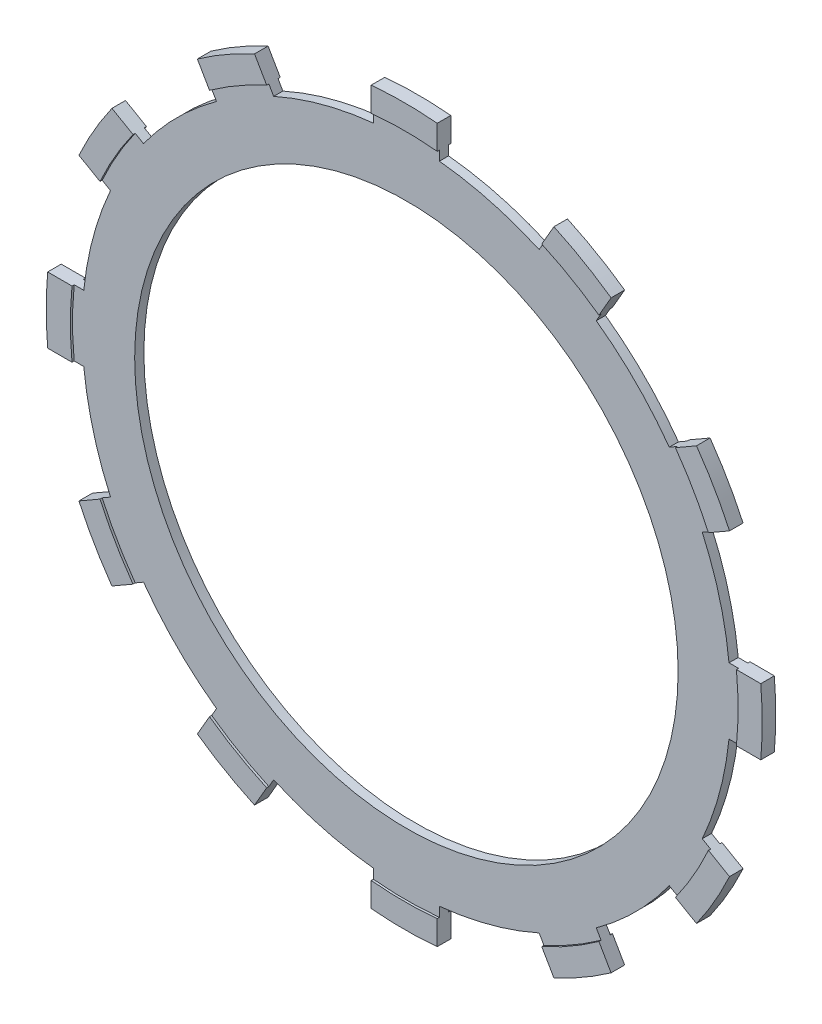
ISO-10303-21;
HEADER;
FILE_DESCRIPTION(('STEP AP214'),'2;1');
FILE_NAME('part.step','',(''),(''),'','','');
FILE_SCHEMA(('AUTOMOTIVE_DESIGN { 1 0 10303 214 1 1 1 1 }'));
ENDSEC;
DATA;
#1=APPLICATION_CONTEXT('core data for automotive mechanical design processes');
#2=APPLICATION_PROTOCOL_DEFINITION('international standard','automotive_design',2000,#1);
#3=PRODUCT_CONTEXT('',#1,'mechanical');
#4=PRODUCT('Part','Part','',(#3));
#5=PRODUCT_RELATED_PRODUCT_CATEGORY('part','',(#4));
#6=PRODUCT_DEFINITION_FORMATION('','',#4);
#7=PRODUCT_DEFINITION_CONTEXT('part definition',#1,'design');
#8=PRODUCT_DEFINITION('design','',#6,#7);
#9=PRODUCT_DEFINITION_SHAPE('','',#8);
#10=(LENGTH_UNIT() NAMED_UNIT(*) SI_UNIT(.MILLI.,.METRE.));
#11=(NAMED_UNIT(*) PLANE_ANGLE_UNIT() SI_UNIT($,.RADIAN.));
#12=(NAMED_UNIT(*) SI_UNIT($,.STERADIAN.) SOLID_ANGLE_UNIT());
#13=UNCERTAINTY_MEASURE_WITH_UNIT(LENGTH_MEASURE(1.E-05),#10,'distance_accuracy_value','');
#14=(GEOMETRIC_REPRESENTATION_CONTEXT(3) GLOBAL_UNCERTAINTY_ASSIGNED_CONTEXT((#13)) GLOBAL_UNIT_ASSIGNED_CONTEXT((#10,
#11,#12)) REPRESENTATION_CONTEXT('',''));
#15=CARTESIAN_POINT('',(0.,0.,0.));
#16=DIRECTION('',(0.,0.,1.));
#17=DIRECTION('',(1.,0.,0.));
#18=AXIS2_PLACEMENT_3D('',#15,#16,#17);
#19=CARTESIAN_POINT('',(0.,0.,1.9));
#20=DIRECTION('',(0.,0.,-1.));
#21=DIRECTION('',(-1.,0.,0.));
#22=AXIS2_PLACEMENT_3D('',#19,#20,#21);
#23=CYLINDRICAL_SURFACE('',#22,66.95);
#24=DIRECTION('',(0.,0.,-1.));
#25=VECTOR('',#24,1.);
#26=CARTESIAN_POINT('',(-39.2030827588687,54.2717311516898,21.9082802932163));
#27=LINE('',#26,#25);
#28=CARTESIAN_POINT('',(-39.2030827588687,54.2717311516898,1.9));
#29=VERTEX_POINT('',#28);
#30=CARTESIAN_POINT('',(-39.2030827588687,54.2717311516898,0.));
#31=VERTEX_POINT('',#30);
#32=EDGE_CURVE('E1231',#29,#31,#27,.T.);
#33=ORIENTED_EDGE('',*,*,#32,.T.);
#34=CARTESIAN_POINT('',(0.,0.,0.));
#35=DIRECTION('',(0.,0.,1.));
#36=DIRECTION('',(1.,0.,0.));
#37=AXIS2_PLACEMENT_3D('',#34,#35,#36);
#38=CIRCLE('',#37,66.95);
#39=CARTESIAN_POINT('',(-54.2717311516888,39.20308275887,0.));
#40=VERTEX_POINT('',#39);
#41=EDGE_CURVE('E1540',#31,#40,#38,.T.);
#42=ORIENTED_EDGE('',*,*,#41,.T.);
#43=DIRECTION('',(0.,0.,-1.));
#44=VECTOR('',#43,1.);
#45=CARTESIAN_POINT('',(-54.2717311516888,39.20308275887,21.9082802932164));
#46=LINE('',#45,#44);
#47=CARTESIAN_POINT('',(-54.2717311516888,39.20308275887,1.9));
#48=VERTEX_POINT('',#47);
#49=EDGE_CURVE('E1245',#48,#40,#46,.T.);
#50=ORIENTED_EDGE('',*,*,#49,.F.);
#51=CARTESIAN_POINT('',(0.,0.,1.9));
#52=DIRECTION('',(0.,0.,1.));
#53=DIRECTION('',(1.,0.,0.));
#54=AXIS2_PLACEMENT_3D('',#51,#52,#53);
#55=CIRCLE('',#54,66.95);
#56=EDGE_CURVE('E253',#29,#48,#55,.T.);
#57=ORIENTED_EDGE('',*,*,#56,.F.);
#58=EDGE_LOOP('',(#33,#42,#50,#57));
#59=FACE_BOUND('',#58,.T.);
#60=ADVANCED_FACE('F244',(#59),#23,.T.);
#61=DIRECTION('',(0.,0.,-1.));
#62=VECTOR('',#61,1.);
#63=CARTESIAN_POINT('',(-27.3991565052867,61.0867311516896,21.9082802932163));
#64=LINE('',#63,#62);
#65=CARTESIAN_POINT('',(-27.3991565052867,61.0867311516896,1.9));
#66=VERTEX_POINT('',#65);
#67=CARTESIAN_POINT('',(-27.3991565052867,61.0867311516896,0.));
#68=VERTEX_POINT('',#67);
#69=EDGE_CURVE('E1229',#66,#68,#64,.T.);
#70=ORIENTED_EDGE('',*,*,#69,.F.);
#71=CARTESIAN_POINT('',(-6.815,66.6022392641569,1.9));
#72=VERTEX_POINT('',#71);
#73=EDGE_CURVE('E13',#72,#66,#55,.T.);
#74=ORIENTED_EDGE('',*,*,#73,.F.);
#75=DIRECTION('',(0.,0.,-1.));
#76=VECTOR('',#75,1.);
#77=CARTESIAN_POINT('',(-6.815,66.6022392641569,17.3725474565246));
#78=LINE('',#77,#76);
#79=CARTESIAN_POINT('',(-6.815,66.6022392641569,0.));
#80=VERTEX_POINT('',#79);
#81=EDGE_CURVE('E1472',#72,#80,#78,.T.);
#82=ORIENTED_EDGE('',*,*,#81,.T.);
#83=EDGE_CURVE('E248',#80,#68,#38,.T.);
#84=ORIENTED_EDGE('',*,*,#83,.T.);
#85=EDGE_LOOP('',(#70,#74,#82,#84));
#86=FACE_BOUND('',#85,.T.);
#87=ADVANCED_FACE('F1509',(#86),#23,.T.);
#88=DIRECTION('',(0.,0.,-1.));
#89=VECTOR('',#88,1.);
#90=CARTESIAN_POINT('',(-61.0867311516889,27.3991565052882,21.9082802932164));
#91=LINE('',#90,#89);
#92=CARTESIAN_POINT('',(-61.0867311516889,27.3991565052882,1.9));
#93=VERTEX_POINT('',#92);
#94=CARTESIAN_POINT('',(-61.0867311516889,27.3991565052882,0.));
#95=VERTEX_POINT('',#94);
#96=EDGE_CURVE('E1248',#93,#95,#91,.T.);
#97=ORIENTED_EDGE('',*,*,#96,.T.);
#98=CARTESIAN_POINT('',(-66.6022392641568,6.8150000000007,0.));
#99=VERTEX_POINT('',#98);
#100=EDGE_CURVE('E1543',#95,#99,#38,.T.);
#101=ORIENTED_EDGE('',*,*,#100,.T.);
#102=DIRECTION('',(0.,0.,-1.));
#103=VECTOR('',#102,1.);
#104=CARTESIAN_POINT('',(-66.6022392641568,6.8150000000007,17.3725474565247));
#105=LINE('',#104,#103);
#106=CARTESIAN_POINT('',(-66.6022392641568,6.8150000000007,1.9));
#107=VERTEX_POINT('',#106);
#108=EDGE_CURVE('E1264',#107,#99,#105,.T.);
#109=ORIENTED_EDGE('',*,*,#108,.F.);
#110=EDGE_CURVE('E1711',#93,#107,#55,.T.);
#111=ORIENTED_EDGE('',*,*,#110,.F.);
#112=EDGE_LOOP('',(#97,#101,#109,#111));
#113=FACE_BOUND('',#112,.T.);
#114=ADVANCED_FACE('F1514',(#113),#23,.T.);
#115=DIRECTION('',(0.,0.,-1.));
#116=VECTOR('',#115,1.);
#117=CARTESIAN_POINT('',(-66.6022392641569,-6.8149999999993,17.3725474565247));
#118=LINE('',#117,#116);
#119=CARTESIAN_POINT('',(-66.6022392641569,-6.8149999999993,1.9));
#120=VERTEX_POINT('',#119);
#121=CARTESIAN_POINT('',(-66.6022392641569,-6.8149999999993,0.));
#122=VERTEX_POINT('',#121);
#123=EDGE_CURVE('E1267',#120,#122,#118,.T.);
#124=ORIENTED_EDGE('',*,*,#123,.T.);
#125=CARTESIAN_POINT('',(-61.0867311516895,-27.3991565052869,0.));
#126=VERTEX_POINT('',#125);
#127=EDGE_CURVE('E1546',#122,#126,#38,.T.);
#128=ORIENTED_EDGE('',*,*,#127,.T.);
#129=DIRECTION('',(0.,0.,-1.));
#130=VECTOR('',#129,1.);
#131=CARTESIAN_POINT('',(-61.0867311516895,-27.3991565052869,21.9082802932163));
#132=LINE('',#131,#130);
#133=CARTESIAN_POINT('',(-61.0867311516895,-27.3991565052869,1.9));
#134=VERTEX_POINT('',#133);
#135=EDGE_CURVE('E1283',#134,#126,#132,.T.);
#136=ORIENTED_EDGE('',*,*,#135,.F.);
#137=EDGE_CURVE('E1746',#120,#134,#55,.T.);
#138=ORIENTED_EDGE('',*,*,#137,.F.);
#139=EDGE_LOOP('',(#124,#128,#136,#138));
#140=FACE_BOUND('',#139,.T.);
#141=ADVANCED_FACE('F1882',(#140),#23,.T.);
#142=DIRECTION('',(0.,0.,-1.));
#143=VECTOR('',#142,1.);
#144=CARTESIAN_POINT('',(-54.2717311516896,-39.2030827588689,21.9082802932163));
#145=LINE('',#144,#143);
#146=CARTESIAN_POINT('',(-54.2717311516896,-39.2030827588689,1.9));
#147=VERTEX_POINT('',#146);
#148=CARTESIAN_POINT('',(-54.2717311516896,-39.2030827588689,0.));
#149=VERTEX_POINT('',#148);
#150=EDGE_CURVE('E1286',#147,#149,#145,.T.);
#151=ORIENTED_EDGE('',*,*,#150,.T.);
#152=CARTESIAN_POINT('',(-39.2030827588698,-54.271731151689,0.));
#153=VERTEX_POINT('',#152);
#154=EDGE_CURVE('E1550',#149,#153,#38,.T.);
#155=ORIENTED_EDGE('',*,*,#154,.T.);
#156=DIRECTION('',(0.,0.,-1.));
#157=VECTOR('',#156,1.);
#158=CARTESIAN_POINT('',(-39.2030827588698,-54.2717311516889,21.9082802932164));
#159=LINE('',#158,#157);
#160=CARTESIAN_POINT('',(-39.2030827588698,-54.271731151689,1.9));
#161=VERTEX_POINT('',#160);
#162=EDGE_CURVE('E1302',#161,#153,#159,.T.);
#163=ORIENTED_EDGE('',*,*,#162,.F.);
#164=EDGE_CURVE('E1747',#147,#161,#55,.T.);
#165=ORIENTED_EDGE('',*,*,#164,.F.);
#166=EDGE_LOOP('',(#151,#155,#163,#165));
#167=FACE_BOUND('',#166,.T.);
#168=ADVANCED_FACE('F1865',(#167),#23,.T.);
#169=DIRECTION('',(0.,0.,-1.));
#170=VECTOR('',#169,1.);
#171=CARTESIAN_POINT('',(-27.399156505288,-61.086731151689,21.9082802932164));
#172=LINE('',#171,#170);
#173=CARTESIAN_POINT('',(-27.399156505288,-61.086731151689,1.9));
#174=VERTEX_POINT('',#173);
#175=CARTESIAN_POINT('',(-27.399156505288,-61.086731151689,0.));
#176=VERTEX_POINT('',#175);
#177=EDGE_CURVE('E1305',#174,#176,#172,.T.);
#178=ORIENTED_EDGE('',*,*,#177,.T.);
#179=CARTESIAN_POINT('',(-6.815,-66.6022392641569,0.));
#180=VERTEX_POINT('',#179);
#181=EDGE_CURVE('E1554',#176,#180,#38,.T.);
#182=ORIENTED_EDGE('',*,*,#181,.T.);
#183=DIRECTION('',(0.,0.,-1.));
#184=VECTOR('',#183,1.);
#185=CARTESIAN_POINT('',(-6.81500000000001,-66.6022392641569,17.3725474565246));
#186=LINE('',#185,#184);
#187=CARTESIAN_POINT('',(-6.815,-66.6022392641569,1.9));
#188=VERTEX_POINT('',#187);
#189=EDGE_CURVE('E1321',#188,#180,#186,.T.);
#190=ORIENTED_EDGE('',*,*,#189,.F.);
#191=EDGE_CURVE('E1749',#174,#188,#55,.T.);
#192=ORIENTED_EDGE('',*,*,#191,.F.);
#193=EDGE_LOOP('',(#178,#182,#190,#192));
#194=FACE_BOUND('',#193,.T.);
#195=ADVANCED_FACE('F1848',(#194),#23,.T.);
#196=DIRECTION('',(0.,0.,-1.));
#197=VECTOR('',#196,1.);
#198=CARTESIAN_POINT('',(6.815,-66.6022392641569,17.3725474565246));
#199=LINE('',#198,#197);
#200=CARTESIAN_POINT('',(6.815,-66.6022392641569,1.9));
#201=VERTEX_POINT('',#200);
#202=CARTESIAN_POINT('',(6.815,-66.6022392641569,0.));
#203=VERTEX_POINT('',#202);
#204=EDGE_CURVE('E1324',#201,#203,#199,.T.);
#205=ORIENTED_EDGE('',*,*,#204,.T.);
#206=CARTESIAN_POINT('',(27.3991565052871,-61.0867311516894,0.));
#207=VERTEX_POINT('',#206);
#208=EDGE_CURVE('E1558',#203,#207,#38,.T.);
#209=ORIENTED_EDGE('',*,*,#208,.T.);
#210=DIRECTION('',(0.,0.,-1.));
#211=VECTOR('',#210,1.);
#212=CARTESIAN_POINT('',(27.3991565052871,-61.0867311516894,21.9082802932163));
#213=LINE('',#212,#211);
#214=CARTESIAN_POINT('',(27.3991565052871,-61.0867311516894,1.9));
#215=VERTEX_POINT('',#214);
#216=EDGE_CURVE('E1340',#215,#207,#213,.T.);
#217=ORIENTED_EDGE('',*,*,#216,.F.);
#218=EDGE_CURVE('E1751',#201,#215,#55,.T.);
#219=ORIENTED_EDGE('',*,*,#218,.F.);
#220=EDGE_LOOP('',(#205,#209,#217,#219));
#221=FACE_BOUND('',#220,.T.);
#222=ADVANCED_FACE('F1831',(#221),#23,.T.);
#223=DIRECTION('',(0.,0.,-1.));
#224=VECTOR('',#223,1.);
#225=CARTESIAN_POINT('',(39.2030827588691,-54.2717311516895,21.9082802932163));
#226=LINE('',#225,#224);
#227=CARTESIAN_POINT('',(39.2030827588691,-54.2717311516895,1.9));
#228=VERTEX_POINT('',#227);
#229=CARTESIAN_POINT('',(39.2030827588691,-54.2717311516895,0.));
#230=VERTEX_POINT('',#229);
#231=EDGE_CURVE('E1343',#228,#230,#226,.T.);
#232=ORIENTED_EDGE('',*,*,#231,.T.);
#233=CARTESIAN_POINT('',(54.2717311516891,-39.2030827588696,0.));
#234=VERTEX_POINT('',#233);
#235=EDGE_CURVE('E1562',#230,#234,#38,.T.);
#236=ORIENTED_EDGE('',*,*,#235,.T.);
#237=DIRECTION('',(0.,0.,-1.));
#238=VECTOR('',#237,1.);
#239=CARTESIAN_POINT('',(54.2717311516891,-39.2030827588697,21.9082802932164));
#240=LINE('',#239,#238);
#241=CARTESIAN_POINT('',(54.2717311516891,-39.2030827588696,1.9));
#242=VERTEX_POINT('',#241);
#243=EDGE_CURVE('E1359',#242,#234,#240,.T.);
#244=ORIENTED_EDGE('',*,*,#243,.F.);
#245=EDGE_CURVE('E1614',#228,#242,#55,.T.);
#246=ORIENTED_EDGE('',*,*,#245,.F.);
#247=EDGE_LOOP('',(#232,#236,#244,#246));
#248=FACE_BOUND('',#247,.T.);
#249=ADVANCED_FACE('F1759',(#248),#23,.T.);
#250=DIRECTION('',(0.,0.,-1.));
#251=VECTOR('',#250,1.);
#252=CARTESIAN_POINT('',(61.0867311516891,-27.3991565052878,21.9082802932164));
#253=LINE('',#252,#251);
#254=CARTESIAN_POINT('',(61.0867311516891,-27.3991565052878,1.9));
#255=VERTEX_POINT('',#254);
#256=CARTESIAN_POINT('',(61.0867311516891,-27.3991565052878,0.));
#257=VERTEX_POINT('',#256);
#258=EDGE_CURVE('E1362',#255,#257,#253,.T.);
#259=ORIENTED_EDGE('',*,*,#258,.T.);
#260=CARTESIAN_POINT('',(66.6022392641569,-6.81500000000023,0.));
#261=VERTEX_POINT('',#260);
#262=EDGE_CURVE('E1566',#257,#261,#38,.T.);
#263=ORIENTED_EDGE('',*,*,#262,.T.);
#264=DIRECTION('',(0.,0.,-1.));
#265=VECTOR('',#264,1.);
#266=CARTESIAN_POINT('',(66.6022392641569,-6.81500000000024,17.3725474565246));
#267=LINE('',#266,#265);
#268=CARTESIAN_POINT('',(66.6022392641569,-6.81500000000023,1.9));
#269=VERTEX_POINT('',#268);
#270=EDGE_CURVE('E1378',#269,#261,#267,.T.);
#271=ORIENTED_EDGE('',*,*,#270,.F.);
#272=EDGE_CURVE('E1613',#255,#269,#55,.T.);
#273=ORIENTED_EDGE('',*,*,#272,.F.);
#274=EDGE_LOOP('',(#259,#263,#271,#273));
#275=FACE_BOUND('',#274,.T.);
#276=ADVANCED_FACE('F1778',(#275),#23,.T.);
#277=DIRECTION('',(0.,0.,-1.));
#278=VECTOR('',#277,1.);
#279=CARTESIAN_POINT('',(66.6022392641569,6.81499999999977,17.3725474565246));
#280=LINE('',#279,#278);
#281=CARTESIAN_POINT('',(66.6022392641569,6.81499999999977,1.9));
#282=VERTEX_POINT('',#281);
#283=CARTESIAN_POINT('',(66.6022392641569,6.81499999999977,0.));
#284=VERTEX_POINT('',#283);
#285=EDGE_CURVE('E1381',#282,#284,#280,.T.);
#286=ORIENTED_EDGE('',*,*,#285,.T.);
#287=CARTESIAN_POINT('',(61.0867311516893,27.3991565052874,0.));
#288=VERTEX_POINT('',#287);
#289=EDGE_CURVE('E1539',#284,#288,#38,.T.);
#290=ORIENTED_EDGE('',*,*,#289,.T.);
#291=DIRECTION('',(0.,0.,-1.));
#292=VECTOR('',#291,1.);
#293=CARTESIAN_POINT('',(61.0867311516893,27.3991565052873,21.9082802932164));
#294=LINE('',#293,#292);
#295=CARTESIAN_POINT('',(61.0867311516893,27.3991565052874,1.9));
#296=VERTEX_POINT('',#295);
#297=EDGE_CURVE('E1397',#296,#288,#294,.T.);
#298=ORIENTED_EDGE('',*,*,#297,.F.);
#299=EDGE_CURVE('E1611',#282,#296,#55,.T.);
#300=ORIENTED_EDGE('',*,*,#299,.F.);
#301=EDGE_LOOP('',(#286,#290,#298,#300));
#302=FACE_BOUND('',#301,.T.);
#303=ADVANCED_FACE('F1523',(#302),#23,.T.);
#304=DIRECTION('',(0.,0.,-1.));
#305=VECTOR('',#304,1.);
#306=CARTESIAN_POINT('',(54.2717311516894,39.2030827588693,21.9082802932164));
#307=LINE('',#306,#305);
#308=CARTESIAN_POINT('',(54.2717311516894,39.2030827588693,1.9));
#309=VERTEX_POINT('',#308);
#310=CARTESIAN_POINT('',(54.2717311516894,39.2030827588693,0.));
#311=VERTEX_POINT('',#310);
#312=EDGE_CURVE('E1400',#309,#311,#307,.T.);
#313=ORIENTED_EDGE('',*,*,#312,.T.);
#314=CARTESIAN_POINT('',(39.2030827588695,54.2717311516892,0.));
#315=VERTEX_POINT('',#314);
#316=EDGE_CURVE('E1538',#311,#315,#38,.T.);
#317=ORIENTED_EDGE('',*,*,#316,.T.);
#318=DIRECTION('',(0.,0.,-1.));
#319=VECTOR('',#318,1.);
#320=CARTESIAN_POINT('',(39.2030827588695,54.2717311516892,21.9082802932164));
#321=LINE('',#320,#319);
#322=CARTESIAN_POINT('',(39.2030827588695,54.2717311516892,1.9));
#323=VERTEX_POINT('',#322);
#324=EDGE_CURVE('E1416',#323,#315,#321,.T.);
#325=ORIENTED_EDGE('',*,*,#324,.F.);
#326=EDGE_CURVE('E1542',#309,#323,#55,.T.);
#327=ORIENTED_EDGE('',*,*,#326,.F.);
#328=EDGE_LOOP('',(#313,#317,#325,#327));
#329=FACE_BOUND('',#328,.T.);
#330=ADVANCED_FACE('F1517',(#329),#23,.T.);
#331=DIRECTION('',(0.,0.,-1.));
#332=VECTOR('',#331,1.);
#333=CARTESIAN_POINT('',(27.3991565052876,61.0867311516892,21.9082802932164));
#334=LINE('',#333,#332);
#335=CARTESIAN_POINT('',(27.3991565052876,61.0867311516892,1.9));
#336=VERTEX_POINT('',#335);
#337=CARTESIAN_POINT('',(27.3991565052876,61.0867311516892,0.));
#338=VERTEX_POINT('',#337);
#339=EDGE_CURVE('E1419',#336,#338,#334,.T.);
#340=ORIENTED_EDGE('',*,*,#339,.T.);
#341=CARTESIAN_POINT('',(6.81500000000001,66.6022392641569,0.));
#342=VERTEX_POINT('',#341);
#343=EDGE_CURVE('E1487',#338,#342,#38,.T.);
#344=ORIENTED_EDGE('',*,*,#343,.T.);
#345=DIRECTION('',(0.,0.,-1.));
#346=VECTOR('',#345,1.);
#347=CARTESIAN_POINT('',(6.81500000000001,66.6022392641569,17.3725474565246));
#348=LINE('',#347,#346);
#349=CARTESIAN_POINT('',(6.81500000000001,66.6022392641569,1.9));
#350=VERTEX_POINT('',#349);
#351=EDGE_CURVE('E1469',#350,#342,#348,.T.);
#352=ORIENTED_EDGE('',*,*,#351,.F.);
#353=EDGE_CURVE('E254',#336,#350,#55,.T.);
#354=ORIENTED_EDGE('',*,*,#353,.F.);
#355=EDGE_LOOP('',(#340,#344,#352,#354));
#356=FACE_BOUND('',#355,.T.);
#357=ADVANCED_FACE('F246',(#356),#23,.T.);
#358=CARTESIAN_POINT('',(0.,0.,1.9));
#359=DIRECTION('',(0.,0.,1.));
#360=DIRECTION('',(1.,0.,0.));
#361=AXIS2_PLACEMENT_3D('',#358,#359,#360);
#362=PLANE('',#361);
#363=CARTESIAN_POINT('',(0.,0.,1.9));
#364=DIRECTION('',(0.,0.,1.));
#365=DIRECTION('',(1.,0.,0.));
#366=AXIS2_PLACEMENT_3D('',#363,#364,#365);
#367=CIRCLE('',#366,68.925);
#368=CARTESIAN_POINT('',(-40.1955900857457,55.9908042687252,1.89999999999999));
#369=VERTEX_POINT('',#368);
#370=CARTESIAN_POINT('',(-28.3916638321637,62.8058042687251,1.9));
#371=VERTEX_POINT('',#370);
#372=EDGE_CURVE('E884',#369,#371,#367,.F.);
#373=ORIENTED_EDGE('',*,*,#372,.F.);
#374=DIRECTION('',(0.499999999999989,-0.866025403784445,0.));
#375=VECTOR('',#374,1.);
#376=CARTESIAN_POINT('',(-39.2030827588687,54.2717311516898,1.9));
#377=LINE('',#376,#375);
#378=EDGE_CURVE('E1232',#369,#29,#377,.T.);
#379=ORIENTED_EDGE('',*,*,#378,.T.);
#380=ORIENTED_EDGE('',*,*,#56,.T.);
#381=DIRECTION('',(-0.866025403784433,0.50000000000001,0.));
#382=VECTOR('',#381,1.);
#383=CARTESIAN_POINT('',(-54.2717311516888,39.20308275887,1.9));
#384=LINE('',#383,#382);
#385=CARTESIAN_POINT('',(-55.9908042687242,40.1955900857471,1.9));
#386=VERTEX_POINT('',#385);
#387=EDGE_CURVE('E1244',#48,#386,#384,.T.);
#388=ORIENTED_EDGE('',*,*,#387,.T.);
#389=CARTESIAN_POINT('',(0.,0.,1.9));
#390=DIRECTION('',(0.,0.,1.));
#391=DIRECTION('',(1.,0.,0.));
#392=AXIS2_PLACEMENT_3D('',#389,#390,#391);
#393=CIRCLE('',#392,68.925);
#394=CARTESIAN_POINT('',(-62.8058042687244,28.3916638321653,1.9));
#395=VERTEX_POINT('',#394);
#396=EDGE_CURVE('E917',#395,#386,#393,.F.);
#397=ORIENTED_EDGE('',*,*,#396,.F.);
#398=DIRECTION('',(0.866025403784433,-0.50000000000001,0.));
#399=VECTOR('',#398,1.);
#400=CARTESIAN_POINT('',(-61.0867311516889,27.3991565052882,1.9));
#401=LINE('',#400,#399);
#402=EDGE_CURVE('E1250',#395,#93,#401,.T.);
#403=ORIENTED_EDGE('',*,*,#402,.T.);
#404=ORIENTED_EDGE('',*,*,#110,.T.);
#405=DIRECTION('',(-1.,0.,0.));
#406=VECTOR('',#405,1.);
#407=CARTESIAN_POINT('',(-66.6022392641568,6.8150000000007,1.9));
#408=LINE('',#407,#406);
#409=CARTESIAN_POINT('',(-68.5872539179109,6.81500000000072,1.9));
#410=VERTEX_POINT('',#409);
#411=EDGE_CURVE('E1263',#107,#410,#408,.T.);
#412=ORIENTED_EDGE('',*,*,#411,.T.);
#413=CARTESIAN_POINT('',(0.,0.,1.9));
#414=DIRECTION('',(0.,0.,1.));
#415=DIRECTION('',(1.,0.,0.));
#416=AXIS2_PLACEMENT_3D('',#413,#414,#415);
#417=CIRCLE('',#416,68.925);
#418=CARTESIAN_POINT('',(-68.5872539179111,-6.81499999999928,1.9));
#419=VERTEX_POINT('',#418);
#420=EDGE_CURVE('E951',#419,#410,#417,.F.);
#421=ORIENTED_EDGE('',*,*,#420,.F.);
#422=DIRECTION('',(1.,0.,0.));
#423=VECTOR('',#422,1.);
#424=CARTESIAN_POINT('',(-66.6022392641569,-6.8149999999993,1.9));
#425=LINE('',#424,#423);
#426=EDGE_CURVE('E1269',#419,#120,#425,.T.);
#427=ORIENTED_EDGE('',*,*,#426,.T.);
#428=ORIENTED_EDGE('',*,*,#137,.T.);
#429=DIRECTION('',(-0.866025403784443,-0.499999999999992,0.));
#430=VECTOR('',#429,1.);
#431=CARTESIAN_POINT('',(-61.0867311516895,-27.3991565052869,1.9));
#432=LINE('',#431,#430);
#433=CARTESIAN_POINT('',(-62.805804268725,-28.391663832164,1.9));
#434=VERTEX_POINT('',#433);
#435=EDGE_CURVE('E1282',#134,#434,#432,.T.);
#436=ORIENTED_EDGE('',*,*,#435,.T.);
#437=CARTESIAN_POINT('',(0.,0.,1.9));
#438=DIRECTION('',(0.,0.,1.));
#439=DIRECTION('',(1.,0.,0.));
#440=AXIS2_PLACEMENT_3D('',#437,#438,#439);
#441=CIRCLE('',#440,68.925);
#442=CARTESIAN_POINT('',(-55.9908042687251,-40.1955900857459,1.9));
#443=VERTEX_POINT('',#442);
#444=EDGE_CURVE('E985',#443,#434,#441,.F.);
#445=ORIENTED_EDGE('',*,*,#444,.F.);
#446=DIRECTION('',(0.866025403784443,0.499999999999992,0.));
#447=VECTOR('',#446,1.);
#448=CARTESIAN_POINT('',(-54.2717311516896,-39.2030827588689,1.9));
#449=LINE('',#448,#447);
#450=EDGE_CURVE('E1288',#443,#147,#449,.T.);
#451=ORIENTED_EDGE('',*,*,#450,.T.);
#452=ORIENTED_EDGE('',*,*,#164,.T.);
#453=DIRECTION('',(-0.500000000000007,-0.866025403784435,0.));
#454=VECTOR('',#453,1.);
#455=CARTESIAN_POINT('',(-39.2030827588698,-54.2717311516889,1.9));
#456=LINE('',#455,#454);
#457=CARTESIAN_POINT('',(-40.1955900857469,-55.9908042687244,1.9));
#458=VERTEX_POINT('',#457);
#459=EDGE_CURVE('E1301',#161,#458,#456,.T.);
#460=ORIENTED_EDGE('',*,*,#459,.T.);
#461=CARTESIAN_POINT('',(0.,0.,1.9));
#462=DIRECTION('',(0.,0.,1.));
#463=DIRECTION('',(1.,0.,0.));
#464=AXIS2_PLACEMENT_3D('',#461,#462,#463);
#465=CIRCLE('',#464,68.925);
#466=CARTESIAN_POINT('',(-28.3916638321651,-62.8058042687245,1.9));
#467=VERTEX_POINT('',#466);
#468=EDGE_CURVE('E1019',#467,#458,#465,.F.);
#469=ORIENTED_EDGE('',*,*,#468,.F.);
#470=DIRECTION('',(0.500000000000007,0.866025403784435,0.));
#471=VECTOR('',#470,1.);
#472=CARTESIAN_POINT('',(-27.399156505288,-61.086731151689,1.9));
#473=LINE('',#472,#471);
#474=EDGE_CURVE('E1307',#467,#174,#473,.T.);
#475=ORIENTED_EDGE('',*,*,#474,.T.);
#476=ORIENTED_EDGE('',*,*,#191,.T.);
#477=DIRECTION('',(0.,-1.,0.));
#478=VECTOR('',#477,1.);
#479=CARTESIAN_POINT('',(-6.815,-66.6022392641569,1.9));
#480=LINE('',#479,#478);
#481=CARTESIAN_POINT('',(-6.815,-68.587253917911,1.9));
#482=VERTEX_POINT('',#481);
#483=EDGE_CURVE('E1320',#188,#482,#480,.T.);
#484=ORIENTED_EDGE('',*,*,#483,.T.);
#485=CARTESIAN_POINT('',(0.,0.,1.9));
#486=DIRECTION('',(0.,0.,1.));
#487=DIRECTION('',(1.,0.,0.));
#488=AXIS2_PLACEMENT_3D('',#485,#486,#487);
#489=CIRCLE('',#488,68.925);
#490=CARTESIAN_POINT('',(6.815,-68.587253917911,1.9));
#491=VERTEX_POINT('',#490);
#492=EDGE_CURVE('E1053',#491,#482,#489,.F.);
#493=ORIENTED_EDGE('',*,*,#492,.F.);
#494=DIRECTION('',(0.,1.,0.));
#495=VECTOR('',#494,1.);
#496=CARTESIAN_POINT('',(6.815,-66.6022392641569,1.9));
#497=LINE('',#496,#495);
#498=EDGE_CURVE('E1326',#491,#201,#497,.T.);
#499=ORIENTED_EDGE('',*,*,#498,.T.);
#500=ORIENTED_EDGE('',*,*,#218,.T.);
#501=DIRECTION('',(0.499999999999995,-0.866025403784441,0.));
#502=VECTOR('',#501,1.);
#503=CARTESIAN_POINT('',(27.3991565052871,-61.0867311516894,1.9));
#504=LINE('',#503,#502);
#505=CARTESIAN_POINT('',(28.3916638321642,-62.8058042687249,1.9));
#506=VERTEX_POINT('',#505);
#507=EDGE_CURVE('E1339',#215,#506,#504,.T.);
#508=ORIENTED_EDGE('',*,*,#507,.T.);
#509=CARTESIAN_POINT('',(0.,0.,1.9));
#510=DIRECTION('',(0.,0.,1.));
#511=DIRECTION('',(1.,0.,0.));
#512=AXIS2_PLACEMENT_3D('',#509,#510,#511);
#513=CIRCLE('',#512,68.925);
#514=CARTESIAN_POINT('',(40.1955900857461,-55.9908042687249,1.9));
#515=VERTEX_POINT('',#514);
#516=EDGE_CURVE('E1087',#515,#506,#513,.F.);
#517=ORIENTED_EDGE('',*,*,#516,.F.);
#518=DIRECTION('',(-0.499999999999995,0.866025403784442,0.));
#519=VECTOR('',#518,1.);
#520=CARTESIAN_POINT('',(39.2030827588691,-54.2717311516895,1.9));
#521=LINE('',#520,#519);
#522=EDGE_CURVE('E1345',#515,#228,#521,.T.);
#523=ORIENTED_EDGE('',*,*,#522,.T.);
#524=ORIENTED_EDGE('',*,*,#245,.T.);
#525=DIRECTION('',(0.866025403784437,-0.500000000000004,0.));
#526=VECTOR('',#525,1.);
#527=CARTESIAN_POINT('',(54.2717311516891,-39.2030827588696,1.9));
#528=LINE('',#527,#526);
#529=CARTESIAN_POINT('',(55.9908042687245,-40.1955900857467,1.9));
#530=VERTEX_POINT('',#529);
#531=EDGE_CURVE('E1358',#242,#530,#528,.T.);
#532=ORIENTED_EDGE('',*,*,#531,.T.);
#533=CARTESIAN_POINT('',(0.,0.,1.9));
#534=DIRECTION('',(0.,0.,1.));
#535=DIRECTION('',(1.,0.,0.));
#536=AXIS2_PLACEMENT_3D('',#533,#534,#535);
#537=CIRCLE('',#536,68.925);
#538=CARTESIAN_POINT('',(62.8058042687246,-28.3916638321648,1.9));
#539=VERTEX_POINT('',#538);
#540=EDGE_CURVE('E1121',#539,#530,#537,.F.);
#541=ORIENTED_EDGE('',*,*,#540,.F.);
#542=DIRECTION('',(-0.866025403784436,0.500000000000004,0.));
#543=VECTOR('',#542,1.);
#544=CARTESIAN_POINT('',(61.0867311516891,-27.3991565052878,1.9));
#545=LINE('',#544,#543);
#546=EDGE_CURVE('E1364',#539,#255,#545,.T.);
#547=ORIENTED_EDGE('',*,*,#546,.T.);
#548=ORIENTED_EDGE('',*,*,#272,.T.);
#549=DIRECTION('',(1.,0.,0.));
#550=VECTOR('',#549,1.);
#551=CARTESIAN_POINT('',(66.6022392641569,-6.81500000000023,1.9));
#552=LINE('',#551,#550);
#553=CARTESIAN_POINT('',(68.587253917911,-6.81500000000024,1.9));
#554=VERTEX_POINT('',#553);
#555=EDGE_CURVE('E1377',#269,#554,#552,.T.);
#556=ORIENTED_EDGE('',*,*,#555,.T.);
#557=CARTESIAN_POINT('',(0.,0.,1.9));
#558=DIRECTION('',(0.,0.,1.));
#559=DIRECTION('',(1.,0.,0.));
#560=AXIS2_PLACEMENT_3D('',#557,#558,#559);
#561=CIRCLE('',#560,68.925);
#562=CARTESIAN_POINT('',(68.587253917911,6.81499999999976,1.9));
#563=VERTEX_POINT('',#562);
#564=EDGE_CURVE('E1155',#563,#554,#561,.F.);
#565=ORIENTED_EDGE('',*,*,#564,.F.);
#566=DIRECTION('',(-1.,0.,0.));
#567=VECTOR('',#566,1.);
#568=CARTESIAN_POINT('',(66.6022392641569,6.81499999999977,1.9));
#569=LINE('',#568,#567);
#570=EDGE_CURVE('E1383',#563,#282,#569,.T.);
#571=ORIENTED_EDGE('',*,*,#570,.T.);
#572=ORIENTED_EDGE('',*,*,#299,.T.);
#573=DIRECTION('',(0.86602540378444,0.499999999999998,0.));
#574=VECTOR('',#573,1.);
#575=CARTESIAN_POINT('',(61.0867311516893,27.3991565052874,1.9));
#576=LINE('',#575,#574);
#577=CARTESIAN_POINT('',(62.8058042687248,28.3916638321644,1.9));
#578=VERTEX_POINT('',#577);
#579=EDGE_CURVE('E1396',#296,#578,#576,.T.);
#580=ORIENTED_EDGE('',*,*,#579,.T.);
#581=CARTESIAN_POINT('',(0.,0.,1.9));
#582=DIRECTION('',(0.,0.,1.));
#583=DIRECTION('',(1.,0.,0.));
#584=AXIS2_PLACEMENT_3D('',#581,#582,#583);
#585=CIRCLE('',#584,68.925);
#586=CARTESIAN_POINT('',(55.9908042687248,40.1955900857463,1.90000000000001));
#587=VERTEX_POINT('',#586);
#588=EDGE_CURVE('E1189',#587,#578,#585,.F.);
#589=ORIENTED_EDGE('',*,*,#588,.F.);
#590=DIRECTION('',(-0.86602540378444,-0.499999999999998,0.));
#591=VECTOR('',#590,1.);
#592=CARTESIAN_POINT('',(54.2717311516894,39.2030827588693,1.9));
#593=LINE('',#592,#591);
#594=EDGE_CURVE('E1402',#587,#309,#593,.T.);
#595=ORIENTED_EDGE('',*,*,#594,.T.);
#596=ORIENTED_EDGE('',*,*,#326,.T.);
#597=DIRECTION('',(0.500000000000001,0.866025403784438,0.));
#598=VECTOR('',#597,1.);
#599=CARTESIAN_POINT('',(39.2030827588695,54.2717311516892,1.9));
#600=LINE('',#599,#598);
#601=CARTESIAN_POINT('',(40.1955900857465,55.9908042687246,1.9));
#602=VERTEX_POINT('',#601);
#603=EDGE_CURVE('E1415',#323,#602,#600,.T.);
#604=ORIENTED_EDGE('',*,*,#603,.T.);
#605=CARTESIAN_POINT('',(0.,0.,1.9));
#606=DIRECTION('',(0.,0.,1.));
#607=DIRECTION('',(1.,0.,0.));
#608=AXIS2_PLACEMENT_3D('',#605,#606,#607);
#609=CIRCLE('',#608,68.925);
#610=CARTESIAN_POINT('',(28.3916638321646,62.8058042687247,1.90000000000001));
#611=VERTEX_POINT('',#610);
#612=EDGE_CURVE('E1223',#611,#602,#609,.F.);
#613=ORIENTED_EDGE('',*,*,#612,.F.);
#614=DIRECTION('',(-0.500000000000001,-0.866025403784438,0.));
#615=VECTOR('',#614,1.);
#616=CARTESIAN_POINT('',(27.3991565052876,61.0867311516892,1.9));
#617=LINE('',#616,#615);
#618=EDGE_CURVE('E1421',#611,#336,#617,.T.);
#619=ORIENTED_EDGE('',*,*,#618,.T.);
#620=ORIENTED_EDGE('',*,*,#353,.T.);
#621=DIRECTION('',(0.,1.,0.));
#622=VECTOR('',#621,1.);
#623=CARTESIAN_POINT('',(6.815,66.6022392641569,1.9));
#624=LINE('',#623,#622);
#625=CARTESIAN_POINT('',(6.815,68.587253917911,1.9));
#626=VERTEX_POINT('',#625);
#627=EDGE_CURVE('E1468',#350,#626,#624,.T.);
#628=ORIENTED_EDGE('',*,*,#627,.T.);
#629=CARTESIAN_POINT('',(0.,0.,1.9));
#630=DIRECTION('',(0.,0.,1.));
#631=DIRECTION('',(1.,0.,0.));
#632=AXIS2_PLACEMENT_3D('',#629,#630,#631);
#633=CIRCLE('',#632,68.925);
#634=CARTESIAN_POINT('',(-6.815,68.587253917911,1.9));
#635=VERTEX_POINT('',#634);
#636=EDGE_CURVE('E1461',#635,#626,#633,.F.);
#637=ORIENTED_EDGE('',*,*,#636,.F.);
#638=DIRECTION('',(0.,-1.,0.));
#639=VECTOR('',#638,1.);
#640=CARTESIAN_POINT('',(-6.815,66.6022392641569,1.9));
#641=LINE('',#640,#639);
#642=EDGE_CURVE('E1474',#635,#72,#641,.T.);
#643=ORIENTED_EDGE('',*,*,#642,.T.);
#644=ORIENTED_EDGE('',*,*,#73,.T.);
#645=DIRECTION('',(-0.499999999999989,0.866025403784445,0.));
#646=VECTOR('',#645,1.);
#647=CARTESIAN_POINT('',(-27.3991565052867,61.0867311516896,1.9));
#648=LINE('',#647,#646);
#649=EDGE_CURVE('E268',#66,#371,#648,.T.);
#650=ORIENTED_EDGE('',*,*,#649,.T.);
#651=EDGE_LOOP('',(#373,#379,#380,#388,#397,#403,#404,#412,#421,#427,#428,#436,#445,#451,#452,
#460,#469,#475,#476,#484,#493,#499,#500,#508,#517,#523,#524,#532,#541,#547,#548,#556,#565,#571,
#572,#580,#589,#595,#596,#604,#613,#619,#620,#628,#637,#643,#644,#650));
#652=FACE_BOUND('',#651,.T.);
#653=CARTESIAN_POINT('',(0.,0.,1.9));
#654=DIRECTION('',(0.,0.,1.));
#655=DIRECTION('',(1.,0.,0.));
#656=AXIS2_PLACEMENT_3D('',#653,#654,#655);
#657=CIRCLE('',#656,56.1);
#658=CARTESIAN_POINT('',(-56.1,0.,1.9));
#659=VERTEX_POINT('',#658);
#660=EDGE_CURVE('E1484',#659,#659,#657,.T.);
#661=ORIENTED_EDGE('',*,*,#660,.F.);
#662=EDGE_LOOP('',(#661));
#663=FACE_BOUND('',#662,.T.);
#664=ADVANCED_FACE('F1505',(#652,#663),#362,.T.);
#665=CARTESIAN_POINT('',(0.,0.,0.));
#666=DIRECTION('',(0.,0.,1.));
#667=DIRECTION('',(1.,0.,0.));
#668=AXIS2_PLACEMENT_3D('',#665,#666,#667);
#669=PLANE('',#668);
#670=DIRECTION('',(0.499999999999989,-0.866025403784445,0.));
#671=VECTOR('',#670,1.);
#672=CARTESIAN_POINT('',(-39.2030827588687,54.2717311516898,0.));
#673=LINE('',#672,#671);
#674=CARTESIAN_POINT('',(-40.1955900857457,55.9908042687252,0.));
#675=VERTEX_POINT('',#674);
#676=EDGE_CURVE('E849',#675,#31,#673,.T.);
#677=ORIENTED_EDGE('',*,*,#676,.F.);
#678=CARTESIAN_POINT('',(0.,0.,0.));
#679=DIRECTION('',(0.,0.,1.));
#680=DIRECTION('',(1.,0.,0.));
#681=AXIS2_PLACEMENT_3D('',#678,#679,#680);
#682=CIRCLE('',#681,68.925);
#683=CARTESIAN_POINT('',(-28.3916638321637,62.8058042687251,0.));
#684=VERTEX_POINT('',#683);
#685=EDGE_CURVE('E881',#675,#684,#682,.F.);
#686=ORIENTED_EDGE('',*,*,#685,.T.);
#687=DIRECTION('',(-0.499999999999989,0.866025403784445,0.));
#688=VECTOR('',#687,1.);
#689=CARTESIAN_POINT('',(-27.3991565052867,61.0867311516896,0.));
#690=LINE('',#689,#688);
#691=EDGE_CURVE('E1226',#68,#684,#690,.T.);
#692=ORIENTED_EDGE('',*,*,#691,.F.);
#693=ORIENTED_EDGE('',*,*,#83,.F.);
#694=DIRECTION('',(0.,-1.,0.));
#695=VECTOR('',#694,1.);
#696=CARTESIAN_POINT('',(-6.815,66.6022392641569,0.));
#697=LINE('',#696,#695);
#698=CARTESIAN_POINT('',(-6.815,68.587253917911,0.));
#699=VERTEX_POINT('',#698);
#700=EDGE_CURVE('E1470',#699,#80,#697,.T.);
#701=ORIENTED_EDGE('',*,*,#700,.F.);
#702=CARTESIAN_POINT('',(0.,0.,0.));
#703=DIRECTION('',(0.,0.,1.));
#704=DIRECTION('',(1.,0.,0.));
#705=AXIS2_PLACEMENT_3D('',#702,#703,#704);
#706=CIRCLE('',#705,68.925);
#707=CARTESIAN_POINT('',(6.815,68.587253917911,0.));
#708=VERTEX_POINT('',#707);
#709=EDGE_CURVE('E1458',#699,#708,#706,.F.);
#710=ORIENTED_EDGE('',*,*,#709,.T.);
#711=DIRECTION('',(0.,1.,0.));
#712=VECTOR('',#711,1.);
#713=CARTESIAN_POINT('',(6.815,66.6022392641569,0.));
#714=LINE('',#713,#712);
#715=EDGE_CURVE('E1465',#342,#708,#714,.T.);
#716=ORIENTED_EDGE('',*,*,#715,.F.);
#717=ORIENTED_EDGE('',*,*,#343,.F.);
#718=DIRECTION('',(-0.500000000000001,-0.866025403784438,0.));
#719=VECTOR('',#718,1.);
#720=CARTESIAN_POINT('',(27.3991565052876,61.0867311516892,0.));
#721=LINE('',#720,#719);
#722=CARTESIAN_POINT('',(28.3916638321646,62.8058042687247,0.));
#723=VERTEX_POINT('',#722);
#724=EDGE_CURVE('E1417',#723,#338,#721,.T.);
#725=ORIENTED_EDGE('',*,*,#724,.F.);
#726=CARTESIAN_POINT('',(0.,0.,0.));
#727=DIRECTION('',(0.,0.,1.));
#728=DIRECTION('',(1.,0.,0.));
#729=AXIS2_PLACEMENT_3D('',#726,#727,#728);
#730=CIRCLE('',#729,68.925);
#731=CARTESIAN_POINT('',(40.1955900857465,55.9908042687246,0.));
#732=VERTEX_POINT('',#731);
#733=EDGE_CURVE('E1220',#723,#732,#730,.F.);
#734=ORIENTED_EDGE('',*,*,#733,.T.);
#735=DIRECTION('',(0.500000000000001,0.866025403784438,0.));
#736=VECTOR('',#735,1.);
#737=CARTESIAN_POINT('',(39.2030827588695,54.2717311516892,0.));
#738=LINE('',#737,#736);
#739=EDGE_CURVE('E1412',#315,#732,#738,.T.);
#740=ORIENTED_EDGE('',*,*,#739,.F.);
#741=ORIENTED_EDGE('',*,*,#316,.F.);
#742=DIRECTION('',(-0.86602540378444,-0.499999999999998,0.));
#743=VECTOR('',#742,1.);
#744=CARTESIAN_POINT('',(54.2717311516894,39.2030827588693,0.));
#745=LINE('',#744,#743);
#746=CARTESIAN_POINT('',(55.9908042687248,40.1955900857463,0.));
#747=VERTEX_POINT('',#746);
#748=EDGE_CURVE('E1398',#747,#311,#745,.T.);
#749=ORIENTED_EDGE('',*,*,#748,.F.);
#750=CARTESIAN_POINT('',(0.,0.,0.));
#751=DIRECTION('',(0.,0.,1.));
#752=DIRECTION('',(1.,0.,0.));
#753=AXIS2_PLACEMENT_3D('',#750,#751,#752);
#754=CIRCLE('',#753,68.925);
#755=CARTESIAN_POINT('',(62.8058042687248,28.3916638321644,0.));
#756=VERTEX_POINT('',#755);
#757=EDGE_CURVE('E1186',#747,#756,#754,.F.);
#758=ORIENTED_EDGE('',*,*,#757,.T.);
#759=DIRECTION('',(0.86602540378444,0.499999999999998,0.));
#760=VECTOR('',#759,1.);
#761=CARTESIAN_POINT('',(61.0867311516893,27.3991565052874,0.));
#762=LINE('',#761,#760);
#763=EDGE_CURVE('E1393',#288,#756,#762,.T.);
#764=ORIENTED_EDGE('',*,*,#763,.F.);
#765=ORIENTED_EDGE('',*,*,#289,.F.);
#766=DIRECTION('',(-1.,0.,0.));
#767=VECTOR('',#766,1.);
#768=CARTESIAN_POINT('',(66.6022392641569,6.81499999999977,0.));
#769=LINE('',#768,#767);
#770=CARTESIAN_POINT('',(68.587253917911,6.81499999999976,0.));
#771=VERTEX_POINT('',#770);
#772=EDGE_CURVE('E1379',#771,#284,#769,.T.);
#773=ORIENTED_EDGE('',*,*,#772,.F.);
#774=CARTESIAN_POINT('',(0.,0.,0.));
#775=DIRECTION('',(0.,0.,1.));
#776=DIRECTION('',(1.,0.,0.));
#777=AXIS2_PLACEMENT_3D('',#774,#775,#776);
#778=CIRCLE('',#777,68.925);
#779=CARTESIAN_POINT('',(68.587253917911,-6.81500000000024,0.));
#780=VERTEX_POINT('',#779);
#781=EDGE_CURVE('E1152',#771,#780,#778,.F.);
#782=ORIENTED_EDGE('',*,*,#781,.T.);
#783=DIRECTION('',(1.,0.,0.));
#784=VECTOR('',#783,1.);
#785=CARTESIAN_POINT('',(66.6022392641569,-6.81500000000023,0.));
#786=LINE('',#785,#784);
#787=EDGE_CURVE('E1374',#261,#780,#786,.T.);
#788=ORIENTED_EDGE('',*,*,#787,.F.);
#789=ORIENTED_EDGE('',*,*,#262,.F.);
#790=DIRECTION('',(-0.866025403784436,0.500000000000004,0.));
#791=VECTOR('',#790,1.);
#792=CARTESIAN_POINT('',(61.0867311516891,-27.3991565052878,0.));
#793=LINE('',#792,#791);
#794=CARTESIAN_POINT('',(62.8058042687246,-28.3916638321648,0.));
#795=VERTEX_POINT('',#794);
#796=EDGE_CURVE('E1360',#795,#257,#793,.T.);
#797=ORIENTED_EDGE('',*,*,#796,.F.);
#798=CARTESIAN_POINT('',(0.,0.,0.));
#799=DIRECTION('',(0.,0.,1.));
#800=DIRECTION('',(1.,0.,0.));
#801=AXIS2_PLACEMENT_3D('',#798,#799,#800);
#802=CIRCLE('',#801,68.925);
#803=CARTESIAN_POINT('',(55.9908042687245,-40.1955900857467,0.));
#804=VERTEX_POINT('',#803);
#805=EDGE_CURVE('E1118',#795,#804,#802,.F.);
#806=ORIENTED_EDGE('',*,*,#805,.T.);
#807=DIRECTION('',(0.866025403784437,-0.500000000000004,0.));
#808=VECTOR('',#807,1.);
#809=CARTESIAN_POINT('',(54.2717311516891,-39.2030827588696,0.));
#810=LINE('',#809,#808);
#811=EDGE_CURVE('E1355',#234,#804,#810,.T.);
#812=ORIENTED_EDGE('',*,*,#811,.F.);
#813=ORIENTED_EDGE('',*,*,#235,.F.);
#814=DIRECTION('',(-0.499999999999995,0.866025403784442,0.));
#815=VECTOR('',#814,1.);
#816=CARTESIAN_POINT('',(39.2030827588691,-54.2717311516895,0.));
#817=LINE('',#816,#815);
#818=CARTESIAN_POINT('',(40.1955900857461,-55.9908042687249,0.));
#819=VERTEX_POINT('',#818);
#820=EDGE_CURVE('E1341',#819,#230,#817,.T.);
#821=ORIENTED_EDGE('',*,*,#820,.F.);
#822=CARTESIAN_POINT('',(0.,0.,0.));
#823=DIRECTION('',(0.,0.,1.));
#824=DIRECTION('',(1.,0.,0.));
#825=AXIS2_PLACEMENT_3D('',#822,#823,#824);
#826=CIRCLE('',#825,68.925);
#827=CARTESIAN_POINT('',(28.3916638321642,-62.8058042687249,0.));
#828=VERTEX_POINT('',#827);
#829=EDGE_CURVE('E1084',#819,#828,#826,.F.);
#830=ORIENTED_EDGE('',*,*,#829,.T.);
#831=DIRECTION('',(0.499999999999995,-0.866025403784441,0.));
#832=VECTOR('',#831,1.);
#833=CARTESIAN_POINT('',(27.3991565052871,-61.0867311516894,0.));
#834=LINE('',#833,#832);
#835=EDGE_CURVE('E1336',#207,#828,#834,.T.);
#836=ORIENTED_EDGE('',*,*,#835,.F.);
#837=ORIENTED_EDGE('',*,*,#208,.F.);
#838=DIRECTION('',(0.,1.,0.));
#839=VECTOR('',#838,1.);
#840=CARTESIAN_POINT('',(6.815,-66.6022392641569,0.));
#841=LINE('',#840,#839);
#842=CARTESIAN_POINT('',(6.815,-68.587253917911,0.));
#843=VERTEX_POINT('',#842);
#844=EDGE_CURVE('E1322',#843,#203,#841,.T.);
#845=ORIENTED_EDGE('',*,*,#844,.F.);
#846=CARTESIAN_POINT('',(0.,0.,0.));
#847=DIRECTION('',(0.,0.,1.));
#848=DIRECTION('',(1.,0.,0.));
#849=AXIS2_PLACEMENT_3D('',#846,#847,#848);
#850=CIRCLE('',#849,68.925);
#851=CARTESIAN_POINT('',(-6.815,-68.587253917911,0.));
#852=VERTEX_POINT('',#851);
#853=EDGE_CURVE('E1050',#843,#852,#850,.F.);
#854=ORIENTED_EDGE('',*,*,#853,.T.);
#855=DIRECTION('',(0.,-1.,0.));
#856=VECTOR('',#855,1.);
#857=CARTESIAN_POINT('',(-6.815,-66.6022392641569,0.));
#858=LINE('',#857,#856);
#859=EDGE_CURVE('E1317',#180,#852,#858,.T.);
#860=ORIENTED_EDGE('',*,*,#859,.F.);
#861=ORIENTED_EDGE('',*,*,#181,.F.);
#862=DIRECTION('',(0.500000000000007,0.866025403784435,0.));
#863=VECTOR('',#862,1.);
#864=CARTESIAN_POINT('',(-27.399156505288,-61.086731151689,0.));
#865=LINE('',#864,#863);
#866=CARTESIAN_POINT('',(-28.3916638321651,-62.8058042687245,0.));
#867=VERTEX_POINT('',#866);
#868=EDGE_CURVE('E1303',#867,#176,#865,.T.);
#869=ORIENTED_EDGE('',*,*,#868,.F.);
#870=CARTESIAN_POINT('',(0.,0.,0.));
#871=DIRECTION('',(0.,0.,1.));
#872=DIRECTION('',(1.,0.,0.));
#873=AXIS2_PLACEMENT_3D('',#870,#871,#872);
#874=CIRCLE('',#873,68.925);
#875=CARTESIAN_POINT('',(-40.1955900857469,-55.9908042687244,0.));
#876=VERTEX_POINT('',#875);
#877=EDGE_CURVE('E1016',#867,#876,#874,.F.);
#878=ORIENTED_EDGE('',*,*,#877,.T.);
#879=DIRECTION('',(-0.500000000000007,-0.866025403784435,0.));
#880=VECTOR('',#879,1.);
#881=CARTESIAN_POINT('',(-39.2030827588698,-54.2717311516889,0.));
#882=LINE('',#881,#880);
#883=EDGE_CURVE('E1298',#153,#876,#882,.T.);
#884=ORIENTED_EDGE('',*,*,#883,.F.);
#885=ORIENTED_EDGE('',*,*,#154,.F.);
#886=DIRECTION('',(0.866025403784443,0.499999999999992,0.));
#887=VECTOR('',#886,1.);
#888=CARTESIAN_POINT('',(-54.2717311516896,-39.2030827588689,0.));
#889=LINE('',#888,#887);
#890=CARTESIAN_POINT('',(-55.9908042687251,-40.1955900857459,0.));
#891=VERTEX_POINT('',#890);
#892=EDGE_CURVE('E1284',#891,#149,#889,.T.);
#893=ORIENTED_EDGE('',*,*,#892,.F.);
#894=CARTESIAN_POINT('',(0.,0.,0.));
#895=DIRECTION('',(0.,0.,1.));
#896=DIRECTION('',(1.,0.,0.));
#897=AXIS2_PLACEMENT_3D('',#894,#895,#896);
#898=CIRCLE('',#897,68.925);
#899=CARTESIAN_POINT('',(-62.805804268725,-28.391663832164,0.));
#900=VERTEX_POINT('',#899);
#901=EDGE_CURVE('E982',#891,#900,#898,.F.);
#902=ORIENTED_EDGE('',*,*,#901,.T.);
#903=DIRECTION('',(-0.866025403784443,-0.499999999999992,0.));
#904=VECTOR('',#903,1.);
#905=CARTESIAN_POINT('',(-61.0867311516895,-27.3991565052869,0.));
#906=LINE('',#905,#904);
#907=EDGE_CURVE('E1279',#126,#900,#906,.T.);
#908=ORIENTED_EDGE('',*,*,#907,.F.);
#909=ORIENTED_EDGE('',*,*,#127,.F.);
#910=DIRECTION('',(1.,0.,0.));
#911=VECTOR('',#910,1.);
#912=CARTESIAN_POINT('',(-66.6022392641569,-6.8149999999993,0.));
#913=LINE('',#912,#911);
#914=CARTESIAN_POINT('',(-68.5872539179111,-6.81499999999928,0.));
#915=VERTEX_POINT('',#914);
#916=EDGE_CURVE('E1265',#915,#122,#913,.T.);
#917=ORIENTED_EDGE('',*,*,#916,.F.);
#918=CARTESIAN_POINT('',(0.,0.,0.));
#919=DIRECTION('',(0.,0.,1.));
#920=DIRECTION('',(1.,0.,0.));
#921=AXIS2_PLACEMENT_3D('',#918,#919,#920);
#922=CIRCLE('',#921,68.925);
#923=CARTESIAN_POINT('',(-68.5872539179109,6.81500000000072,0.));
#924=VERTEX_POINT('',#923);
#925=EDGE_CURVE('E948',#915,#924,#922,.F.);
#926=ORIENTED_EDGE('',*,*,#925,.T.);
#927=DIRECTION('',(-1.,0.,0.));
#928=VECTOR('',#927,1.);
#929=CARTESIAN_POINT('',(-66.6022392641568,6.8150000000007,0.));
#930=LINE('',#929,#928);
#931=EDGE_CURVE('E1260',#99,#924,#930,.T.);
#932=ORIENTED_EDGE('',*,*,#931,.F.);
#933=ORIENTED_EDGE('',*,*,#100,.F.);
#934=DIRECTION('',(0.866025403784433,-0.50000000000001,0.));
#935=VECTOR('',#934,1.);
#936=CARTESIAN_POINT('',(-61.0867311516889,27.3991565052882,0.));
#937=LINE('',#936,#935);
#938=CARTESIAN_POINT('',(-62.8058042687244,28.3916638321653,0.));
#939=VERTEX_POINT('',#938);
#940=EDGE_CURVE('E1246',#939,#95,#937,.T.);
#941=ORIENTED_EDGE('',*,*,#940,.F.);
#942=CARTESIAN_POINT('',(0.,0.,0.));
#943=DIRECTION('',(0.,0.,1.));
#944=DIRECTION('',(1.,0.,0.));
#945=AXIS2_PLACEMENT_3D('',#942,#943,#944);
#946=CIRCLE('',#945,68.925);
#947=CARTESIAN_POINT('',(-55.9908042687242,40.1955900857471,0.));
#948=VERTEX_POINT('',#947);
#949=EDGE_CURVE('E914',#939,#948,#946,.F.);
#950=ORIENTED_EDGE('',*,*,#949,.T.);
#951=DIRECTION('',(-0.866025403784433,0.50000000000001,0.));
#952=VECTOR('',#951,1.);
#953=CARTESIAN_POINT('',(-54.2717311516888,39.20308275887,0.));
#954=LINE('',#953,#952);
#955=EDGE_CURVE('E1241',#40,#948,#954,.T.);
#956=ORIENTED_EDGE('',*,*,#955,.F.);
#957=ORIENTED_EDGE('',*,*,#41,.F.);
#958=EDGE_LOOP('',(#677,#686,#692,#693,#701,#710,#716,#717,#725,#734,#740,#741,#749,#758,#764,
#765,#773,#782,#788,#789,#797,#806,#812,#813,#821,#830,#836,#837,#845,#854,#860,#861,#869,#878,
#884,#885,#893,#902,#908,#909,#917,#926,#932,#933,#941,#950,#956,#957));
#959=FACE_BOUND('',#958,.T.);
#960=CARTESIAN_POINT('',(0.,0.,0.));
#961=DIRECTION('',(0.,0.,1.));
#962=DIRECTION('',(1.,0.,0.));
#963=AXIS2_PLACEMENT_3D('',#960,#961,#962);
#964=CIRCLE('',#963,56.1);
#965=CARTESIAN_POINT('',(-56.1,0.,0.));
#966=VERTEX_POINT('',#965);
#967=EDGE_CURVE('E1476',#966,#966,#964,.T.);
#968=ORIENTED_EDGE('',*,*,#967,.T.);
#969=EDGE_LOOP('',(#968));
#970=FACE_BOUND('',#969,.T.);
#971=ADVANCED_FACE('F1491',(#959,#970),#669,.F.);
#972=CARTESIAN_POINT('',(0.,0.,1.9));
#973=DIRECTION('',(0.,0.,-1.));
#974=DIRECTION('',(-1.,0.,0.));
#975=AXIS2_PLACEMENT_3D('',#972,#973,#974);
#976=CYLINDRICAL_SURFACE('',#975,56.1);
#977=CARTESIAN_POINT('',(-56.1,0.,1.9));
#978=CARTESIAN_POINT('',(-56.1,0.,1.88020833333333));
#979=CARTESIAN_POINT('',(-56.1,0.,1.86041666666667));
#980=CARTESIAN_POINT('',(-56.1,0.,1.82083333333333));
#981=CARTESIAN_POINT('',(-56.1,0.,1.80104166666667));
#982=CARTESIAN_POINT('',(-56.1,0.,1.76145833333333));
#983=CARTESIAN_POINT('',(-56.1,0.,1.74166666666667));
#984=CARTESIAN_POINT('',(-56.1,0.,1.70208333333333));
#985=CARTESIAN_POINT('',(-56.1,0.,1.68229166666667));
#986=CARTESIAN_POINT('',(-56.1,0.,1.64270833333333));
#987=CARTESIAN_POINT('',(-56.1,0.,1.62291666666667));
#988=CARTESIAN_POINT('',(-56.1,0.,1.58333333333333));
#989=CARTESIAN_POINT('',(-56.1,0.,1.56354166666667));
#990=CARTESIAN_POINT('',(-56.1,0.,1.52395833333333));
#991=CARTESIAN_POINT('',(-56.1,0.,1.50416666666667));
#992=CARTESIAN_POINT('',(-56.1,0.,1.46458333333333));
#993=CARTESIAN_POINT('',(-56.1,0.,1.44479166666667));
#994=CARTESIAN_POINT('',(-56.1,0.,1.40520833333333));
#995=CARTESIAN_POINT('',(-56.1,0.,1.38541666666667));
#996=CARTESIAN_POINT('',(-56.1,0.,1.34583333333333));
#997=CARTESIAN_POINT('',(-56.1,0.,1.32604166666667));
#998=CARTESIAN_POINT('',(-56.1,0.,1.28645833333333));
#999=CARTESIAN_POINT('',(-56.1,0.,1.26666666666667));
#1000=CARTESIAN_POINT('',(-56.1,0.,1.22708333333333));
#1001=CARTESIAN_POINT('',(-56.1,0.,1.20729166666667));
#1002=CARTESIAN_POINT('',(-56.1,0.,1.16770833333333));
#1003=CARTESIAN_POINT('',(-56.1,0.,1.14791666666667));
#1004=CARTESIAN_POINT('',(-56.1,0.,1.10833333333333));
#1005=CARTESIAN_POINT('',(-56.1,0.,1.08854166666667));
#1006=CARTESIAN_POINT('',(-56.1,0.,1.04895833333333));
#1007=CARTESIAN_POINT('',(-56.1,0.,1.02916666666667));
#1008=CARTESIAN_POINT('',(-56.1,0.,0.989583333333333));
#1009=CARTESIAN_POINT('',(-56.1,0.,0.969791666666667));
#1010=CARTESIAN_POINT('',(-56.1,0.,0.930208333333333));
#1011=CARTESIAN_POINT('',(-56.1,0.,0.910416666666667));
#1012=CARTESIAN_POINT('',(-56.1,0.,0.870833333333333));
#1013=CARTESIAN_POINT('',(-56.1,0.,0.851041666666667));
#1014=CARTESIAN_POINT('',(-56.1,0.,0.811458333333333));
#1015=CARTESIAN_POINT('',(-56.1,0.,0.791666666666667));
#1016=CARTESIAN_POINT('',(-56.1,0.,0.752083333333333));
#1017=CARTESIAN_POINT('',(-56.1,0.,0.732291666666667));
#1018=CARTESIAN_POINT('',(-56.1,0.,0.692708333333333));
#1019=CARTESIAN_POINT('',(-56.1,0.,0.672916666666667));
#1020=CARTESIAN_POINT('',(-56.1,0.,0.633333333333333));
#1021=CARTESIAN_POINT('',(-56.1,0.,0.613541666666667));
#1022=CARTESIAN_POINT('',(-56.1,0.,0.573958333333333));
#1023=CARTESIAN_POINT('',(-56.1,0.,0.554166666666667));
#1024=CARTESIAN_POINT('',(-56.1,0.,0.514583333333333));
#1025=CARTESIAN_POINT('',(-56.1,0.,0.494791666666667));
#1026=CARTESIAN_POINT('',(-56.1,0.,0.455208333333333));
#1027=CARTESIAN_POINT('',(-56.1,0.,0.435416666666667));
#1028=CARTESIAN_POINT('',(-56.1,0.,0.395833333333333));
#1029=CARTESIAN_POINT('',(-56.1,0.,0.376041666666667));
#1030=CARTESIAN_POINT('',(-56.1,0.,0.336458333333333));
#1031=CARTESIAN_POINT('',(-56.1,0.,0.316666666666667));
#1032=CARTESIAN_POINT('',(-56.1,0.,0.277083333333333));
#1033=CARTESIAN_POINT('',(-56.1,0.,0.257291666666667));
#1034=CARTESIAN_POINT('',(-56.1,0.,0.217708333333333));
#1035=CARTESIAN_POINT('',(-56.1,0.,0.197916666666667));
#1036=CARTESIAN_POINT('',(-56.1,0.,0.158333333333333));
#1037=CARTESIAN_POINT('',(-56.1,0.,0.138541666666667));
#1038=CARTESIAN_POINT('',(-56.1,0.,0.0989583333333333));
#1039=CARTESIAN_POINT('',(-56.1,0.,0.0791666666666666));
#1040=CARTESIAN_POINT('',(-56.1,0.,0.0395833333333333));
#1041=CARTESIAN_POINT('',(-56.1,0.,0.0197916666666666));
#1042=CARTESIAN_POINT('',(-56.1,0.,0.));
#1043=B_SPLINE_CURVE_WITH_KNOTS('',3,(#977,#978,#979,#980,#981,#982,#983,#984,#985,#986,#987,
#988,#989,#990,#991,#992,#993,#994,#995,#996,#997,#998,#999,#1000,#1001,#1002,#1003,#1004,#1005,
#1006,#1007,#1008,#1009,#1010,#1011,#1012,#1013,#1014,#1015,#1016,#1017,#1018,#1019,#1020,#1021,
#1022,#1023,#1024,#1025,#1026,#1027,#1028,#1029,#1030,#1031,#1032,#1033,#1034,#1035,#1036,#1037,
#1038,#1039,#1040,#1041,#1042),.UNSPECIFIED.,.F.,.F.,(4,2,2,2,2,2,2,2,2,2,2,2,2,2,2,2,2,2,2,2,2,
2,2,2,2,2,2,2,2,2,2,2,4),(0.,0.059375,0.11875,0.178125,0.2375,0.296875,0.35625,0.415625,0.475,
0.534375,0.59375,0.653125,0.7125,0.771875,0.83125,0.890625,0.95,1.009375,1.06875,1.128125,
1.1875,1.246875,1.30625,1.365625,1.425,1.484375,1.54375,1.603125,1.6625,1.721875,1.78125,
1.840625,1.9),.UNSPECIFIED.);
#1044=EDGE_CURVE('BSEAM1493',#659,#966,#1043,.T.);
#1045=ORIENTED_EDGE('',*,*,#660,.T.);
#1046=ORIENTED_EDGE('',*,*,#967,.F.);
#1047=ORIENTED_EDGE('',*,*,#1044,.T.);
#1048=ORIENTED_EDGE('',*,*,#1044,.F.);
#1049=EDGE_LOOP('',(#1045,#1047,#1046,#1048));
#1050=FACE_BOUND('',#1049,.T.);
#1051=ADVANCED_FACE('F1493',(#1050),#976,.F.);
#1052=CARTESIAN_POINT('',(0.,0.,17.3725474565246));
#1053=DIRECTION('',(0.,0.,-1.));
#1054=DIRECTION('',(-1.,0.,0.));
#1055=AXIS2_PLACEMENT_3D('',#1052,#1053,#1054);
#1056=CYLINDRICAL_SURFACE('',#1055,73.925);
#1057=DIRECTION('',(0.,0.,-1.));
#1058=VECTOR('',#1057,1.);
#1059=CARTESIAN_POINT('',(-6.815,73.610199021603,17.3725474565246));
#1060=LINE('',#1059,#1058);
#1061=CARTESIAN_POINT('',(-6.815,73.610199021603,2.35));
#1062=VERTEX_POINT('',#1061);
#1063=CARTESIAN_POINT('',(-6.815,73.610199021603,-0.450000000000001));
#1064=VERTEX_POINT('',#1063);
#1065=EDGE_CURVE('E1473',#1062,#1064,#1060,.T.);
#1066=ORIENTED_EDGE('',*,*,#1065,.F.);
#1067=CARTESIAN_POINT('',(0.,0.,2.35));
#1068=DIRECTION('',(0.,0.,1.));
#1069=DIRECTION('',(-1.,0.,0.));
#1070=AXIS2_PLACEMENT_3D('',#1067,#1068,#1069);
#1071=CIRCLE('',#1070,73.925);
#1072=CARTESIAN_POINT('',(6.81500000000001,73.610199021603,2.35));
#1073=VERTEX_POINT('',#1072);
#1074=EDGE_CURVE('E1423',#1073,#1062,#1071,.T.);
#1075=ORIENTED_EDGE('',*,*,#1074,.F.);
#1076=DIRECTION('',(0.,0.,-1.));
#1077=VECTOR('',#1076,1.);
#1078=CARTESIAN_POINT('',(6.815,73.610199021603,17.3725474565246));
#1079=LINE('',#1078,#1077);
#1080=CARTESIAN_POINT('',(6.81500000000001,73.610199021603,-0.450000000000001));
#1081=VERTEX_POINT('',#1080);
#1082=EDGE_CURVE('E1464',#1073,#1081,#1079,.T.);
#1083=ORIENTED_EDGE('',*,*,#1082,.T.);
#1084=CARTESIAN_POINT('',(0.,0.,-0.450000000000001));
#1085=DIRECTION('',(0.,0.,1.));
#1086=DIRECTION('',(1.,0.,0.));
#1087=AXIS2_PLACEMENT_3D('',#1084,#1085,#1086);
#1088=CIRCLE('',#1087,73.925);
#1089=EDGE_CURVE('E1448',#1064,#1081,#1088,.F.);
#1090=ORIENTED_EDGE('',*,*,#1089,.F.);
#1091=EDGE_LOOP('',(#1066,#1075,#1083,#1090));
#1092=FACE_BOUND('',#1091,.T.);
#1093=ADVANCED_FACE('F1495',(#1092),#1056,.T.);
#1094=CARTESIAN_POINT('',(-6.815,66.6022392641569,17.3725474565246));
#1095=DIRECTION('',(1.,0.,0.));
#1096=DIRECTION('',(0.,0.,-1.));
#1097=AXIS2_PLACEMENT_3D('',#1094,#1095,#1096);
#1098=PLANE('',#1097);
#1099=ORIENTED_EDGE('',*,*,#642,.F.);
#1100=DIRECTION('',(0.,0.,1.));
#1101=VECTOR('',#1100,1.);
#1102=CARTESIAN_POINT('',(-6.815,68.587253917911,-15.5379108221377));
#1103=LINE('',#1102,#1101);
#1104=CARTESIAN_POINT('',(-6.815,68.587253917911,2.35));
#1105=VERTEX_POINT('',#1104);
#1106=EDGE_CURVE('E1442',#635,#1105,#1103,.T.);
#1107=ORIENTED_EDGE('',*,*,#1106,.T.);
#1108=DIRECTION('',(0.,-1.,0.));
#1109=VECTOR('',#1108,1.);
#1110=CARTESIAN_POINT('',(-6.815,73.610199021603,2.35));
#1111=LINE('',#1110,#1109);
#1112=EDGE_CURVE('E1433',#1062,#1105,#1111,.T.);
#1113=ORIENTED_EDGE('',*,*,#1112,.F.);
#1114=ORIENTED_EDGE('',*,*,#1065,.T.);
#1115=DIRECTION('',(0.,1.,0.));
#1116=VECTOR('',#1115,1.);
#1117=CARTESIAN_POINT('',(-6.815,73.610199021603,-0.450000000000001));
#1118=LINE('',#1117,#1116);
#1119=CARTESIAN_POINT('',(-6.815,68.587253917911,-0.450000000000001));
#1120=VERTEX_POINT('',#1119);
#1121=EDGE_CURVE('E1451',#1120,#1064,#1118,.T.);
#1122=ORIENTED_EDGE('',*,*,#1121,.F.);
#1123=EDGE_CURVE('E1454',#1120,#699,#1103,.T.);
#1124=ORIENTED_EDGE('',*,*,#1123,.T.);
#1125=ORIENTED_EDGE('',*,*,#700,.T.);
#1126=ORIENTED_EDGE('',*,*,#81,.F.);
#1127=EDGE_LOOP('',(#1099,#1107,#1113,#1114,#1122,#1124,#1125,#1126));
#1128=FACE_BOUND('',#1127,.T.);
#1129=ADVANCED_FACE('F1502',(#1128),#1098,.F.);
#1130=CARTESIAN_POINT('',(6.815,66.6022392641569,17.3725474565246));
#1131=DIRECTION('',(-1.,0.,0.));
#1132=DIRECTION('',(0.,-1.,0.));
#1133=AXIS2_PLACEMENT_3D('',#1130,#1131,#1132);
#1134=PLANE('',#1133);
#1135=ORIENTED_EDGE('',*,*,#715,.T.);
#1136=DIRECTION('',(0.,0.,1.));
#1137=VECTOR('',#1136,1.);
#1138=CARTESIAN_POINT('',(6.815,68.587253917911,-15.5379108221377));
#1139=LINE('',#1138,#1137);
#1140=CARTESIAN_POINT('',(6.815,68.587253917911,-0.450000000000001));
#1141=VERTEX_POINT('',#1140);
#1142=EDGE_CURVE('E1446',#1141,#708,#1139,.T.);
#1143=ORIENTED_EDGE('',*,*,#1142,.F.);
#1144=DIRECTION('',(0.,-1.,0.));
#1145=VECTOR('',#1144,1.);
#1146=CARTESIAN_POINT('',(6.81500000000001,73.610199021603,-0.450000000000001));
#1147=LINE('',#1146,#1145);
#1148=EDGE_CURVE('E1445',#1081,#1141,#1147,.T.);
#1149=ORIENTED_EDGE('',*,*,#1148,.F.);
#1150=ORIENTED_EDGE('',*,*,#1082,.F.);
#1151=DIRECTION('',(0.,1.,0.));
#1152=VECTOR('',#1151,1.);
#1153=CARTESIAN_POINT('',(6.81500000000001,73.610199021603,2.35));
#1154=LINE('',#1153,#1152);
#1155=CARTESIAN_POINT('',(6.815,68.587253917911,2.35));
#1156=VERTEX_POINT('',#1155);
#1157=EDGE_CURVE('E1439',#1156,#1073,#1154,.T.);
#1158=ORIENTED_EDGE('',*,*,#1157,.F.);
#1159=EDGE_CURVE('E1453',#626,#1156,#1139,.T.);
#1160=ORIENTED_EDGE('',*,*,#1159,.F.);
#1161=ORIENTED_EDGE('',*,*,#627,.F.);
#1162=ORIENTED_EDGE('',*,*,#351,.T.);
#1163=EDGE_LOOP('',(#1135,#1143,#1149,#1150,#1158,#1160,#1161,#1162));
#1164=FACE_BOUND('',#1163,.T.);
#1165=ADVANCED_FACE('F1669',(#1164),#1134,.F.);
#1166=CARTESIAN_POINT('',(0.,0.,-0.45));
#1167=DIRECTION('',(0.,0.,1.));
#1168=DIRECTION('',(1.,0.,0.));
#1169=AXIS2_PLACEMENT_3D('',#1166,#1167,#1168);
#1170=PLANE('',#1169);
#1171=ORIENTED_EDGE('',*,*,#1089,.T.);
#1172=ORIENTED_EDGE('',*,*,#1148,.T.);
#1173=CARTESIAN_POINT('',(0.,0.,-0.450000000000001));
#1174=DIRECTION('',(0.,0.,1.));
#1175=DIRECTION('',(1.,0.,0.));
#1176=AXIS2_PLACEMENT_3D('',#1173,#1174,#1175);
#1177=CIRCLE('',#1176,68.925);
#1178=EDGE_CURVE('E1443',#1141,#1120,#1177,.T.);
#1179=ORIENTED_EDGE('',*,*,#1178,.T.);
#1180=ORIENTED_EDGE('',*,*,#1121,.T.);
#1181=EDGE_LOOP('',(#1171,#1172,#1179,#1180));
#1182=FACE_BOUND('',#1181,.T.);
#1183=ADVANCED_FACE('F1665',(#1182),#1170,.F.);
#1184=CARTESIAN_POINT('',(0.,0.,-15.5379108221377));
#1185=DIRECTION('',(0.,0.,1.));
#1186=DIRECTION('',(1.,0.,0.));
#1187=AXIS2_PLACEMENT_3D('',#1184,#1185,#1186);
#1188=CYLINDRICAL_SURFACE('',#1187,68.925);
#1189=ORIENTED_EDGE('',*,*,#709,.F.);
#1190=ORIENTED_EDGE('',*,*,#1123,.F.);
#1191=ORIENTED_EDGE('',*,*,#1178,.F.);
#1192=ORIENTED_EDGE('',*,*,#1142,.T.);
#1193=EDGE_LOOP('',(#1189,#1190,#1191,#1192));
#1194=FACE_BOUND('',#1193,.T.);
#1195=ADVANCED_FACE('F1668',(#1194),#1188,.F.);
#1196=ORIENTED_EDGE('',*,*,#1106,.F.);
#1197=ORIENTED_EDGE('',*,*,#636,.T.);
#1198=ORIENTED_EDGE('',*,*,#1159,.T.);
#1199=CARTESIAN_POINT('',(0.,0.,2.35));
#1200=DIRECTION('',(0.,0.,-1.));
#1201=DIRECTION('',(1.,0.,0.));
#1202=AXIS2_PLACEMENT_3D('',#1199,#1200,#1201);
#1203=CIRCLE('',#1202,68.925);
#1204=EDGE_CURVE('E1436',#1105,#1156,#1203,.T.);
#1205=ORIENTED_EDGE('',*,*,#1204,.F.);
#1206=EDGE_LOOP('',(#1196,#1197,#1198,#1205));
#1207=FACE_BOUND('',#1206,.T.);
#1208=ADVANCED_FACE('F1663',(#1207),#1188,.F.);
#1209=CARTESIAN_POINT('',(0.,0.,2.35));
#1210=DIRECTION('',(0.,0.,-1.));
#1211=DIRECTION('',(-1.,0.,0.));
#1212=AXIS2_PLACEMENT_3D('',#1209,#1210,#1211);
#1213=PLANE('',#1212);
#1214=ORIENTED_EDGE('',*,*,#1074,.T.);
#1215=ORIENTED_EDGE('',*,*,#1112,.T.);
#1216=ORIENTED_EDGE('',*,*,#1204,.T.);
#1217=ORIENTED_EDGE('',*,*,#1157,.T.);
#1218=EDGE_LOOP('',(#1214,#1215,#1216,#1217));
#1219=FACE_BOUND('',#1218,.T.);
#1220=ADVANCED_FACE('F1660',(#1219),#1213,.F.);
#1221=CARTESIAN_POINT('',(0.,0.,21.9082802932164));
#1222=DIRECTION('',(0.,0.,-1.));
#1223=DIRECTION('',(-1.,0.,0.));
#1224=AXIS2_PLACEMENT_3D('',#1221,#1222,#1223);
#1225=CYLINDRICAL_SURFACE('',#1224,73.925);
#1226=DIRECTION('',(0.,0.,-1.));
#1227=VECTOR('',#1226,1.);
#1228=CARTESIAN_POINT('',(30.9031363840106,67.1558023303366,21.9082802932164));
#1229=LINE('',#1228,#1227);
#1230=CARTESIAN_POINT('',(30.9031363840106,67.1558023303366,2.35));
#1231=VERTEX_POINT('',#1230);
#1232=CARTESIAN_POINT('',(30.9031363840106,67.1558023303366,-0.449999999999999));
#1233=VERTEX_POINT('',#1232);
#1234=EDGE_CURVE('E1420',#1231,#1233,#1229,.T.);
#1235=ORIENTED_EDGE('',*,*,#1234,.F.);
#1236=CARTESIAN_POINT('',(0.,0.,2.35));
#1237=DIRECTION('',(0.,0.,1.));
#1238=DIRECTION('',(-0.866025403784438,0.500000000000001,0.));
#1239=AXIS2_PLACEMENT_3D('',#1236,#1237,#1238);
#1240=CIRCLE('',#1239,73.925);
#1241=CARTESIAN_POINT('',(42.7070626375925,60.3408023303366,2.35));
#1242=VERTEX_POINT('',#1241);
#1243=EDGE_CURVE('E1192',#1242,#1231,#1240,.T.);
#1244=ORIENTED_EDGE('',*,*,#1243,.F.);
#1245=DIRECTION('',(0.,0.,-1.));
#1246=VECTOR('',#1245,1.);
#1247=CARTESIAN_POINT('',(42.7070626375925,60.3408023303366,21.9082802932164));
#1248=LINE('',#1247,#1246);
#1249=CARTESIAN_POINT('',(42.7070626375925,60.3408023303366,-0.449999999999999));
#1250=VERTEX_POINT('',#1249);
#1251=EDGE_CURVE('E1404',#1242,#1250,#1248,.T.);
#1252=ORIENTED_EDGE('',*,*,#1251,.T.);
#1253=CARTESIAN_POINT('',(0.,0.,-0.449999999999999));
#1254=DIRECTION('',(0.,0.,1.));
#1255=DIRECTION('',(1.,0.,0.));
#1256=AXIS2_PLACEMENT_3D('',#1253,#1254,#1255);
#1257=CIRCLE('',#1256,73.925);
#1258=EDGE_CURVE('E1210',#1233,#1250,#1257,.F.);
#1259=ORIENTED_EDGE('',*,*,#1258,.F.);
#1260=EDGE_LOOP('',(#1235,#1244,#1252,#1259));
#1261=FACE_BOUND('',#1260,.T.);
#1262=ADVANCED_FACE('F1637',(#1261),#1225,.T.);
#1263=CARTESIAN_POINT('',(27.3991565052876,61.0867311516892,21.9082802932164));
#1264=DIRECTION('',(0.866025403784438,-0.500000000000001,0.));
#1265=DIRECTION('',(0.500000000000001,0.866025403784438,0.));
#1266=AXIS2_PLACEMENT_3D('',#1263,#1264,#1265);
#1267=PLANE('',#1266);
#1268=ORIENTED_EDGE('',*,*,#618,.F.);
#1269=DIRECTION('',(0.,0.,1.));
#1270=VECTOR('',#1269,1.);
#1271=CARTESIAN_POINT('',(28.3916638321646,62.8058042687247,-19.0545538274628));
#1272=LINE('',#1271,#1270);
#1273=CARTESIAN_POINT('',(28.3916638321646,62.8058042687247,2.35));
#1274=VERTEX_POINT('',#1273);
#1275=EDGE_CURVE('E1204',#611,#1274,#1272,.T.);
#1276=ORIENTED_EDGE('',*,*,#1275,.T.);
#1277=DIRECTION('',(-0.500000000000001,-0.866025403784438,0.));
#1278=VECTOR('',#1277,1.);
#1279=CARTESIAN_POINT('',(30.9031363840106,67.1558023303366,2.35));
#1280=LINE('',#1279,#1278);
#1281=EDGE_CURVE('E1195',#1231,#1274,#1280,.T.);
#1282=ORIENTED_EDGE('',*,*,#1281,.F.);
#1283=ORIENTED_EDGE('',*,*,#1234,.T.);
#1284=DIRECTION('',(0.500000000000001,0.866025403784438,0.));
#1285=VECTOR('',#1284,1.);
#1286=CARTESIAN_POINT('',(30.9031363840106,67.1558023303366,-0.449999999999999));
#1287=LINE('',#1286,#1285);
#1288=CARTESIAN_POINT('',(28.3916638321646,62.8058042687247,-0.449999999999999));
#1289=VERTEX_POINT('',#1288);
#1290=EDGE_CURVE('E1213',#1289,#1233,#1287,.T.);
#1291=ORIENTED_EDGE('',*,*,#1290,.F.);
#1292=EDGE_CURVE('E1216',#1289,#723,#1272,.T.);
#1293=ORIENTED_EDGE('',*,*,#1292,.T.);
#1294=ORIENTED_EDGE('',*,*,#724,.T.);
#1295=ORIENTED_EDGE('',*,*,#339,.F.);
#1296=EDGE_LOOP('',(#1268,#1276,#1282,#1283,#1291,#1293,#1294,#1295));
#1297=FACE_BOUND('',#1296,.T.);
#1298=ADVANCED_FACE('F1530',(#1297),#1267,.F.);
#1299=CARTESIAN_POINT('',(39.2030827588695,54.2717311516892,21.9082802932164));
#1300=DIRECTION('',(-0.866025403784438,0.500000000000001,0.));
#1301=DIRECTION('',(-0.500000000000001,-0.866025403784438,0.));
#1302=AXIS2_PLACEMENT_3D('',#1299,#1300,#1301);
#1303=PLANE('',#1302);
#1304=ORIENTED_EDGE('',*,*,#739,.T.);
#1305=DIRECTION('',(0.,0.,1.));
#1306=VECTOR('',#1305,1.);
#1307=CARTESIAN_POINT('',(40.1955900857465,55.9908042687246,-19.0545538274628));
#1308=LINE('',#1307,#1306);
#1309=CARTESIAN_POINT('',(40.1955900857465,55.9908042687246,-0.449999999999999));
#1310=VERTEX_POINT('',#1309);
#1311=EDGE_CURVE('E1208',#1310,#732,#1308,.T.);
#1312=ORIENTED_EDGE('',*,*,#1311,.F.);
#1313=DIRECTION('',(-0.500000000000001,-0.866025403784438,0.));
#1314=VECTOR('',#1313,1.);
#1315=CARTESIAN_POINT('',(42.7070626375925,60.3408023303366,-0.449999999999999));
#1316=LINE('',#1315,#1314);
#1317=EDGE_CURVE('E1207',#1250,#1310,#1316,.T.);
#1318=ORIENTED_EDGE('',*,*,#1317,.F.);
#1319=ORIENTED_EDGE('',*,*,#1251,.F.);
#1320=DIRECTION('',(0.500000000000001,0.866025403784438,0.));
#1321=VECTOR('',#1320,1.);
#1322=CARTESIAN_POINT('',(42.7070626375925,60.3408023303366,2.35));
#1323=LINE('',#1322,#1321);
#1324=CARTESIAN_POINT('',(40.1955900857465,55.9908042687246,2.35));
#1325=VERTEX_POINT('',#1324);
#1326=EDGE_CURVE('E1201',#1325,#1242,#1323,.T.);
#1327=ORIENTED_EDGE('',*,*,#1326,.F.);
#1328=EDGE_CURVE('E1215',#602,#1325,#1308,.T.);
#1329=ORIENTED_EDGE('',*,*,#1328,.F.);
#1330=ORIENTED_EDGE('',*,*,#603,.F.);
#1331=ORIENTED_EDGE('',*,*,#324,.T.);
#1332=EDGE_LOOP('',(#1304,#1312,#1318,#1319,#1327,#1329,#1330,#1331));
#1333=FACE_BOUND('',#1332,.T.);
#1334=ADVANCED_FACE('F1621',(#1333),#1303,.F.);
#1335=CARTESIAN_POINT('',(0.,0.,21.9082802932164));
#1336=DIRECTION('',(0.,0.,-1.));
#1337=DIRECTION('',(-1.,0.,0.));
#1338=AXIS2_PLACEMENT_3D('',#1335,#1336,#1337);
#1339=CYLINDRICAL_SURFACE('',#1338,73.925);
#1340=DIRECTION('',(0.,0.,-1.));
#1341=VECTOR('',#1340,1.);
#1342=CARTESIAN_POINT('',(60.3408023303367,42.7070626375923,21.9082802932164));
#1343=LINE('',#1342,#1341);
#1344=CARTESIAN_POINT('',(60.3408023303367,42.7070626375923,2.35));
#1345=VERTEX_POINT('',#1344);
#1346=CARTESIAN_POINT('',(60.3408023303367,42.7070626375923,-0.449999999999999));
#1347=VERTEX_POINT('',#1346);
#1348=EDGE_CURVE('E1401',#1345,#1347,#1343,.T.);
#1349=ORIENTED_EDGE('',*,*,#1348,.F.);
#1350=CARTESIAN_POINT('',(0.,0.,2.35));
#1351=DIRECTION('',(0.,0.,1.));
#1352=DIRECTION('',(-0.499999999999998,0.86602540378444,0.));
#1353=AXIS2_PLACEMENT_3D('',#1350,#1351,#1352);
#1354=CIRCLE('',#1353,73.925);
#1355=CARTESIAN_POINT('',(67.1558023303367,30.9031363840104,2.35));
#1356=VERTEX_POINT('',#1355);
#1357=EDGE_CURVE('E1158',#1356,#1345,#1354,.T.);
#1358=ORIENTED_EDGE('',*,*,#1357,.F.);
#1359=DIRECTION('',(0.,0.,-1.));
#1360=VECTOR('',#1359,1.);
#1361=CARTESIAN_POINT('',(67.1558023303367,30.9031363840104,21.9082802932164));
#1362=LINE('',#1361,#1360);
#1363=CARTESIAN_POINT('',(67.1558023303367,30.9031363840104,-0.449999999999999));
#1364=VERTEX_POINT('',#1363);
#1365=EDGE_CURVE('E1385',#1356,#1364,#1362,.T.);
#1366=ORIENTED_EDGE('',*,*,#1365,.T.);
#1367=CARTESIAN_POINT('',(0.,0.,-0.449999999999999));
#1368=DIRECTION('',(0.,0.,1.));
#1369=DIRECTION('',(1.,0.,0.));
#1370=AXIS2_PLACEMENT_3D('',#1367,#1368,#1369);
#1371=CIRCLE('',#1370,73.925);
#1372=EDGE_CURVE('E1176',#1347,#1364,#1371,.F.);
#1373=ORIENTED_EDGE('',*,*,#1372,.F.);
#1374=EDGE_LOOP('',(#1349,#1358,#1366,#1373));
#1375=FACE_BOUND('',#1374,.T.);
#1376=ADVANCED_FACE('F1599',(#1375),#1339,.T.);
#1377=CARTESIAN_POINT('',(54.2717311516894,39.2030827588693,21.9082802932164));
#1378=DIRECTION('',(0.499999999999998,-0.86602540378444,0.));
#1379=DIRECTION('',(0.86602540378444,0.499999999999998,0.));
#1380=AXIS2_PLACEMENT_3D('',#1377,#1378,#1379);
#1381=PLANE('',#1380);
#1382=ORIENTED_EDGE('',*,*,#594,.F.);
#1383=DIRECTION('',(0.,0.,1.));
#1384=VECTOR('',#1383,1.);
#1385=CARTESIAN_POINT('',(55.9908042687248,40.1955900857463,-19.0545538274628));
#1386=LINE('',#1385,#1384);
#1387=CARTESIAN_POINT('',(55.9908042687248,40.1955900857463,2.35));
#1388=VERTEX_POINT('',#1387);
#1389=EDGE_CURVE('E1170',#587,#1388,#1386,.T.);
#1390=ORIENTED_EDGE('',*,*,#1389,.T.);
#1391=DIRECTION('',(-0.86602540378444,-0.499999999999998,0.));
#1392=VECTOR('',#1391,1.);
#1393=CARTESIAN_POINT('',(60.3408023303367,42.7070626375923,2.35));
#1394=LINE('',#1393,#1392);
#1395=EDGE_CURVE('E1161',#1345,#1388,#1394,.T.);
#1396=ORIENTED_EDGE('',*,*,#1395,.F.);
#1397=ORIENTED_EDGE('',*,*,#1348,.T.);
#1398=DIRECTION('',(0.86602540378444,0.499999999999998,0.));
#1399=VECTOR('',#1398,1.);
#1400=CARTESIAN_POINT('',(60.3408023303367,42.7070626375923,-0.449999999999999));
#1401=LINE('',#1400,#1399);
#1402=CARTESIAN_POINT('',(55.9908042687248,40.1955900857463,-0.449999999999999));
#1403=VERTEX_POINT('',#1402);
#1404=EDGE_CURVE('E1179',#1403,#1347,#1401,.T.);
#1405=ORIENTED_EDGE('',*,*,#1404,.F.);
#1406=EDGE_CURVE('E1182',#1403,#747,#1386,.T.);
#1407=ORIENTED_EDGE('',*,*,#1406,.T.);
#1408=ORIENTED_EDGE('',*,*,#748,.T.);
#1409=ORIENTED_EDGE('',*,*,#312,.F.);
#1410=EDGE_LOOP('',(#1382,#1390,#1396,#1397,#1405,#1407,#1408,#1409));
#1411=FACE_BOUND('',#1410,.T.);
#1412=ADVANCED_FACE('F1642',(#1411),#1381,.F.);
#1413=CARTESIAN_POINT('',(61.0867311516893,27.3991565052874,21.9082802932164));
#1414=DIRECTION('',(-0.499999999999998,0.86602540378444,0.));
#1415=DIRECTION('',(-0.86602540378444,-0.499999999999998,0.));
#1416=AXIS2_PLACEMENT_3D('',#1413,#1414,#1415);
#1417=PLANE('',#1416);
#1418=ORIENTED_EDGE('',*,*,#763,.T.);
#1419=DIRECTION('',(0.,0.,1.));
#1420=VECTOR('',#1419,1.);
#1421=CARTESIAN_POINT('',(62.8058042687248,28.3916638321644,-19.0545538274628));
#1422=LINE('',#1421,#1420);
#1423=CARTESIAN_POINT('',(62.8058042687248,28.3916638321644,-0.449999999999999));
#1424=VERTEX_POINT('',#1423);
#1425=EDGE_CURVE('E1174',#1424,#756,#1422,.T.);
#1426=ORIENTED_EDGE('',*,*,#1425,.F.);
#1427=DIRECTION('',(-0.86602540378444,-0.499999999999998,0.));
#1428=VECTOR('',#1427,1.);
#1429=CARTESIAN_POINT('',(67.1558023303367,30.9031363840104,-0.449999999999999));
#1430=LINE('',#1429,#1428);
#1431=EDGE_CURVE('E1173',#1364,#1424,#1430,.T.);
#1432=ORIENTED_EDGE('',*,*,#1431,.F.);
#1433=ORIENTED_EDGE('',*,*,#1365,.F.);
#1434=DIRECTION('',(0.86602540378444,0.499999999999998,0.));
#1435=VECTOR('',#1434,1.);
#1436=CARTESIAN_POINT('',(67.1558023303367,30.9031363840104,2.35));
#1437=LINE('',#1436,#1435);
#1438=CARTESIAN_POINT('',(62.8058042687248,28.3916638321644,2.35));
#1439=VERTEX_POINT('',#1438);
#1440=EDGE_CURVE('E1167',#1439,#1356,#1437,.T.);
#1441=ORIENTED_EDGE('',*,*,#1440,.F.);
#1442=EDGE_CURVE('E1181',#578,#1439,#1422,.T.);
#1443=ORIENTED_EDGE('',*,*,#1442,.F.);
#1444=ORIENTED_EDGE('',*,*,#579,.F.);
#1445=ORIENTED_EDGE('',*,*,#297,.T.);
#1446=EDGE_LOOP('',(#1418,#1426,#1432,#1433,#1441,#1443,#1444,#1445));
#1447=FACE_BOUND('',#1446,.T.);
#1448=ADVANCED_FACE('F1582',(#1447),#1417,.F.);
#1449=CARTESIAN_POINT('',(0.,0.,17.3725474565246));
#1450=DIRECTION('',(0.,0.,-1.));
#1451=DIRECTION('',(-1.,0.,0.));
#1452=AXIS2_PLACEMENT_3D('',#1449,#1450,#1451);
#1453=CYLINDRICAL_SURFACE('',#1452,73.925);
#1454=DIRECTION('',(0.,0.,-1.));
#1455=VECTOR('',#1454,1.);
#1456=CARTESIAN_POINT('',(73.610199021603,6.81499999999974,17.3725474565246));
#1457=LINE('',#1456,#1455);
#1458=CARTESIAN_POINT('',(73.610199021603,6.81499999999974,2.35));
#1459=VERTEX_POINT('',#1458);
#1460=CARTESIAN_POINT('',(73.610199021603,6.81499999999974,-0.450000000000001));
#1461=VERTEX_POINT('',#1460);
#1462=EDGE_CURVE('E1382',#1459,#1461,#1457,.T.);
#1463=ORIENTED_EDGE('',*,*,#1462,.F.);
#1464=CARTESIAN_POINT('',(0.,0.,2.35));
#1465=DIRECTION('',(0.,0.,1.));
#1466=DIRECTION('',(0.,1.,0.));
#1467=AXIS2_PLACEMENT_3D('',#1464,#1465,#1466);
#1468=CIRCLE('',#1467,73.925);
#1469=CARTESIAN_POINT('',(73.6101990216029,-6.81500000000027,2.35));
#1470=VERTEX_POINT('',#1469);
#1471=EDGE_CURVE('E1124',#1470,#1459,#1468,.T.);
#1472=ORIENTED_EDGE('',*,*,#1471,.F.);
#1473=DIRECTION('',(0.,0.,-1.));
#1474=VECTOR('',#1473,1.);
#1475=CARTESIAN_POINT('',(73.6101990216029,-6.81500000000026,17.3725474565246));
#1476=LINE('',#1475,#1474);
#1477=CARTESIAN_POINT('',(73.6101990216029,-6.81500000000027,-0.450000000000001));
#1478=VERTEX_POINT('',#1477);
#1479=EDGE_CURVE('E1366',#1470,#1478,#1476,.T.);
#1480=ORIENTED_EDGE('',*,*,#1479,.T.);
#1481=CARTESIAN_POINT('',(0.,0.,-0.450000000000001));
#1482=DIRECTION('',(0.,0.,1.));
#1483=DIRECTION('',(1.,0.,0.));
#1484=AXIS2_PLACEMENT_3D('',#1481,#1482,#1483);
#1485=CIRCLE('',#1484,73.925);
#1486=EDGE_CURVE('E1142',#1461,#1478,#1485,.F.);
#1487=ORIENTED_EDGE('',*,*,#1486,.F.);
#1488=EDGE_LOOP('',(#1463,#1472,#1480,#1487));
#1489=FACE_BOUND('',#1488,.T.);
#1490=ADVANCED_FACE('F1649',(#1489),#1453,.T.);
#1491=CARTESIAN_POINT('',(66.6022392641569,6.81499999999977,17.3725474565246));
#1492=DIRECTION('',(0.,-1.,0.));
#1493=DIRECTION('',(1.,0.,0.));
#1494=AXIS2_PLACEMENT_3D('',#1491,#1492,#1493);
#1495=PLANE('',#1494);
#1496=ORIENTED_EDGE('',*,*,#570,.F.);
#1497=DIRECTION('',(0.,0.,1.));
#1498=VECTOR('',#1497,1.);
#1499=CARTESIAN_POINT('',(68.587253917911,6.81499999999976,-15.5379108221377));
#1500=LINE('',#1499,#1498);
#1501=CARTESIAN_POINT('',(68.587253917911,6.81499999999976,2.35));
#1502=VERTEX_POINT('',#1501);
#1503=EDGE_CURVE('E1136',#563,#1502,#1500,.T.);
#1504=ORIENTED_EDGE('',*,*,#1503,.T.);
#1505=DIRECTION('',(-1.,0.,0.));
#1506=VECTOR('',#1505,1.);
#1507=CARTESIAN_POINT('',(73.610199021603,6.81499999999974,2.35));
#1508=LINE('',#1507,#1506);
#1509=EDGE_CURVE('E1127',#1459,#1502,#1508,.T.);
#1510=ORIENTED_EDGE('',*,*,#1509,.F.);
#1511=ORIENTED_EDGE('',*,*,#1462,.T.);
#1512=DIRECTION('',(1.,0.,0.));
#1513=VECTOR('',#1512,1.);
#1514=CARTESIAN_POINT('',(73.610199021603,6.81499999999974,-0.450000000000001));
#1515=LINE('',#1514,#1513);
#1516=CARTESIAN_POINT('',(68.587253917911,6.81499999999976,-0.450000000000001));
#1517=VERTEX_POINT('',#1516);
#1518=EDGE_CURVE('E1145',#1517,#1461,#1515,.T.);
#1519=ORIENTED_EDGE('',*,*,#1518,.F.);
#1520=EDGE_CURVE('E1148',#1517,#771,#1500,.T.);
#1521=ORIENTED_EDGE('',*,*,#1520,.T.);
#1522=ORIENTED_EDGE('',*,*,#772,.T.);
#1523=ORIENTED_EDGE('',*,*,#285,.F.);
#1524=EDGE_LOOP('',(#1496,#1504,#1510,#1511,#1519,#1521,#1522,#1523));
#1525=FACE_BOUND('',#1524,.T.);
#1526=ADVANCED_FACE('F1791',(#1525),#1495,.F.);
#1527=CARTESIAN_POINT('',(66.6022392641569,-6.81500000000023,17.3725474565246));
#1528=DIRECTION('',(0.,1.,0.));
#1529=DIRECTION('',(-1.,0.,0.));
#1530=AXIS2_PLACEMENT_3D('',#1527,#1528,#1529);
#1531=PLANE('',#1530);
#1532=ORIENTED_EDGE('',*,*,#787,.T.);
#1533=DIRECTION('',(0.,0.,1.));
#1534=VECTOR('',#1533,1.);
#1535=CARTESIAN_POINT('',(68.587253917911,-6.81500000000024,-15.5379108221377));
#1536=LINE('',#1535,#1534);
#1537=CARTESIAN_POINT('',(68.587253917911,-6.81500000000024,-0.450000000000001));
#1538=VERTEX_POINT('',#1537);
#1539=EDGE_CURVE('E1140',#1538,#780,#1536,.T.);
#1540=ORIENTED_EDGE('',*,*,#1539,.F.);
#1541=DIRECTION('',(-1.,0.,0.));
#1542=VECTOR('',#1541,1.);
#1543=CARTESIAN_POINT('',(73.6101990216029,-6.81500000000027,-0.450000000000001));
#1544=LINE('',#1543,#1542);
#1545=EDGE_CURVE('E1139',#1478,#1538,#1544,.T.);
#1546=ORIENTED_EDGE('',*,*,#1545,.F.);
#1547=ORIENTED_EDGE('',*,*,#1479,.F.);
#1548=DIRECTION('',(1.,0.,0.));
#1549=VECTOR('',#1548,1.);
#1550=CARTESIAN_POINT('',(73.6101990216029,-6.81500000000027,2.35));
#1551=LINE('',#1550,#1549);
#1552=CARTESIAN_POINT('',(68.587253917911,-6.81500000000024,2.35));
#1553=VERTEX_POINT('',#1552);
#1554=EDGE_CURVE('E1133',#1553,#1470,#1551,.T.);
#1555=ORIENTED_EDGE('',*,*,#1554,.F.);
#1556=EDGE_CURVE('E1147',#554,#1553,#1536,.T.);
#1557=ORIENTED_EDGE('',*,*,#1556,.F.);
#1558=ORIENTED_EDGE('',*,*,#555,.F.);
#1559=ORIENTED_EDGE('',*,*,#270,.T.);
#1560=EDGE_LOOP('',(#1532,#1540,#1546,#1547,#1555,#1557,#1558,#1559));
#1561=FACE_BOUND('',#1560,.T.);
#1562=ADVANCED_FACE('F1783',(#1561),#1531,.F.);
#1563=CARTESIAN_POINT('',(0.,0.,21.9082802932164));
#1564=DIRECTION('',(0.,0.,-1.));
#1565=DIRECTION('',(-1.,0.,0.));
#1566=AXIS2_PLACEMENT_3D('',#1563,#1564,#1565);
#1567=CYLINDRICAL_SURFACE('',#1566,73.925);
#1568=DIRECTION('',(0.,0.,-1.));
#1569=VECTOR('',#1568,1.);
#1570=CARTESIAN_POINT('',(67.1558023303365,-30.9031363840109,21.9082802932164));
#1571=LINE('',#1570,#1569);
#1572=CARTESIAN_POINT('',(67.1558023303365,-30.9031363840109,2.35));
#1573=VERTEX_POINT('',#1572);
#1574=CARTESIAN_POINT('',(67.1558023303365,-30.9031363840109,-0.449999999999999));
#1575=VERTEX_POINT('',#1574);
#1576=EDGE_CURVE('E1363',#1573,#1575,#1571,.T.);
#1577=ORIENTED_EDGE('',*,*,#1576,.F.);
#1578=CARTESIAN_POINT('',(0.,0.,2.35));
#1579=DIRECTION('',(0.,0.,1.));
#1580=DIRECTION('',(0.500000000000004,0.866025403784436,0.));
#1581=AXIS2_PLACEMENT_3D('',#1578,#1579,#1580);
#1582=CIRCLE('',#1581,73.925);
#1583=CARTESIAN_POINT('',(60.3408023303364,-42.7070626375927,2.35));
#1584=VERTEX_POINT('',#1583);
#1585=EDGE_CURVE('E1090',#1584,#1573,#1582,.T.);
#1586=ORIENTED_EDGE('',*,*,#1585,.F.);
#1587=DIRECTION('',(0.,0.,-1.));
#1588=VECTOR('',#1587,1.);
#1589=CARTESIAN_POINT('',(60.3408023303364,-42.7070626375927,21.9082802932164));
#1590=LINE('',#1589,#1588);
#1591=CARTESIAN_POINT('',(60.3408023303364,-42.7070626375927,-0.449999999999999));
#1592=VERTEX_POINT('',#1591);
#1593=EDGE_CURVE('E1347',#1584,#1592,#1590,.T.);
#1594=ORIENTED_EDGE('',*,*,#1593,.T.);
#1595=CARTESIAN_POINT('',(0.,0.,-0.449999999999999));
#1596=DIRECTION('',(0.,0.,1.));
#1597=DIRECTION('',(1.,0.,0.));
#1598=AXIS2_PLACEMENT_3D('',#1595,#1596,#1597);
#1599=CIRCLE('',#1598,73.925);
#1600=EDGE_CURVE('E1108',#1575,#1592,#1599,.F.);
#1601=ORIENTED_EDGE('',*,*,#1600,.F.);
#1602=EDGE_LOOP('',(#1577,#1586,#1594,#1601));
#1603=FACE_BOUND('',#1602,.T.);
#1604=ADVANCED_FACE('F2053',(#1603),#1567,.T.);
#1605=CARTESIAN_POINT('',(61.0867311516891,-27.3991565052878,21.9082802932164));
#1606=DIRECTION('',(-0.500000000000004,-0.866025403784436,0.));
#1607=DIRECTION('',(0.866025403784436,-0.500000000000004,0.));
#1608=AXIS2_PLACEMENT_3D('',#1605,#1606,#1607);
#1609=PLANE('',#1608);
#1610=ORIENTED_EDGE('',*,*,#546,.F.);
#1611=DIRECTION('',(0.,0.,1.));
#1612=VECTOR('',#1611,1.);
#1613=CARTESIAN_POINT('',(62.8058042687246,-28.3916638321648,-19.0545538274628));
#1614=LINE('',#1613,#1612);
#1615=CARTESIAN_POINT('',(62.8058042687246,-28.3916638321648,2.35));
#1616=VERTEX_POINT('',#1615);
#1617=EDGE_CURVE('E1102',#539,#1616,#1614,.T.);
#1618=ORIENTED_EDGE('',*,*,#1617,.T.);
#1619=DIRECTION('',(-0.866025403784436,0.500000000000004,0.));
#1620=VECTOR('',#1619,1.);
#1621=CARTESIAN_POINT('',(67.1558023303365,-30.9031363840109,2.35));
#1622=LINE('',#1621,#1620);
#1623=EDGE_CURVE('E1093',#1573,#1616,#1622,.T.);
#1624=ORIENTED_EDGE('',*,*,#1623,.F.);
#1625=ORIENTED_EDGE('',*,*,#1576,.T.);
#1626=DIRECTION('',(0.866025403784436,-0.500000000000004,0.));
#1627=VECTOR('',#1626,1.);
#1628=CARTESIAN_POINT('',(67.1558023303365,-30.9031363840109,-0.449999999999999));
#1629=LINE('',#1628,#1627);
#1630=CARTESIAN_POINT('',(62.8058042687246,-28.3916638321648,-0.449999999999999));
#1631=VERTEX_POINT('',#1630);
#1632=EDGE_CURVE('E1111',#1631,#1575,#1629,.T.);
#1633=ORIENTED_EDGE('',*,*,#1632,.F.);
#1634=EDGE_CURVE('E1114',#1631,#795,#1614,.T.);
#1635=ORIENTED_EDGE('',*,*,#1634,.T.);
#1636=ORIENTED_EDGE('',*,*,#796,.T.);
#1637=ORIENTED_EDGE('',*,*,#258,.F.);
#1638=EDGE_LOOP('',(#1610,#1618,#1624,#1625,#1633,#1635,#1636,#1637));
#1639=FACE_BOUND('',#1638,.T.);
#1640=ADVANCED_FACE('F1774',(#1639),#1609,.F.);
#1641=CARTESIAN_POINT('',(54.2717311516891,-39.2030827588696,21.9082802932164));
#1642=DIRECTION('',(0.500000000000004,0.866025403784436,0.));
#1643=DIRECTION('',(-0.866025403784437,0.500000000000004,0.));
#1644=AXIS2_PLACEMENT_3D('',#1641,#1642,#1643);
#1645=PLANE('',#1644);
#1646=ORIENTED_EDGE('',*,*,#811,.T.);
#1647=DIRECTION('',(0.,0.,1.));
#1648=VECTOR('',#1647,1.);
#1649=CARTESIAN_POINT('',(55.9908042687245,-40.1955900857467,-19.0545538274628));
#1650=LINE('',#1649,#1648);
#1651=CARTESIAN_POINT('',(55.9908042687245,-40.1955900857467,-0.449999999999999));
#1652=VERTEX_POINT('',#1651);
#1653=EDGE_CURVE('E1106',#1652,#804,#1650,.T.);
#1654=ORIENTED_EDGE('',*,*,#1653,.F.);
#1655=DIRECTION('',(-0.866025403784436,0.500000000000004,0.));
#1656=VECTOR('',#1655,1.);
#1657=CARTESIAN_POINT('',(60.3408023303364,-42.7070626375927,-0.449999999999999));
#1658=LINE('',#1657,#1656);
#1659=EDGE_CURVE('E1105',#1592,#1652,#1658,.T.);
#1660=ORIENTED_EDGE('',*,*,#1659,.F.);
#1661=ORIENTED_EDGE('',*,*,#1593,.F.);
#1662=DIRECTION('',(0.866025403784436,-0.500000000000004,0.));
#1663=VECTOR('',#1662,1.);
#1664=CARTESIAN_POINT('',(60.3408023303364,-42.7070626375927,2.35));
#1665=LINE('',#1664,#1663);
#1666=CARTESIAN_POINT('',(55.9908042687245,-40.1955900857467,2.35));
#1667=VERTEX_POINT('',#1666);
#1668=EDGE_CURVE('E1099',#1667,#1584,#1665,.T.);
#1669=ORIENTED_EDGE('',*,*,#1668,.F.);
#1670=EDGE_CURVE('E1113',#530,#1667,#1650,.T.);
#1671=ORIENTED_EDGE('',*,*,#1670,.F.);
#1672=ORIENTED_EDGE('',*,*,#531,.F.);
#1673=ORIENTED_EDGE('',*,*,#243,.T.);
#1674=EDGE_LOOP('',(#1646,#1654,#1660,#1661,#1669,#1671,#1672,#1673));
#1675=FACE_BOUND('',#1674,.T.);
#1676=ADVANCED_FACE('F1763',(#1675),#1645,.F.);
#1677=CARTESIAN_POINT('',(0.,0.,21.9082802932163));
#1678=DIRECTION('',(0.,0.,-1.));
#1679=DIRECTION('',(-1.,0.,0.));
#1680=AXIS2_PLACEMENT_3D('',#1677,#1678,#1679);
#1681=CYLINDRICAL_SURFACE('',#1680,73.925);
#1682=DIRECTION('',(0.,0.,-1.));
#1683=VECTOR('',#1682,1.);
#1684=CARTESIAN_POINT('',(42.7070626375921,-60.3408023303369,21.9082802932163));
#1685=LINE('',#1684,#1683);
#1686=CARTESIAN_POINT('',(42.7070626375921,-60.3408023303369,2.35));
#1687=VERTEX_POINT('',#1686);
#1688=CARTESIAN_POINT('',(42.7070626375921,-60.3408023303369,-0.449999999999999));
#1689=VERTEX_POINT('',#1688);
#1690=EDGE_CURVE('E1344',#1687,#1689,#1685,.T.);
#1691=ORIENTED_EDGE('',*,*,#1690,.F.);
#1692=CARTESIAN_POINT('',(0.,0.,2.35));
#1693=DIRECTION('',(0.,0.,1.));
#1694=DIRECTION('',(0.866025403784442,0.499999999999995,0.));
#1695=AXIS2_PLACEMENT_3D('',#1692,#1693,#1694);
#1696=CIRCLE('',#1695,73.925);
#1697=CARTESIAN_POINT('',(30.9031363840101,-67.1558023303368,2.35));
#1698=VERTEX_POINT('',#1697);
#1699=EDGE_CURVE('E1056',#1698,#1687,#1696,.T.);
#1700=ORIENTED_EDGE('',*,*,#1699,.F.);
#1701=DIRECTION('',(0.,0.,-1.));
#1702=VECTOR('',#1701,1.);
#1703=CARTESIAN_POINT('',(30.9031363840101,-67.1558023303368,21.9082802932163));
#1704=LINE('',#1703,#1702);
#1705=CARTESIAN_POINT('',(30.9031363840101,-67.1558023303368,-0.449999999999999));
#1706=VERTEX_POINT('',#1705);
#1707=EDGE_CURVE('E1328',#1698,#1706,#1704,.T.);
#1708=ORIENTED_EDGE('',*,*,#1707,.T.);
#1709=CARTESIAN_POINT('',(0.,0.,-0.449999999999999));
#1710=DIRECTION('',(0.,0.,1.));
#1711=DIRECTION('',(1.,0.,0.));
#1712=AXIS2_PLACEMENT_3D('',#1709,#1710,#1711);
#1713=CIRCLE('',#1712,73.925);
#1714=EDGE_CURVE('E1074',#1689,#1706,#1713,.F.);
#1715=ORIENTED_EDGE('',*,*,#1714,.F.);
#1716=EDGE_LOOP('',(#1691,#1700,#1708,#1715));
#1717=FACE_BOUND('',#1716,.T.);
#1718=ADVANCED_FACE('F2045',(#1717),#1681,.T.);
#1719=CARTESIAN_POINT('',(39.2030827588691,-54.2717311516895,21.9082802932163));
#1720=DIRECTION('',(-0.866025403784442,-0.499999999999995,0.));
#1721=DIRECTION('',(0.499999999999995,-0.866025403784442,0.));
#1722=AXIS2_PLACEMENT_3D('',#1719,#1720,#1721);
#1723=PLANE('',#1722);
#1724=ORIENTED_EDGE('',*,*,#522,.F.);
#1725=DIRECTION('',(0.,0.,1.));
#1726=VECTOR('',#1725,1.);
#1727=CARTESIAN_POINT('',(40.1955900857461,-55.9908042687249,-19.0545538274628));
#1728=LINE('',#1727,#1726);
#1729=CARTESIAN_POINT('',(40.1955900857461,-55.9908042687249,2.35));
#1730=VERTEX_POINT('',#1729);
#1731=EDGE_CURVE('E1068',#515,#1730,#1728,.T.);
#1732=ORIENTED_EDGE('',*,*,#1731,.T.);
#1733=DIRECTION('',(-0.499999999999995,0.866025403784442,0.));
#1734=VECTOR('',#1733,1.);
#1735=CARTESIAN_POINT('',(42.7070626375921,-60.3408023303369,2.35));
#1736=LINE('',#1735,#1734);
#1737=EDGE_CURVE('E1059',#1687,#1730,#1736,.T.);
#1738=ORIENTED_EDGE('',*,*,#1737,.F.);
#1739=ORIENTED_EDGE('',*,*,#1690,.T.);
#1740=DIRECTION('',(0.499999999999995,-0.866025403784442,0.));
#1741=VECTOR('',#1740,1.);
#1742=CARTESIAN_POINT('',(42.7070626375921,-60.3408023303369,-0.449999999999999));
#1743=LINE('',#1742,#1741);
#1744=CARTESIAN_POINT('',(40.1955900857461,-55.9908042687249,-0.449999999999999));
#1745=VERTEX_POINT('',#1744);
#1746=EDGE_CURVE('E1077',#1745,#1689,#1743,.T.);
#1747=ORIENTED_EDGE('',*,*,#1746,.F.);
#1748=EDGE_CURVE('E1080',#1745,#819,#1728,.T.);
#1749=ORIENTED_EDGE('',*,*,#1748,.T.);
#1750=ORIENTED_EDGE('',*,*,#820,.T.);
#1751=ORIENTED_EDGE('',*,*,#231,.F.);
#1752=EDGE_LOOP('',(#1724,#1732,#1738,#1739,#1747,#1749,#1750,#1751));
#1753=FACE_BOUND('',#1752,.T.);
#1754=ADVANCED_FACE('F1817',(#1753),#1723,.F.);
#1755=CARTESIAN_POINT('',(27.3991565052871,-61.0867311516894,21.9082802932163));
#1756=DIRECTION('',(0.866025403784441,0.499999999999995,0.));
#1757=DIRECTION('',(-0.499999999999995,0.866025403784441,0.));
#1758=AXIS2_PLACEMENT_3D('',#1755,#1756,#1757);
#1759=PLANE('',#1758);
#1760=ORIENTED_EDGE('',*,*,#835,.T.);
#1761=DIRECTION('',(0.,0.,1.));
#1762=VECTOR('',#1761,1.);
#1763=CARTESIAN_POINT('',(28.3916638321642,-62.8058042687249,-19.0545538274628));
#1764=LINE('',#1763,#1762);
#1765=CARTESIAN_POINT('',(28.3916638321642,-62.8058042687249,-0.449999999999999));
#1766=VERTEX_POINT('',#1765);
#1767=EDGE_CURVE('E1072',#1766,#828,#1764,.T.);
#1768=ORIENTED_EDGE('',*,*,#1767,.F.);
#1769=DIRECTION('',(-0.499999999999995,0.866025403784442,0.));
#1770=VECTOR('',#1769,1.);
#1771=CARTESIAN_POINT('',(30.9031363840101,-67.1558023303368,-0.449999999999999));
#1772=LINE('',#1771,#1770);
#1773=EDGE_CURVE('E1071',#1706,#1766,#1772,.T.);
#1774=ORIENTED_EDGE('',*,*,#1773,.F.);
#1775=ORIENTED_EDGE('',*,*,#1707,.F.);
#1776=DIRECTION('',(0.499999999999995,-0.866025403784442,0.));
#1777=VECTOR('',#1776,1.);
#1778=CARTESIAN_POINT('',(30.9031363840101,-67.1558023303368,2.35));
#1779=LINE('',#1778,#1777);
#1780=CARTESIAN_POINT('',(28.3916638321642,-62.8058042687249,2.35));
#1781=VERTEX_POINT('',#1780);
#1782=EDGE_CURVE('E1065',#1781,#1698,#1779,.T.);
#1783=ORIENTED_EDGE('',*,*,#1782,.F.);
#1784=EDGE_CURVE('E1079',#506,#1781,#1764,.T.);
#1785=ORIENTED_EDGE('',*,*,#1784,.F.);
#1786=ORIENTED_EDGE('',*,*,#507,.F.);
#1787=ORIENTED_EDGE('',*,*,#216,.T.);
#1788=EDGE_LOOP('',(#1760,#1768,#1774,#1775,#1783,#1785,#1786,#1787));
#1789=FACE_BOUND('',#1788,.T.);
#1790=ADVANCED_FACE('F1827',(#1789),#1759,.F.);
#1791=CARTESIAN_POINT('',(0.,0.,17.3725474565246));
#1792=DIRECTION('',(0.,0.,-1.));
#1793=DIRECTION('',(-1.,0.,0.));
#1794=AXIS2_PLACEMENT_3D('',#1791,#1792,#1793);
#1795=CYLINDRICAL_SURFACE('',#1794,73.925);
#1796=DIRECTION('',(0.,0.,-1.));
#1797=VECTOR('',#1796,1.);
#1798=CARTESIAN_POINT('',(6.815,-73.610199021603,17.3725474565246));
#1799=LINE('',#1798,#1797);
#1800=CARTESIAN_POINT('',(6.815,-73.610199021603,2.35));
#1801=VERTEX_POINT('',#1800);
#1802=CARTESIAN_POINT('',(6.815,-73.610199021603,-0.450000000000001));
#1803=VERTEX_POINT('',#1802);
#1804=EDGE_CURVE('E1325',#1801,#1803,#1799,.T.);
#1805=ORIENTED_EDGE('',*,*,#1804,.F.);
#1806=CARTESIAN_POINT('',(0.,0.,2.35));
#1807=DIRECTION('',(0.,0.,1.));
#1808=DIRECTION('',(1.,0.,0.));
#1809=AXIS2_PLACEMENT_3D('',#1806,#1807,#1808);
#1810=CIRCLE('',#1809,73.925);
#1811=CARTESIAN_POINT('',(-6.81500000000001,-73.610199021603,2.35));
#1812=VERTEX_POINT('',#1811);
#1813=EDGE_CURVE('E1022',#1812,#1801,#1810,.T.);
#1814=ORIENTED_EDGE('',*,*,#1813,.F.);
#1815=DIRECTION('',(0.,0.,-1.));
#1816=VECTOR('',#1815,1.);
#1817=CARTESIAN_POINT('',(-6.815,-73.610199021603,17.3725474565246));
#1818=LINE('',#1817,#1816);
#1819=CARTESIAN_POINT('',(-6.81500000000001,-73.610199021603,-0.450000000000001));
#1820=VERTEX_POINT('',#1819);
#1821=EDGE_CURVE('E1309',#1812,#1820,#1818,.T.);
#1822=ORIENTED_EDGE('',*,*,#1821,.T.);
#1823=CARTESIAN_POINT('',(0.,0.,-0.450000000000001));
#1824=DIRECTION('',(0.,0.,1.));
#1825=DIRECTION('',(1.,0.,0.));
#1826=AXIS2_PLACEMENT_3D('',#1823,#1824,#1825);
#1827=CIRCLE('',#1826,73.925);
#1828=EDGE_CURVE('E1040',#1803,#1820,#1827,.F.);
#1829=ORIENTED_EDGE('',*,*,#1828,.F.);
#1830=EDGE_LOOP('',(#1805,#1814,#1822,#1829));
#1831=FACE_BOUND('',#1830,.T.);
#1832=ADVANCED_FACE('F2037',(#1831),#1795,.T.);
#1833=CARTESIAN_POINT('',(6.815,-66.6022392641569,17.3725474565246));
#1834=DIRECTION('',(-1.,0.,0.));
#1835=DIRECTION('',(0.,0.,1.));
#1836=AXIS2_PLACEMENT_3D('',#1833,#1834,#1835);
#1837=PLANE('',#1836);
#1838=ORIENTED_EDGE('',*,*,#498,.F.);
#1839=DIRECTION('',(0.,0.,1.));
#1840=VECTOR('',#1839,1.);
#1841=CARTESIAN_POINT('',(6.815,-68.587253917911,-15.5379108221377));
#1842=LINE('',#1841,#1840);
#1843=CARTESIAN_POINT('',(6.815,-68.587253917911,2.35));
#1844=VERTEX_POINT('',#1843);
#1845=EDGE_CURVE('E1034',#491,#1844,#1842,.T.);
#1846=ORIENTED_EDGE('',*,*,#1845,.T.);
#1847=DIRECTION('',(0.,1.,0.));
#1848=VECTOR('',#1847,1.);
#1849=CARTESIAN_POINT('',(6.815,-73.610199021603,2.35));
#1850=LINE('',#1849,#1848);
#1851=EDGE_CURVE('E1025',#1801,#1844,#1850,.T.);
#1852=ORIENTED_EDGE('',*,*,#1851,.F.);
#1853=ORIENTED_EDGE('',*,*,#1804,.T.);
#1854=DIRECTION('',(0.,-1.,0.));
#1855=VECTOR('',#1854,1.);
#1856=CARTESIAN_POINT('',(6.815,-73.610199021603,-0.450000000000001));
#1857=LINE('',#1856,#1855);
#1858=CARTESIAN_POINT('',(6.815,-68.587253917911,-0.450000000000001));
#1859=VERTEX_POINT('',#1858);
#1860=EDGE_CURVE('E1043',#1859,#1803,#1857,.T.);
#1861=ORIENTED_EDGE('',*,*,#1860,.F.);
#1862=EDGE_CURVE('E1046',#1859,#843,#1842,.T.);
#1863=ORIENTED_EDGE('',*,*,#1862,.T.);
#1864=ORIENTED_EDGE('',*,*,#844,.T.);
#1865=ORIENTED_EDGE('',*,*,#204,.F.);
#1866=EDGE_LOOP('',(#1838,#1846,#1852,#1853,#1861,#1863,#1864,#1865));
#1867=FACE_BOUND('',#1866,.T.);
#1868=ADVANCED_FACE('F1834',(#1867),#1837,.F.);
#1869=CARTESIAN_POINT('',(-6.815,-66.6022392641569,17.3725474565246));
#1870=DIRECTION('',(1.,0.,0.));
#1871=DIRECTION('',(0.,1.,0.));
#1872=AXIS2_PLACEMENT_3D('',#1869,#1870,#1871);
#1873=PLANE('',#1872);
#1874=ORIENTED_EDGE('',*,*,#859,.T.);
#1875=DIRECTION('',(0.,0.,1.));
#1876=VECTOR('',#1875,1.);
#1877=CARTESIAN_POINT('',(-6.815,-68.587253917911,-15.5379108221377));
#1878=LINE('',#1877,#1876);
#1879=CARTESIAN_POINT('',(-6.815,-68.587253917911,-0.450000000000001));
#1880=VERTEX_POINT('',#1879);
#1881=EDGE_CURVE('E1038',#1880,#852,#1878,.T.);
#1882=ORIENTED_EDGE('',*,*,#1881,.F.);
#1883=DIRECTION('',(0.,1.,0.));
#1884=VECTOR('',#1883,1.);
#1885=CARTESIAN_POINT('',(-6.81500000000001,-73.610199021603,-0.450000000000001));
#1886=LINE('',#1885,#1884);
#1887=EDGE_CURVE('E1037',#1820,#1880,#1886,.T.);
#1888=ORIENTED_EDGE('',*,*,#1887,.F.);
#1889=ORIENTED_EDGE('',*,*,#1821,.F.);
#1890=DIRECTION('',(0.,-1.,0.));
#1891=VECTOR('',#1890,1.);
#1892=CARTESIAN_POINT('',(-6.81500000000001,-73.610199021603,2.35));
#1893=LINE('',#1892,#1891);
#1894=CARTESIAN_POINT('',(-6.815,-68.587253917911,2.35));
#1895=VERTEX_POINT('',#1894);
#1896=EDGE_CURVE('E1031',#1895,#1812,#1893,.T.);
#1897=ORIENTED_EDGE('',*,*,#1896,.F.);
#1898=EDGE_CURVE('E1045',#482,#1895,#1878,.T.);
#1899=ORIENTED_EDGE('',*,*,#1898,.F.);
#1900=ORIENTED_EDGE('',*,*,#483,.F.);
#1901=ORIENTED_EDGE('',*,*,#189,.T.);
#1902=EDGE_LOOP('',(#1874,#1882,#1888,#1889,#1897,#1899,#1900,#1901));
#1903=FACE_BOUND('',#1902,.T.);
#1904=ADVANCED_FACE('F1844',(#1903),#1873,.F.);
#1905=CARTESIAN_POINT('',(0.,0.,21.9082802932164));
#1906=DIRECTION('',(0.,0.,-1.));
#1907=DIRECTION('',(-1.,0.,0.));
#1908=AXIS2_PLACEMENT_3D('',#1905,#1906,#1907);
#1909=CYLINDRICAL_SURFACE('',#1908,73.925);
#1910=DIRECTION('',(0.,0.,-1.));
#1911=VECTOR('',#1910,1.);
#1912=CARTESIAN_POINT('',(-30.9031363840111,-67.1558023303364,21.9082802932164));
#1913=LINE('',#1912,#1911);
#1914=CARTESIAN_POINT('',(-30.9031363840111,-67.1558023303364,2.35));
#1915=VERTEX_POINT('',#1914);
#1916=CARTESIAN_POINT('',(-30.9031363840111,-67.1558023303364,-0.449999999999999));
#1917=VERTEX_POINT('',#1916);
#1918=EDGE_CURVE('E1306',#1915,#1917,#1913,.T.);
#1919=ORIENTED_EDGE('',*,*,#1918,.F.);
#1920=CARTESIAN_POINT('',(0.,0.,2.35));
#1921=DIRECTION('',(0.,0.,1.));
#1922=DIRECTION('',(0.866025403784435,-0.500000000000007,0.));
#1923=AXIS2_PLACEMENT_3D('',#1920,#1921,#1922);
#1924=CIRCLE('',#1923,73.925);
#1925=CARTESIAN_POINT('',(-42.7070626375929,-60.3408023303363,2.35));
#1926=VERTEX_POINT('',#1925);
#1927=EDGE_CURVE('E988',#1926,#1915,#1924,.T.);
#1928=ORIENTED_EDGE('',*,*,#1927,.F.);
#1929=DIRECTION('',(0.,0.,-1.));
#1930=VECTOR('',#1929,1.);
#1931=CARTESIAN_POINT('',(-42.7070626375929,-60.3408023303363,21.9082802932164));
#1932=LINE('',#1931,#1930);
#1933=CARTESIAN_POINT('',(-42.7070626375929,-60.3408023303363,-0.449999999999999));
#1934=VERTEX_POINT('',#1933);
#1935=EDGE_CURVE('E1290',#1926,#1934,#1932,.T.);
#1936=ORIENTED_EDGE('',*,*,#1935,.T.);
#1937=CARTESIAN_POINT('',(0.,0.,-0.449999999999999));
#1938=DIRECTION('',(0.,0.,1.));
#1939=DIRECTION('',(1.,0.,0.));
#1940=AXIS2_PLACEMENT_3D('',#1937,#1938,#1939);
#1941=CIRCLE('',#1940,73.925);
#1942=EDGE_CURVE('E1006',#1917,#1934,#1941,.F.);
#1943=ORIENTED_EDGE('',*,*,#1942,.F.);
#1944=EDGE_LOOP('',(#1919,#1928,#1936,#1943));
#1945=FACE_BOUND('',#1944,.T.);
#1946=ADVANCED_FACE('F2029',(#1945),#1909,.T.);
#1947=CARTESIAN_POINT('',(-27.399156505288,-61.086731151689,21.9082802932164));
#1948=DIRECTION('',(-0.866025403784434,0.500000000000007,0.));
#1949=DIRECTION('',(-0.500000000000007,-0.866025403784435,0.));
#1950=AXIS2_PLACEMENT_3D('',#1947,#1948,#1949);
#1951=PLANE('',#1950);
#1952=ORIENTED_EDGE('',*,*,#474,.F.);
#1953=DIRECTION('',(0.,0.,1.));
#1954=VECTOR('',#1953,1.);
#1955=CARTESIAN_POINT('',(-28.3916638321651,-62.8058042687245,-19.0545538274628));
#1956=LINE('',#1955,#1954);
#1957=CARTESIAN_POINT('',(-28.3916638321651,-62.8058042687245,2.35));
#1958=VERTEX_POINT('',#1957);
#1959=EDGE_CURVE('E1000',#467,#1958,#1956,.T.);
#1960=ORIENTED_EDGE('',*,*,#1959,.T.);
#1961=DIRECTION('',(0.500000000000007,0.866025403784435,0.));
#1962=VECTOR('',#1961,1.);
#1963=CARTESIAN_POINT('',(-30.9031363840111,-67.1558023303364,2.35));
#1964=LINE('',#1963,#1962);
#1965=EDGE_CURVE('E991',#1915,#1958,#1964,.T.);
#1966=ORIENTED_EDGE('',*,*,#1965,.F.);
#1967=ORIENTED_EDGE('',*,*,#1918,.T.);
#1968=DIRECTION('',(-0.500000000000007,-0.866025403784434,0.));
#1969=VECTOR('',#1968,1.);
#1970=CARTESIAN_POINT('',(-30.9031363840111,-67.1558023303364,-0.449999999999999));
#1971=LINE('',#1970,#1969);
#1972=CARTESIAN_POINT('',(-28.3916638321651,-62.8058042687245,-0.449999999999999));
#1973=VERTEX_POINT('',#1972);
#1974=EDGE_CURVE('E1009',#1973,#1917,#1971,.T.);
#1975=ORIENTED_EDGE('',*,*,#1974,.F.);
#1976=EDGE_CURVE('E1012',#1973,#867,#1956,.T.);
#1977=ORIENTED_EDGE('',*,*,#1976,.T.);
#1978=ORIENTED_EDGE('',*,*,#868,.T.);
#1979=ORIENTED_EDGE('',*,*,#177,.F.);
#1980=EDGE_LOOP('',(#1952,#1960,#1966,#1967,#1975,#1977,#1978,#1979));
#1981=FACE_BOUND('',#1980,.T.);
#1982=ADVANCED_FACE('F1851',(#1981),#1951,.F.);
#1983=CARTESIAN_POINT('',(-39.2030827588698,-54.2717311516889,21.9082802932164));
#1984=DIRECTION('',(0.866025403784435,-0.500000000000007,0.));
#1985=DIRECTION('',(0.500000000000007,0.866025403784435,0.));
#1986=AXIS2_PLACEMENT_3D('',#1983,#1984,#1985);
#1987=PLANE('',#1986);
#1988=ORIENTED_EDGE('',*,*,#883,.T.);
#1989=DIRECTION('',(0.,0.,1.));
#1990=VECTOR('',#1989,1.);
#1991=CARTESIAN_POINT('',(-40.1955900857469,-55.9908042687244,-19.0545538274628));
#1992=LINE('',#1991,#1990);
#1993=CARTESIAN_POINT('',(-40.1955900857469,-55.9908042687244,-0.449999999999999));
#1994=VERTEX_POINT('',#1993);
#1995=EDGE_CURVE('E1004',#1994,#876,#1992,.T.);
#1996=ORIENTED_EDGE('',*,*,#1995,.F.);
#1997=DIRECTION('',(0.500000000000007,0.866025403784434,0.));
#1998=VECTOR('',#1997,1.);
#1999=CARTESIAN_POINT('',(-42.7070626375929,-60.3408023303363,-0.449999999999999));
#2000=LINE('',#1999,#1998);
#2001=EDGE_CURVE('E1003',#1934,#1994,#2000,.T.);
#2002=ORIENTED_EDGE('',*,*,#2001,.F.);
#2003=ORIENTED_EDGE('',*,*,#1935,.F.);
#2004=DIRECTION('',(-0.500000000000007,-0.866025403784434,0.));
#2005=VECTOR('',#2004,1.);
#2006=CARTESIAN_POINT('',(-42.7070626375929,-60.3408023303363,2.35));
#2007=LINE('',#2006,#2005);
#2008=CARTESIAN_POINT('',(-40.1955900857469,-55.9908042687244,2.35));
#2009=VERTEX_POINT('',#2008);
#2010=EDGE_CURVE('E997',#2009,#1926,#2007,.T.);
#2011=ORIENTED_EDGE('',*,*,#2010,.F.);
#2012=EDGE_CURVE('E1011',#458,#2009,#1992,.T.);
#2013=ORIENTED_EDGE('',*,*,#2012,.F.);
#2014=ORIENTED_EDGE('',*,*,#459,.F.);
#2015=ORIENTED_EDGE('',*,*,#162,.T.);
#2016=EDGE_LOOP('',(#1988,#1996,#2002,#2003,#2011,#2013,#2014,#2015));
#2017=FACE_BOUND('',#2016,.T.);
#2018=ADVANCED_FACE('F1861',(#2017),#1987,.F.);
#2019=CARTESIAN_POINT('',(0.,0.,21.9082802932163));
#2020=DIRECTION('',(0.,0.,-1.));
#2021=DIRECTION('',(-1.,0.,0.));
#2022=AXIS2_PLACEMENT_3D('',#2019,#2020,#2021);
#2023=CYLINDRICAL_SURFACE('',#2022,73.925);
#2024=DIRECTION('',(0.,0.,-1.));
#2025=VECTOR('',#2024,1.);
#2026=CARTESIAN_POINT('',(-60.340802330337,-42.7070626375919,21.9082802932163));
#2027=LINE('',#2026,#2025);
#2028=CARTESIAN_POINT('',(-60.340802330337,-42.7070626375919,2.35));
#2029=VERTEX_POINT('',#2028);
#2030=CARTESIAN_POINT('',(-60.340802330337,-42.7070626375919,-0.449999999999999));
#2031=VERTEX_POINT('',#2030);
#2032=EDGE_CURVE('E1287',#2029,#2031,#2027,.T.);
#2033=ORIENTED_EDGE('',*,*,#2032,.F.);
#2034=CARTESIAN_POINT('',(0.,0.,2.35));
#2035=DIRECTION('',(0.,0.,1.));
#2036=DIRECTION('',(0.499999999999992,-0.866025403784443,0.));
#2037=AXIS2_PLACEMENT_3D('',#2034,#2035,#2036);
#2038=CIRCLE('',#2037,73.925);
#2039=CARTESIAN_POINT('',(-67.1558023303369,-30.9031363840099,2.35));
#2040=VERTEX_POINT('',#2039);
#2041=EDGE_CURVE('E954',#2040,#2029,#2038,.T.);
#2042=ORIENTED_EDGE('',*,*,#2041,.F.);
#2043=DIRECTION('',(0.,0.,-1.));
#2044=VECTOR('',#2043,1.);
#2045=CARTESIAN_POINT('',(-67.1558023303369,-30.9031363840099,21.9082802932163));
#2046=LINE('',#2045,#2044);
#2047=CARTESIAN_POINT('',(-67.1558023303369,-30.9031363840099,-0.449999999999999));
#2048=VERTEX_POINT('',#2047);
#2049=EDGE_CURVE('E1271',#2040,#2048,#2046,.T.);
#2050=ORIENTED_EDGE('',*,*,#2049,.T.);
#2051=CARTESIAN_POINT('',(0.,0.,-0.449999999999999));
#2052=DIRECTION('',(0.,0.,1.));
#2053=DIRECTION('',(1.,0.,0.));
#2054=AXIS2_PLACEMENT_3D('',#2051,#2052,#2053);
#2055=CIRCLE('',#2054,73.925);
#2056=EDGE_CURVE('E972',#2031,#2048,#2055,.F.);
#2057=ORIENTED_EDGE('',*,*,#2056,.F.);
#2058=EDGE_LOOP('',(#2033,#2042,#2050,#2057));
#2059=FACE_BOUND('',#2058,.T.);
#2060=ADVANCED_FACE('F2021',(#2059),#2023,.T.);
#2061=CARTESIAN_POINT('',(-54.2717311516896,-39.2030827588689,21.9082802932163));
#2062=DIRECTION('',(-0.499999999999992,0.866025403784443,0.));
#2063=DIRECTION('',(-0.866025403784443,-0.499999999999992,0.));
#2064=AXIS2_PLACEMENT_3D('',#2061,#2062,#2063);
#2065=PLANE('',#2064);
#2066=ORIENTED_EDGE('',*,*,#450,.F.);
#2067=DIRECTION('',(0.,0.,1.));
#2068=VECTOR('',#2067,1.);
#2069=CARTESIAN_POINT('',(-55.9908042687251,-40.1955900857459,-19.0545538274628));
#2070=LINE('',#2069,#2068);
#2071=CARTESIAN_POINT('',(-55.9908042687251,-40.1955900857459,2.35));
#2072=VERTEX_POINT('',#2071);
#2073=EDGE_CURVE('E966',#443,#2072,#2070,.T.);
#2074=ORIENTED_EDGE('',*,*,#2073,.T.);
#2075=DIRECTION('',(0.866025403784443,0.499999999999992,0.));
#2076=VECTOR('',#2075,1.);
#2077=CARTESIAN_POINT('',(-60.340802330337,-42.7070626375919,2.35));
#2078=LINE('',#2077,#2076);
#2079=EDGE_CURVE('E957',#2029,#2072,#2078,.T.);
#2080=ORIENTED_EDGE('',*,*,#2079,.F.);
#2081=ORIENTED_EDGE('',*,*,#2032,.T.);
#2082=DIRECTION('',(-0.866025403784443,-0.499999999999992,0.));
#2083=VECTOR('',#2082,1.);
#2084=CARTESIAN_POINT('',(-60.340802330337,-42.7070626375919,-0.449999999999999));
#2085=LINE('',#2084,#2083);
#2086=CARTESIAN_POINT('',(-55.9908042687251,-40.1955900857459,-0.449999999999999));
#2087=VERTEX_POINT('',#2086);
#2088=EDGE_CURVE('E975',#2087,#2031,#2085,.T.);
#2089=ORIENTED_EDGE('',*,*,#2088,.F.);
#2090=EDGE_CURVE('E978',#2087,#891,#2070,.T.);
#2091=ORIENTED_EDGE('',*,*,#2090,.T.);
#2092=ORIENTED_EDGE('',*,*,#892,.T.);
#2093=ORIENTED_EDGE('',*,*,#150,.F.);
#2094=EDGE_LOOP('',(#2066,#2074,#2080,#2081,#2089,#2091,#2092,#2093));
#2095=FACE_BOUND('',#2094,.T.);
#2096=ADVANCED_FACE('F1868',(#2095),#2065,.F.);
#2097=CARTESIAN_POINT('',(-61.0867311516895,-27.3991565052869,21.9082802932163));
#2098=DIRECTION('',(0.499999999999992,-0.866025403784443,0.));
#2099=DIRECTION('',(0.866025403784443,0.499999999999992,0.));
#2100=AXIS2_PLACEMENT_3D('',#2097,#2098,#2099);
#2101=PLANE('',#2100);
#2102=ORIENTED_EDGE('',*,*,#907,.T.);
#2103=DIRECTION('',(0.,0.,1.));
#2104=VECTOR('',#2103,1.);
#2105=CARTESIAN_POINT('',(-62.805804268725,-28.391663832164,-19.0545538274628));
#2106=LINE('',#2105,#2104);
#2107=CARTESIAN_POINT('',(-62.805804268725,-28.391663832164,-0.449999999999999));
#2108=VERTEX_POINT('',#2107);
#2109=EDGE_CURVE('E970',#2108,#900,#2106,.T.);
#2110=ORIENTED_EDGE('',*,*,#2109,.F.);
#2111=DIRECTION('',(0.866025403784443,0.499999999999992,0.));
#2112=VECTOR('',#2111,1.);
#2113=CARTESIAN_POINT('',(-67.1558023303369,-30.9031363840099,-0.449999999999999));
#2114=LINE('',#2113,#2112);
#2115=EDGE_CURVE('E969',#2048,#2108,#2114,.T.);
#2116=ORIENTED_EDGE('',*,*,#2115,.F.);
#2117=ORIENTED_EDGE('',*,*,#2049,.F.);
#2118=DIRECTION('',(-0.866025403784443,-0.499999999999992,0.));
#2119=VECTOR('',#2118,1.);
#2120=CARTESIAN_POINT('',(-67.1558023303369,-30.9031363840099,2.35));
#2121=LINE('',#2120,#2119);
#2122=CARTESIAN_POINT('',(-62.805804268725,-28.391663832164,2.35));
#2123=VERTEX_POINT('',#2122);
#2124=EDGE_CURVE('E963',#2123,#2040,#2121,.T.);
#2125=ORIENTED_EDGE('',*,*,#2124,.F.);
#2126=EDGE_CURVE('E977',#434,#2123,#2106,.T.);
#2127=ORIENTED_EDGE('',*,*,#2126,.F.);
#2128=ORIENTED_EDGE('',*,*,#435,.F.);
#2129=ORIENTED_EDGE('',*,*,#135,.T.);
#2130=EDGE_LOOP('',(#2102,#2110,#2116,#2117,#2125,#2127,#2128,#2129));
#2131=FACE_BOUND('',#2130,.T.);
#2132=ADVANCED_FACE('F1878',(#2131),#2101,.F.);
#2133=CARTESIAN_POINT('',(0.,0.,17.3725474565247));
#2134=DIRECTION('',(0.,0.,-1.));
#2135=DIRECTION('',(-1.,0.,0.));
#2136=AXIS2_PLACEMENT_3D('',#2133,#2134,#2135);
#2137=CYLINDRICAL_SURFACE('',#2136,73.925);
#2138=DIRECTION('',(0.,0.,-1.));
#2139=VECTOR('',#2138,1.);
#2140=CARTESIAN_POINT('',(-73.610199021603,-6.81499999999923,17.3725474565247));
#2141=LINE('',#2140,#2139);
#2142=CARTESIAN_POINT('',(-73.610199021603,-6.81499999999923,2.35));
#2143=VERTEX_POINT('',#2142);
#2144=CARTESIAN_POINT('',(-73.610199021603,-6.81499999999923,-0.450000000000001));
#2145=VERTEX_POINT('',#2144);
#2146=EDGE_CURVE('E1268',#2143,#2145,#2141,.T.);
#2147=ORIENTED_EDGE('',*,*,#2146,.F.);
#2148=CARTESIAN_POINT('',(0.,0.,2.35));
#2149=DIRECTION('',(0.,0.,1.));
#2150=DIRECTION('',(0.,-1.,0.));
#2151=AXIS2_PLACEMENT_3D('',#2148,#2149,#2150);
#2152=CIRCLE('',#2151,73.925);
#2153=CARTESIAN_POINT('',(-73.6101990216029,6.81500000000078,2.35));
#2154=VERTEX_POINT('',#2153);
#2155=EDGE_CURVE('E920',#2154,#2143,#2152,.T.);
#2156=ORIENTED_EDGE('',*,*,#2155,.F.);
#2157=DIRECTION('',(0.,0.,-1.));
#2158=VECTOR('',#2157,1.);
#2159=CARTESIAN_POINT('',(-73.6101990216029,6.81500000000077,17.3725474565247));
#2160=LINE('',#2159,#2158);
#2161=CARTESIAN_POINT('',(-73.6101990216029,6.81500000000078,-0.450000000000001));
#2162=VERTEX_POINT('',#2161);
#2163=EDGE_CURVE('E1252',#2154,#2162,#2160,.T.);
#2164=ORIENTED_EDGE('',*,*,#2163,.T.);
#2165=CARTESIAN_POINT('',(0.,0.,-0.450000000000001));
#2166=DIRECTION('',(0.,0.,1.));
#2167=DIRECTION('',(1.,0.,0.));
#2168=AXIS2_PLACEMENT_3D('',#2165,#2166,#2167);
#2169=CIRCLE('',#2168,73.925);
#2170=EDGE_CURVE('E938',#2145,#2162,#2169,.F.);
#2171=ORIENTED_EDGE('',*,*,#2170,.F.);
#2172=EDGE_LOOP('',(#2147,#2156,#2164,#2171));
#2173=FACE_BOUND('',#2172,.T.);
#2174=ADVANCED_FACE('F1907',(#2173),#2137,.T.);
#2175=CARTESIAN_POINT('',(-66.6022392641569,-6.8149999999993,17.3725474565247));
#2176=DIRECTION('',(0.,1.,0.));
#2177=DIRECTION('',(-1.,0.,0.));
#2178=AXIS2_PLACEMENT_3D('',#2175,#2176,#2177);
#2179=PLANE('',#2178);
#2180=ORIENTED_EDGE('',*,*,#426,.F.);
#2181=DIRECTION('',(0.,0.,1.));
#2182=VECTOR('',#2181,1.);
#2183=CARTESIAN_POINT('',(-68.5872539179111,-6.81499999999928,-15.5379108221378));
#2184=LINE('',#2183,#2182);
#2185=CARTESIAN_POINT('',(-68.5872539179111,-6.81499999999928,2.35));
#2186=VERTEX_POINT('',#2185);
#2187=EDGE_CURVE('E932',#419,#2186,#2184,.T.);
#2188=ORIENTED_EDGE('',*,*,#2187,.T.);
#2189=DIRECTION('',(1.,0.,0.));
#2190=VECTOR('',#2189,1.);
#2191=CARTESIAN_POINT('',(-73.610199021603,-6.81499999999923,2.35));
#2192=LINE('',#2191,#2190);
#2193=EDGE_CURVE('E923',#2143,#2186,#2192,.T.);
#2194=ORIENTED_EDGE('',*,*,#2193,.F.);
#2195=ORIENTED_EDGE('',*,*,#2146,.T.);
#2196=DIRECTION('',(-1.,0.,0.));
#2197=VECTOR('',#2196,1.);
#2198=CARTESIAN_POINT('',(-73.610199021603,-6.81499999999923,-0.450000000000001));
#2199=LINE('',#2198,#2197);
#2200=CARTESIAN_POINT('',(-68.5872539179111,-6.81499999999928,-0.450000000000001));
#2201=VERTEX_POINT('',#2200);
#2202=EDGE_CURVE('E941',#2201,#2145,#2199,.T.);
#2203=ORIENTED_EDGE('',*,*,#2202,.F.);
#2204=EDGE_CURVE('E944',#2201,#915,#2184,.T.);
#2205=ORIENTED_EDGE('',*,*,#2204,.T.);
#2206=ORIENTED_EDGE('',*,*,#916,.T.);
#2207=ORIENTED_EDGE('',*,*,#123,.F.);
#2208=EDGE_LOOP('',(#2180,#2188,#2194,#2195,#2203,#2205,#2206,#2207));
#2209=FACE_BOUND('',#2208,.T.);
#2210=ADVANCED_FACE('F1885',(#2209),#2179,.F.);
#2211=CARTESIAN_POINT('',(-66.6022392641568,6.8150000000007,17.3725474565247));
#2212=DIRECTION('',(0.,-1.,0.));
#2213=DIRECTION('',(1.,0.,0.));
#2214=AXIS2_PLACEMENT_3D('',#2211,#2212,#2213);
#2215=PLANE('',#2214);
#2216=ORIENTED_EDGE('',*,*,#931,.T.);
#2217=DIRECTION('',(0.,0.,1.));
#2218=VECTOR('',#2217,1.);
#2219=CARTESIAN_POINT('',(-68.5872539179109,6.81500000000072,-15.5379108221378));
#2220=LINE('',#2219,#2218);
#2221=CARTESIAN_POINT('',(-68.5872539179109,6.81500000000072,-0.450000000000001));
#2222=VERTEX_POINT('',#2221);
#2223=EDGE_CURVE('E936',#2222,#924,#2220,.T.);
#2224=ORIENTED_EDGE('',*,*,#2223,.F.);
#2225=DIRECTION('',(1.,0.,0.));
#2226=VECTOR('',#2225,1.);
#2227=CARTESIAN_POINT('',(-73.6101990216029,6.81500000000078,-0.450000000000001));
#2228=LINE('',#2227,#2226);
#2229=EDGE_CURVE('E935',#2162,#2222,#2228,.T.);
#2230=ORIENTED_EDGE('',*,*,#2229,.F.);
#2231=ORIENTED_EDGE('',*,*,#2163,.F.);
#2232=DIRECTION('',(-1.,0.,0.));
#2233=VECTOR('',#2232,1.);
#2234=CARTESIAN_POINT('',(-73.6101990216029,6.81500000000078,2.35));
#2235=LINE('',#2234,#2233);
#2236=CARTESIAN_POINT('',(-68.5872539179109,6.81500000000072,2.35));
#2237=VERTEX_POINT('',#2236);
#2238=EDGE_CURVE('E929',#2237,#2154,#2235,.T.);
#2239=ORIENTED_EDGE('',*,*,#2238,.F.);
#2240=EDGE_CURVE('E943',#410,#2237,#2220,.T.);
#2241=ORIENTED_EDGE('',*,*,#2240,.F.);
#2242=ORIENTED_EDGE('',*,*,#411,.F.);
#2243=ORIENTED_EDGE('',*,*,#108,.T.);
#2244=EDGE_LOOP('',(#2216,#2224,#2230,#2231,#2239,#2241,#2242,#2243));
#2245=FACE_BOUND('',#2244,.T.);
#2246=ADVANCED_FACE('F1894',(#2245),#2215,.F.);
#2247=CARTESIAN_POINT('',(0.,0.,21.9082802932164));
#2248=DIRECTION('',(0.,0.,-1.));
#2249=DIRECTION('',(-1.,0.,0.));
#2250=AXIS2_PLACEMENT_3D('',#2247,#2248,#2249);
#2251=CYLINDRICAL_SURFACE('',#2250,73.925);
#2252=DIRECTION('',(0.,0.,-1.));
#2253=VECTOR('',#2252,1.);
#2254=CARTESIAN_POINT('',(-67.1558023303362,30.9031363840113,21.9082802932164));
#2255=LINE('',#2254,#2253);
#2256=CARTESIAN_POINT('',(-67.1558023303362,30.9031363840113,2.35));
#2257=VERTEX_POINT('',#2256);
#2258=CARTESIAN_POINT('',(-67.1558023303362,30.9031363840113,-0.449999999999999));
#2259=VERTEX_POINT('',#2258);
#2260=EDGE_CURVE('E1249',#2257,#2259,#2255,.T.);
#2261=ORIENTED_EDGE('',*,*,#2260,.F.);
#2262=CARTESIAN_POINT('',(0.,0.,2.35));
#2263=DIRECTION('',(0.,0.,1.));
#2264=DIRECTION('',(-0.50000000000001,-0.866025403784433,0.));
#2265=AXIS2_PLACEMENT_3D('',#2262,#2263,#2264);
#2266=CIRCLE('',#2265,73.925);
#2267=CARTESIAN_POINT('',(-60.3408023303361,42.7070626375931,2.35));
#2268=VERTEX_POINT('',#2267);
#2269=EDGE_CURVE('E886',#2268,#2257,#2266,.T.);
#2270=ORIENTED_EDGE('',*,*,#2269,.F.);
#2271=DIRECTION('',(0.,0.,-1.));
#2272=VECTOR('',#2271,1.);
#2273=CARTESIAN_POINT('',(-60.3408023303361,42.7070626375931,21.9082802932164));
#2274=LINE('',#2273,#2272);
#2275=CARTESIAN_POINT('',(-60.3408023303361,42.7070626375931,-0.449999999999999));
#2276=VERTEX_POINT('',#2275);
#2277=EDGE_CURVE('E1234',#2268,#2276,#2274,.T.);
#2278=ORIENTED_EDGE('',*,*,#2277,.T.);
#2279=CARTESIAN_POINT('',(0.,0.,-0.449999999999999));
#2280=DIRECTION('',(0.,0.,1.));
#2281=DIRECTION('',(1.,0.,0.));
#2282=AXIS2_PLACEMENT_3D('',#2279,#2280,#2281);
#2283=CIRCLE('',#2282,73.925);
#2284=EDGE_CURVE('E904',#2259,#2276,#2283,.F.);
#2285=ORIENTED_EDGE('',*,*,#2284,.F.);
#2286=EDGE_LOOP('',(#2261,#2270,#2278,#2285));
#2287=FACE_BOUND('',#2286,.T.);
#2288=ADVANCED_FACE('F1734',(#2287),#2251,.T.);
#2289=CARTESIAN_POINT('',(-61.0867311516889,27.3991565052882,21.9082802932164));
#2290=DIRECTION('',(0.50000000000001,0.866025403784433,0.));
#2291=DIRECTION('',(-0.866025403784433,0.50000000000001,0.));
#2292=AXIS2_PLACEMENT_3D('',#2289,#2290,#2291);
#2293=PLANE('',#2292);
#2294=ORIENTED_EDGE('',*,*,#402,.F.);
#2295=DIRECTION('',(0.,0.,1.));
#2296=VECTOR('',#2295,1.);
#2297=CARTESIAN_POINT('',(-62.8058042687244,28.3916638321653,-19.0545538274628));
#2298=LINE('',#2297,#2296);
#2299=CARTESIAN_POINT('',(-62.8058042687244,28.3916638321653,2.35));
#2300=VERTEX_POINT('',#2299);
#2301=EDGE_CURVE('E898',#395,#2300,#2298,.T.);
#2302=ORIENTED_EDGE('',*,*,#2301,.T.);
#2303=DIRECTION('',(0.866025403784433,-0.50000000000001,0.));
#2304=VECTOR('',#2303,1.);
#2305=CARTESIAN_POINT('',(-67.1558023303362,30.9031363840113,2.35));
#2306=LINE('',#2305,#2304);
#2307=EDGE_CURVE('E889',#2257,#2300,#2306,.T.);
#2308=ORIENTED_EDGE('',*,*,#2307,.F.);
#2309=ORIENTED_EDGE('',*,*,#2260,.T.);
#2310=DIRECTION('',(-0.866025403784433,0.50000000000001,0.));
#2311=VECTOR('',#2310,1.);
#2312=CARTESIAN_POINT('',(-67.1558023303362,30.9031363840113,-0.449999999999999));
#2313=LINE('',#2312,#2311);
#2314=CARTESIAN_POINT('',(-62.8058042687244,28.3916638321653,-0.449999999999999));
#2315=VERTEX_POINT('',#2314);
#2316=EDGE_CURVE('E907',#2315,#2259,#2313,.T.);
#2317=ORIENTED_EDGE('',*,*,#2316,.F.);
#2318=EDGE_CURVE('E910',#2315,#939,#2298,.T.);
#2319=ORIENTED_EDGE('',*,*,#2318,.T.);
#2320=ORIENTED_EDGE('',*,*,#940,.T.);
#2321=ORIENTED_EDGE('',*,*,#96,.F.);
#2322=EDGE_LOOP('',(#2294,#2302,#2308,#2309,#2317,#2319,#2320,#2321));
#2323=FACE_BOUND('',#2322,.T.);
#2324=ADVANCED_FACE('F1728',(#2323),#2293,.F.);
#2325=CARTESIAN_POINT('',(-54.2717311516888,39.20308275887,21.9082802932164));
#2326=DIRECTION('',(-0.50000000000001,-0.866025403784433,0.));
#2327=DIRECTION('',(0.866025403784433,-0.50000000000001,0.));
#2328=AXIS2_PLACEMENT_3D('',#2325,#2326,#2327);
#2329=PLANE('',#2328);
#2330=ORIENTED_EDGE('',*,*,#955,.T.);
#2331=DIRECTION('',(0.,0.,1.));
#2332=VECTOR('',#2331,1.);
#2333=CARTESIAN_POINT('',(-55.9908042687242,40.1955900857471,-19.0545538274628));
#2334=LINE('',#2333,#2332);
#2335=CARTESIAN_POINT('',(-55.9908042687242,40.1955900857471,-0.449999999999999));
#2336=VERTEX_POINT('',#2335);
#2337=EDGE_CURVE('E902',#2336,#948,#2334,.T.);
#2338=ORIENTED_EDGE('',*,*,#2337,.F.);
#2339=DIRECTION('',(0.866025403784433,-0.50000000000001,0.));
#2340=VECTOR('',#2339,1.);
#2341=CARTESIAN_POINT('',(-60.3408023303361,42.7070626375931,-0.449999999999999));
#2342=LINE('',#2341,#2340);
#2343=EDGE_CURVE('E901',#2276,#2336,#2342,.T.);
#2344=ORIENTED_EDGE('',*,*,#2343,.F.);
#2345=ORIENTED_EDGE('',*,*,#2277,.F.);
#2346=DIRECTION('',(-0.866025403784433,0.50000000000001,0.));
#2347=VECTOR('',#2346,1.);
#2348=CARTESIAN_POINT('',(-60.3408023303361,42.7070626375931,2.35));
#2349=LINE('',#2348,#2347);
#2350=CARTESIAN_POINT('',(-55.9908042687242,40.1955900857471,2.35));
#2351=VERTEX_POINT('',#2350);
#2352=EDGE_CURVE('E895',#2351,#2268,#2349,.T.);
#2353=ORIENTED_EDGE('',*,*,#2352,.F.);
#2354=EDGE_CURVE('E909',#386,#2351,#2334,.T.);
#2355=ORIENTED_EDGE('',*,*,#2354,.F.);
#2356=ORIENTED_EDGE('',*,*,#387,.F.);
#2357=ORIENTED_EDGE('',*,*,#49,.T.);
#2358=EDGE_LOOP('',(#2330,#2338,#2344,#2345,#2353,#2355,#2356,#2357));
#2359=FACE_BOUND('',#2358,.T.);
#2360=ADVANCED_FACE('F1717',(#2359),#2329,.F.);
#2361=CARTESIAN_POINT('',(0.,0.,21.9082802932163));
#2362=DIRECTION('',(0.,0.,-1.));
#2363=DIRECTION('',(-1.,0.,0.));
#2364=AXIS2_PLACEMENT_3D('',#2361,#2362,#2363);
#2365=CYLINDRICAL_SURFACE('',#2364,73.925);
#2366=DIRECTION('',(0.,0.,-1.));
#2367=VECTOR('',#2366,1.);
#2368=CARTESIAN_POINT('',(-42.7070626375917,60.3408023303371,21.9082802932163));
#2369=LINE('',#2368,#2367);
#2370=CARTESIAN_POINT('',(-42.7070626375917,60.3408023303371,2.35));
#2371=VERTEX_POINT('',#2370);
#2372=CARTESIAN_POINT('',(-42.7070626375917,60.3408023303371,-0.449999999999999));
#2373=VERTEX_POINT('',#2372);
#2374=EDGE_CURVE('E841',#2371,#2373,#2369,.T.);
#2375=ORIENTED_EDGE('',*,*,#2374,.F.);
#2376=CARTESIAN_POINT('',(0.,0.,2.35));
#2377=DIRECTION('',(0.,0.,1.));
#2378=DIRECTION('',(-0.866025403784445,-0.499999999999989,0.));
#2379=AXIS2_PLACEMENT_3D('',#2376,#2377,#2378);
#2380=CIRCLE('',#2379,73.925);
#2381=CARTESIAN_POINT('',(-30.9031363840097,67.155802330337,2.35));
#2382=VERTEX_POINT('',#2381);
#2383=EDGE_CURVE('E845',#2382,#2371,#2380,.T.);
#2384=ORIENTED_EDGE('',*,*,#2383,.F.);
#2385=DIRECTION('',(0.,0.,-1.));
#2386=VECTOR('',#2385,1.);
#2387=CARTESIAN_POINT('',(-30.9031363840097,67.155802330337,21.9082802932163));
#2388=LINE('',#2387,#2386);
#2389=CARTESIAN_POINT('',(-30.9031363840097,67.155802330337,-0.449999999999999));
#2390=VERTEX_POINT('',#2389);
#2391=EDGE_CURVE('E850',#2382,#2390,#2388,.T.);
#2392=ORIENTED_EDGE('',*,*,#2391,.T.);
#2393=CARTESIAN_POINT('',(0.,0.,-0.449999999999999));
#2394=DIRECTION('',(0.,0.,1.));
#2395=DIRECTION('',(1.,0.,0.));
#2396=AXIS2_PLACEMENT_3D('',#2393,#2394,#2395);
#2397=CIRCLE('',#2396,73.925);
#2398=EDGE_CURVE('E847',#2373,#2390,#2397,.F.);
#2399=ORIENTED_EDGE('',*,*,#2398,.F.);
#2400=EDGE_LOOP('',(#2375,#2384,#2392,#2399));
#2401=FACE_BOUND('',#2400,.T.);
#2402=ADVANCED_FACE('F843',(#2401),#2365,.T.);
#2403=CARTESIAN_POINT('',(-39.2030827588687,54.2717311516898,21.9082802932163));
#2404=DIRECTION('',(0.866025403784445,0.499999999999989,0.));
#2405=DIRECTION('',(-0.499999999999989,0.866025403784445,0.));
#2406=AXIS2_PLACEMENT_3D('',#2403,#2404,#2405);
#2407=PLANE('',#2406);
#2408=ORIENTED_EDGE('',*,*,#378,.F.);
#2409=DIRECTION('',(0.,0.,1.));
#2410=VECTOR('',#2409,1.);
#2411=CARTESIAN_POINT('',(-40.1955900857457,55.9908042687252,-19.0545538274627));
#2412=LINE('',#2411,#2410);
#2413=CARTESIAN_POINT('',(-40.1955900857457,55.9908042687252,2.35));
#2414=VERTEX_POINT('',#2413);
#2415=EDGE_CURVE('E856',#369,#2414,#2412,.T.);
#2416=ORIENTED_EDGE('',*,*,#2415,.T.);
#2417=DIRECTION('',(0.499999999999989,-0.866025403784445,0.));
#2418=VECTOR('',#2417,1.);
#2419=CARTESIAN_POINT('',(-42.7070626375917,60.3408023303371,2.35));
#2420=LINE('',#2419,#2418);
#2421=EDGE_CURVE('E853',#2371,#2414,#2420,.T.);
#2422=ORIENTED_EDGE('',*,*,#2421,.F.);
#2423=ORIENTED_EDGE('',*,*,#2374,.T.);
#2424=DIRECTION('',(-0.499999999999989,0.866025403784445,0.));
#2425=VECTOR('',#2424,1.);
#2426=CARTESIAN_POINT('',(-42.7070626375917,60.3408023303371,-0.449999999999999));
#2427=LINE('',#2426,#2425);
#2428=CARTESIAN_POINT('',(-40.1955900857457,55.9908042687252,-0.450000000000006));
#2429=VERTEX_POINT('',#2428);
#2430=EDGE_CURVE('E876',#2429,#2373,#2427,.T.);
#2431=ORIENTED_EDGE('',*,*,#2430,.F.);
#2432=EDGE_CURVE('E261',#2429,#675,#2412,.T.);
#2433=ORIENTED_EDGE('',*,*,#2432,.T.);
#2434=ORIENTED_EDGE('',*,*,#676,.T.);
#2435=ORIENTED_EDGE('',*,*,#32,.F.);
#2436=EDGE_LOOP('',(#2408,#2416,#2422,#2423,#2431,#2433,#2434,#2435));
#2437=FACE_BOUND('',#2436,.T.);
#2438=ADVANCED_FACE('F854',(#2437),#2407,.F.);
#2439=CARTESIAN_POINT('',(-27.3991565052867,61.0867311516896,21.9082802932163));
#2440=DIRECTION('',(-0.866025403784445,-0.499999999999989,0.));
#2441=DIRECTION('',(0.499999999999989,-0.866025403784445,0.));
#2442=AXIS2_PLACEMENT_3D('',#2439,#2440,#2441);
#2443=PLANE('',#2442);
#2444=ORIENTED_EDGE('',*,*,#691,.T.);
#2445=DIRECTION('',(0.,0.,1.));
#2446=VECTOR('',#2445,1.);
#2447=CARTESIAN_POINT('',(-28.3916638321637,62.8058042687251,-19.0545538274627));
#2448=LINE('',#2447,#2446);
#2449=CARTESIAN_POINT('',(-28.3916638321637,62.8058042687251,-0.449999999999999));
#2450=VERTEX_POINT('',#2449);
#2451=EDGE_CURVE('E873',#2450,#684,#2448,.T.);
#2452=ORIENTED_EDGE('',*,*,#2451,.F.);
#2453=DIRECTION('',(0.499999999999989,-0.866025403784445,0.));
#2454=VECTOR('',#2453,1.);
#2455=CARTESIAN_POINT('',(-30.9031363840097,67.155802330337,-0.449999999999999));
#2456=LINE('',#2455,#2454);
#2457=EDGE_CURVE('E872',#2390,#2450,#2456,.T.);
#2458=ORIENTED_EDGE('',*,*,#2457,.F.);
#2459=ORIENTED_EDGE('',*,*,#2391,.F.);
#2460=DIRECTION('',(-0.499999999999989,0.866025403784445,0.));
#2461=VECTOR('',#2460,1.);
#2462=CARTESIAN_POINT('',(-30.9031363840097,67.155802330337,2.35));
#2463=LINE('',#2462,#2461);
#2464=CARTESIAN_POINT('',(-28.3916638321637,62.8058042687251,2.35));
#2465=VERTEX_POINT('',#2464);
#2466=EDGE_CURVE('E865',#2465,#2382,#2463,.T.);
#2467=ORIENTED_EDGE('',*,*,#2466,.F.);
#2468=EDGE_CURVE('E878',#371,#2465,#2448,.T.);
#2469=ORIENTED_EDGE('',*,*,#2468,.F.);
#2470=ORIENTED_EDGE('',*,*,#649,.F.);
#2471=ORIENTED_EDGE('',*,*,#69,.T.);
#2472=EDGE_LOOP('',(#2444,#2452,#2458,#2459,#2467,#2469,#2470,#2471));
#2473=FACE_BOUND('',#2472,.T.);
#2474=ADVANCED_FACE('F1703',(#2473),#2443,.F.);
#2475=CARTESIAN_POINT('',(0.,0.,-0.45));
#2476=DIRECTION('',(0.,0.,1.));
#2477=DIRECTION('',(1.,0.,0.));
#2478=AXIS2_PLACEMENT_3D('',#2475,#2476,#2477);
#2479=PLANE('',#2478);
#2480=ORIENTED_EDGE('',*,*,#1258,.T.);
#2481=ORIENTED_EDGE('',*,*,#1317,.T.);
#2482=CARTESIAN_POINT('',(0.,0.,-0.449999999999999));
#2483=DIRECTION('',(0.,0.,1.));
#2484=DIRECTION('',(1.,0.,0.));
#2485=AXIS2_PLACEMENT_3D('',#2482,#2483,#2484);
#2486=CIRCLE('',#2485,68.925);
#2487=EDGE_CURVE('E1205',#1310,#1289,#2486,.T.);
#2488=ORIENTED_EDGE('',*,*,#2487,.T.);
#2489=ORIENTED_EDGE('',*,*,#1290,.T.);
#2490=EDGE_LOOP('',(#2480,#2481,#2488,#2489));
#2491=FACE_BOUND('',#2490,.T.);
#2492=ADVANCED_FACE('F1634',(#2491),#2479,.F.);
#2493=CARTESIAN_POINT('',(0.,0.,-19.0545538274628));
#2494=DIRECTION('',(0.,0.,1.));
#2495=DIRECTION('',(1.,0.,0.));
#2496=AXIS2_PLACEMENT_3D('',#2493,#2494,#2495);
#2497=CYLINDRICAL_SURFACE('',#2496,68.925);
#2498=ORIENTED_EDGE('',*,*,#733,.F.);
#2499=ORIENTED_EDGE('',*,*,#1292,.F.);
#2500=ORIENTED_EDGE('',*,*,#2487,.F.);
#2501=ORIENTED_EDGE('',*,*,#1311,.T.);
#2502=EDGE_LOOP('',(#2498,#2499,#2500,#2501));
#2503=FACE_BOUND('',#2502,.T.);
#2504=ADVANCED_FACE('F1640',(#2503),#2497,.F.);
#2505=ORIENTED_EDGE('',*,*,#1275,.F.);
#2506=ORIENTED_EDGE('',*,*,#612,.T.);
#2507=ORIENTED_EDGE('',*,*,#1328,.T.);
#2508=CARTESIAN_POINT('',(0.,0.,2.35));
#2509=DIRECTION('',(0.,0.,-1.));
#2510=DIRECTION('',(0.866025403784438,-0.500000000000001,0.));
#2511=AXIS2_PLACEMENT_3D('',#2508,#2509,#2510);
#2512=CIRCLE('',#2511,68.925);
#2513=EDGE_CURVE('E1198',#1274,#1325,#2512,.T.);
#2514=ORIENTED_EDGE('',*,*,#2513,.F.);
#2515=EDGE_LOOP('',(#2505,#2506,#2507,#2514));
#2516=FACE_BOUND('',#2515,.T.);
#2517=ADVANCED_FACE('F1626',(#2516),#2497,.F.);
#2518=CARTESIAN_POINT('',(0.,0.,2.35));
#2519=DIRECTION('',(0.,0.,-1.));
#2520=DIRECTION('',(-0.866025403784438,0.500000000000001,0.));
#2521=AXIS2_PLACEMENT_3D('',#2518,#2519,#2520);
#2522=PLANE('',#2521);
#2523=ORIENTED_EDGE('',*,*,#1243,.T.);
#2524=ORIENTED_EDGE('',*,*,#1281,.T.);
#2525=ORIENTED_EDGE('',*,*,#2513,.T.);
#2526=ORIENTED_EDGE('',*,*,#1326,.T.);
#2527=EDGE_LOOP('',(#2523,#2524,#2525,#2526));
#2528=FACE_BOUND('',#2527,.T.);
#2529=ADVANCED_FACE('F1628',(#2528),#2522,.F.);
#2530=CARTESIAN_POINT('',(0.,0.,-0.45));
#2531=DIRECTION('',(0.,0.,1.));
#2532=DIRECTION('',(1.,0.,0.));
#2533=AXIS2_PLACEMENT_3D('',#2530,#2531,#2532);
#2534=PLANE('',#2533);
#2535=ORIENTED_EDGE('',*,*,#1372,.T.);
#2536=ORIENTED_EDGE('',*,*,#1431,.T.);
#2537=CARTESIAN_POINT('',(0.,0.,-0.449999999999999));
#2538=DIRECTION('',(0.,0.,1.));
#2539=DIRECTION('',(1.,0.,0.));
#2540=AXIS2_PLACEMENT_3D('',#2537,#2538,#2539);
#2541=CIRCLE('',#2540,68.925);
#2542=EDGE_CURVE('E1171',#1424,#1403,#2541,.T.);
#2543=ORIENTED_EDGE('',*,*,#2542,.T.);
#2544=ORIENTED_EDGE('',*,*,#1404,.T.);
#2545=EDGE_LOOP('',(#2535,#2536,#2543,#2544));
#2546=FACE_BOUND('',#2545,.T.);
#2547=ADVANCED_FACE('F1596',(#2546),#2534,.F.);
#2548=CARTESIAN_POINT('',(0.,0.,-19.0545538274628));
#2549=DIRECTION('',(0.,0.,1.));
#2550=DIRECTION('',(1.,0.,0.));
#2551=AXIS2_PLACEMENT_3D('',#2548,#2549,#2550);
#2552=CYLINDRICAL_SURFACE('',#2551,68.925);
#2553=ORIENTED_EDGE('',*,*,#757,.F.);
#2554=ORIENTED_EDGE('',*,*,#1406,.F.);
#2555=ORIENTED_EDGE('',*,*,#2542,.F.);
#2556=ORIENTED_EDGE('',*,*,#1425,.T.);
#2557=EDGE_LOOP('',(#2553,#2554,#2555,#2556));
#2558=FACE_BOUND('',#2557,.T.);
#2559=ADVANCED_FACE('F1590',(#2558),#2552,.F.);
#2560=ORIENTED_EDGE('',*,*,#1389,.F.);
#2561=ORIENTED_EDGE('',*,*,#588,.T.);
#2562=ORIENTED_EDGE('',*,*,#1442,.T.);
#2563=CARTESIAN_POINT('',(0.,0.,2.35));
#2564=DIRECTION('',(0.,0.,-1.));
#2565=DIRECTION('',(0.499999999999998,-0.86602540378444,0.));
#2566=AXIS2_PLACEMENT_3D('',#2563,#2564,#2565);
#2567=CIRCLE('',#2566,68.925);
#2568=EDGE_CURVE('E1164',#1388,#1439,#2567,.T.);
#2569=ORIENTED_EDGE('',*,*,#2568,.F.);
#2570=EDGE_LOOP('',(#2560,#2561,#2562,#2569));
#2571=FACE_BOUND('',#2570,.T.);
#2572=ADVANCED_FACE('F1607',(#2571),#2552,.F.);
#2573=CARTESIAN_POINT('',(0.,0.,2.35));
#2574=DIRECTION('',(0.,0.,-1.));
#2575=DIRECTION('',(-0.499999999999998,0.86602540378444,0.));
#2576=AXIS2_PLACEMENT_3D('',#2573,#2574,#2575);
#2577=PLANE('',#2576);
#2578=ORIENTED_EDGE('',*,*,#1357,.T.);
#2579=ORIENTED_EDGE('',*,*,#1395,.T.);
#2580=ORIENTED_EDGE('',*,*,#2568,.T.);
#2581=ORIENTED_EDGE('',*,*,#1440,.T.);
#2582=EDGE_LOOP('',(#2578,#2579,#2580,#2581));
#2583=FACE_BOUND('',#2582,.T.);
#2584=ADVANCED_FACE('F1603',(#2583),#2577,.F.);
#2585=CARTESIAN_POINT('',(0.,0.,-0.45));
#2586=DIRECTION('',(0.,0.,1.));
#2587=DIRECTION('',(1.,0.,0.));
#2588=AXIS2_PLACEMENT_3D('',#2585,#2586,#2587);
#2589=PLANE('',#2588);
#2590=ORIENTED_EDGE('',*,*,#1486,.T.);
#2591=ORIENTED_EDGE('',*,*,#1545,.T.);
#2592=CARTESIAN_POINT('',(0.,0.,-0.450000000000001));
#2593=DIRECTION('',(0.,0.,1.));
#2594=DIRECTION('',(1.,0.,0.));
#2595=AXIS2_PLACEMENT_3D('',#2592,#2593,#2594);
#2596=CIRCLE('',#2595,68.925);
#2597=EDGE_CURVE('E1137',#1538,#1517,#2596,.T.);
#2598=ORIENTED_EDGE('',*,*,#2597,.T.);
#2599=ORIENTED_EDGE('',*,*,#1518,.T.);
#2600=EDGE_LOOP('',(#2590,#2591,#2598,#2599));
#2601=FACE_BOUND('',#2600,.T.);
#2602=ADVANCED_FACE('F1799',(#2601),#2589,.F.);
#2603=CARTESIAN_POINT('',(0.,0.,-15.5379108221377));
#2604=DIRECTION('',(0.,0.,1.));
#2605=DIRECTION('',(1.,0.,0.));
#2606=AXIS2_PLACEMENT_3D('',#2603,#2604,#2605);
#2607=CYLINDRICAL_SURFACE('',#2606,68.925);
#2608=ORIENTED_EDGE('',*,*,#781,.F.);
#2609=ORIENTED_EDGE('',*,*,#1520,.F.);
#2610=ORIENTED_EDGE('',*,*,#2597,.F.);
#2611=ORIENTED_EDGE('',*,*,#1539,.T.);
#2612=EDGE_LOOP('',(#2608,#2609,#2610,#2611));
#2613=FACE_BOUND('',#2612,.T.);
#2614=ADVANCED_FACE('F1806',(#2613),#2607,.F.);
#2615=ORIENTED_EDGE('',*,*,#1503,.F.);
#2616=ORIENTED_EDGE('',*,*,#564,.T.);
#2617=ORIENTED_EDGE('',*,*,#1556,.T.);
#2618=CARTESIAN_POINT('',(0.,0.,2.35));
#2619=DIRECTION('',(0.,0.,-1.));
#2620=DIRECTION('',(0.,-1.,0.));
#2621=AXIS2_PLACEMENT_3D('',#2618,#2619,#2620);
#2622=CIRCLE('',#2621,68.925);
#2623=EDGE_CURVE('E1130',#1502,#1553,#2622,.T.);
#2624=ORIENTED_EDGE('',*,*,#2623,.F.);
#2625=EDGE_LOOP('',(#2615,#2616,#2617,#2624));
#2626=FACE_BOUND('',#2625,.T.);
#2627=ADVANCED_FACE('F1787',(#2626),#2607,.F.);
#2628=CARTESIAN_POINT('',(0.,0.,2.35));
#2629=DIRECTION('',(0.,0.,-1.));
#2630=DIRECTION('',(0.,1.,0.));
#2631=AXIS2_PLACEMENT_3D('',#2628,#2629,#2630);
#2632=PLANE('',#2631);
#2633=ORIENTED_EDGE('',*,*,#1471,.T.);
#2634=ORIENTED_EDGE('',*,*,#1509,.T.);
#2635=ORIENTED_EDGE('',*,*,#2623,.T.);
#2636=ORIENTED_EDGE('',*,*,#1554,.T.);
#2637=EDGE_LOOP('',(#2633,#2634,#2635,#2636));
#2638=FACE_BOUND('',#2637,.T.);
#2639=ADVANCED_FACE('F1793',(#2638),#2632,.F.);
#2640=CARTESIAN_POINT('',(0.,0.,-0.45));
#2641=DIRECTION('',(0.,0.,1.));
#2642=DIRECTION('',(1.,0.,0.));
#2643=AXIS2_PLACEMENT_3D('',#2640,#2641,#2642);
#2644=PLANE('',#2643);
#2645=ORIENTED_EDGE('',*,*,#1600,.T.);
#2646=ORIENTED_EDGE('',*,*,#1659,.T.);
#2647=CARTESIAN_POINT('',(0.,0.,-0.449999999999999));
#2648=DIRECTION('',(0.,0.,1.));
#2649=DIRECTION('',(1.,0.,0.));
#2650=AXIS2_PLACEMENT_3D('',#2647,#2648,#2649);
#2651=CIRCLE('',#2650,68.925);
#2652=EDGE_CURVE('E1103',#1652,#1631,#2651,.T.);
#2653=ORIENTED_EDGE('',*,*,#2652,.T.);
#2654=ORIENTED_EDGE('',*,*,#1632,.T.);
#2655=EDGE_LOOP('',(#2645,#2646,#2653,#2654));
#2656=FACE_BOUND('',#2655,.T.);
#2657=ADVANCED_FACE('F1975',(#2656),#2644,.F.);
#2658=CARTESIAN_POINT('',(0.,0.,-19.0545538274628));
#2659=DIRECTION('',(0.,0.,1.));
#2660=DIRECTION('',(1.,0.,0.));
#2661=AXIS2_PLACEMENT_3D('',#2658,#2659,#2660);
#2662=CYLINDRICAL_SURFACE('',#2661,68.925);
#2663=ORIENTED_EDGE('',*,*,#805,.F.);
#2664=ORIENTED_EDGE('',*,*,#1634,.F.);
#2665=ORIENTED_EDGE('',*,*,#2652,.F.);
#2666=ORIENTED_EDGE('',*,*,#1653,.T.);
#2667=EDGE_LOOP('',(#2663,#2664,#2665,#2666));
#2668=FACE_BOUND('',#2667,.T.);
#2669=ADVANCED_FACE('F1812',(#2668),#2662,.F.);
#2670=ORIENTED_EDGE('',*,*,#1617,.F.);
#2671=ORIENTED_EDGE('',*,*,#540,.T.);
#2672=ORIENTED_EDGE('',*,*,#1670,.T.);
#2673=CARTESIAN_POINT('',(0.,0.,2.35));
#2674=DIRECTION('',(0.,0.,-1.));
#2675=DIRECTION('',(-0.500000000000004,-0.866025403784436,0.));
#2676=AXIS2_PLACEMENT_3D('',#2673,#2674,#2675);
#2677=CIRCLE('',#2676,68.925);
#2678=EDGE_CURVE('E1096',#1616,#1667,#2677,.T.);
#2679=ORIENTED_EDGE('',*,*,#2678,.F.);
#2680=EDGE_LOOP('',(#2670,#2671,#2672,#2679));
#2681=FACE_BOUND('',#2680,.T.);
#2682=ADVANCED_FACE('F1768',(#2681),#2662,.F.);
#2683=CARTESIAN_POINT('',(0.,0.,2.35));
#2684=DIRECTION('',(0.,0.,-1.));
#2685=DIRECTION('',(0.500000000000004,0.866025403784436,0.));
#2686=AXIS2_PLACEMENT_3D('',#2683,#2684,#2685);
#2687=PLANE('',#2686);
#2688=ORIENTED_EDGE('',*,*,#1585,.T.);
#2689=ORIENTED_EDGE('',*,*,#1623,.T.);
#2690=ORIENTED_EDGE('',*,*,#2678,.T.);
#2691=ORIENTED_EDGE('',*,*,#1668,.T.);
#2692=EDGE_LOOP('',(#2688,#2689,#2690,#2691));
#2693=FACE_BOUND('',#2692,.T.);
#2694=ADVANCED_FACE('F1770',(#2693),#2687,.F.);
#2695=CARTESIAN_POINT('',(0.,0.,-0.45));
#2696=DIRECTION('',(0.,0.,1.));
#2697=DIRECTION('',(1.,0.,0.));
#2698=AXIS2_PLACEMENT_3D('',#2695,#2696,#2697);
#2699=PLANE('',#2698);
#2700=ORIENTED_EDGE('',*,*,#1714,.T.);
#2701=ORIENTED_EDGE('',*,*,#1773,.T.);
#2702=CARTESIAN_POINT('',(0.,0.,-0.449999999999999));
#2703=DIRECTION('',(0.,0.,1.));
#2704=DIRECTION('',(1.,0.,0.));
#2705=AXIS2_PLACEMENT_3D('',#2702,#2703,#2704);
#2706=CIRCLE('',#2705,68.925);
#2707=EDGE_CURVE('E1069',#1766,#1745,#2706,.T.);
#2708=ORIENTED_EDGE('',*,*,#2707,.T.);
#2709=ORIENTED_EDGE('',*,*,#1746,.T.);
#2710=EDGE_LOOP('',(#2700,#2701,#2708,#2709));
#2711=FACE_BOUND('',#2710,.T.);
#2712=ADVANCED_FACE('F1966',(#2711),#2699,.F.);
#2713=CARTESIAN_POINT('',(0.,0.,-19.0545538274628));
#2714=DIRECTION('',(0.,0.,1.));
#2715=DIRECTION('',(1.,0.,0.));
#2716=AXIS2_PLACEMENT_3D('',#2713,#2714,#2715);
#2717=CYLINDRICAL_SURFACE('',#2716,68.925);
#2718=ORIENTED_EDGE('',*,*,#829,.F.);
#2719=ORIENTED_EDGE('',*,*,#1748,.F.);
#2720=ORIENTED_EDGE('',*,*,#2707,.F.);
#2721=ORIENTED_EDGE('',*,*,#1767,.T.);
#2722=EDGE_LOOP('',(#2718,#2719,#2720,#2721));
#2723=FACE_BOUND('',#2722,.T.);
#2724=ADVANCED_FACE('F1823',(#2723),#2717,.F.);
#2725=ORIENTED_EDGE('',*,*,#1731,.F.);
#2726=ORIENTED_EDGE('',*,*,#516,.T.);
#2727=ORIENTED_EDGE('',*,*,#1784,.T.);
#2728=CARTESIAN_POINT('',(0.,0.,2.35));
#2729=DIRECTION('',(0.,0.,-1.));
#2730=DIRECTION('',(-0.866025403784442,-0.499999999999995,0.));
#2731=AXIS2_PLACEMENT_3D('',#2728,#2729,#2730);
#2732=CIRCLE('',#2731,68.925);
#2733=EDGE_CURVE('E1062',#1730,#1781,#2732,.T.);
#2734=ORIENTED_EDGE('',*,*,#2733,.F.);
#2735=EDGE_LOOP('',(#2725,#2726,#2727,#2734));
#2736=FACE_BOUND('',#2735,.T.);
#2737=ADVANCED_FACE('F1964',(#2736),#2717,.F.);
#2738=CARTESIAN_POINT('',(0.,0.,2.35));
#2739=DIRECTION('',(0.,0.,-1.));
#2740=DIRECTION('',(0.866025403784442,0.499999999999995,0.));
#2741=AXIS2_PLACEMENT_3D('',#2738,#2739,#2740);
#2742=PLANE('',#2741);
#2743=ORIENTED_EDGE('',*,*,#1699,.T.);
#2744=ORIENTED_EDGE('',*,*,#1737,.T.);
#2745=ORIENTED_EDGE('',*,*,#2733,.T.);
#2746=ORIENTED_EDGE('',*,*,#1782,.T.);
#2747=EDGE_LOOP('',(#2743,#2744,#2745,#2746));
#2748=FACE_BOUND('',#2747,.T.);
#2749=ADVANCED_FACE('F1957',(#2748),#2742,.F.);
#2750=CARTESIAN_POINT('',(0.,0.,-0.45));
#2751=DIRECTION('',(0.,0.,1.));
#2752=DIRECTION('',(1.,0.,0.));
#2753=AXIS2_PLACEMENT_3D('',#2750,#2751,#2752);
#2754=PLANE('',#2753);
#2755=ORIENTED_EDGE('',*,*,#1828,.T.);
#2756=ORIENTED_EDGE('',*,*,#1887,.T.);
#2757=CARTESIAN_POINT('',(0.,0.,-0.450000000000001));
#2758=DIRECTION('',(0.,0.,1.));
#2759=DIRECTION('',(1.,0.,0.));
#2760=AXIS2_PLACEMENT_3D('',#2757,#2758,#2759);
#2761=CIRCLE('',#2760,68.925);
#2762=EDGE_CURVE('E1035',#1880,#1859,#2761,.T.);
#2763=ORIENTED_EDGE('',*,*,#2762,.T.);
#2764=ORIENTED_EDGE('',*,*,#1860,.T.);
#2765=EDGE_LOOP('',(#2755,#2756,#2763,#2764));
#2766=FACE_BOUND('',#2765,.T.);
#2767=ADVANCED_FACE('F1953',(#2766),#2754,.F.);
#2768=CARTESIAN_POINT('',(0.,0.,-15.5379108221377));
#2769=DIRECTION('',(0.,0.,1.));
#2770=DIRECTION('',(1.,0.,0.));
#2771=AXIS2_PLACEMENT_3D('',#2768,#2769,#2770);
#2772=CYLINDRICAL_SURFACE('',#2771,68.925);
#2773=ORIENTED_EDGE('',*,*,#853,.F.);
#2774=ORIENTED_EDGE('',*,*,#1862,.F.);
#2775=ORIENTED_EDGE('',*,*,#2762,.F.);
#2776=ORIENTED_EDGE('',*,*,#1881,.T.);
#2777=EDGE_LOOP('',(#2773,#2774,#2775,#2776));
#2778=FACE_BOUND('',#2777,.T.);
#2779=ADVANCED_FACE('F1956',(#2778),#2772,.F.);
#2780=ORIENTED_EDGE('',*,*,#1845,.F.);
#2781=ORIENTED_EDGE('',*,*,#492,.T.);
#2782=ORIENTED_EDGE('',*,*,#1898,.T.);
#2783=CARTESIAN_POINT('',(0.,0.,2.35));
#2784=DIRECTION('',(0.,0.,-1.));
#2785=DIRECTION('',(-1.,0.,0.));
#2786=AXIS2_PLACEMENT_3D('',#2783,#2784,#2785);
#2787=CIRCLE('',#2786,68.925);
#2788=EDGE_CURVE('E1028',#1844,#1895,#2787,.T.);
#2789=ORIENTED_EDGE('',*,*,#2788,.F.);
#2790=EDGE_LOOP('',(#2780,#2781,#2782,#2789));
#2791=FACE_BOUND('',#2790,.T.);
#2792=ADVANCED_FACE('F1951',(#2791),#2772,.F.);
#2793=CARTESIAN_POINT('',(0.,0.,2.35));
#2794=DIRECTION('',(0.,0.,-1.));
#2795=DIRECTION('',(1.,0.,0.));
#2796=AXIS2_PLACEMENT_3D('',#2793,#2794,#2795);
#2797=PLANE('',#2796);
#2798=ORIENTED_EDGE('',*,*,#1813,.T.);
#2799=ORIENTED_EDGE('',*,*,#1851,.T.);
#2800=ORIENTED_EDGE('',*,*,#2788,.T.);
#2801=ORIENTED_EDGE('',*,*,#1896,.T.);
#2802=EDGE_LOOP('',(#2798,#2799,#2800,#2801));
#2803=FACE_BOUND('',#2802,.T.);
#2804=ADVANCED_FACE('F1944',(#2803),#2797,.F.);
#2805=CARTESIAN_POINT('',(0.,0.,-0.45));
#2806=DIRECTION('',(0.,0.,1.));
#2807=DIRECTION('',(1.,0.,0.));
#2808=AXIS2_PLACEMENT_3D('',#2805,#2806,#2807);
#2809=PLANE('',#2808);
#2810=ORIENTED_EDGE('',*,*,#1942,.T.);
#2811=ORIENTED_EDGE('',*,*,#2001,.T.);
#2812=CARTESIAN_POINT('',(0.,0.,-0.449999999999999));
#2813=DIRECTION('',(0.,0.,1.));
#2814=DIRECTION('',(1.,0.,0.));
#2815=AXIS2_PLACEMENT_3D('',#2812,#2813,#2814);
#2816=CIRCLE('',#2815,68.925);
#2817=EDGE_CURVE('E1001',#1994,#1973,#2816,.T.);
#2818=ORIENTED_EDGE('',*,*,#2817,.T.);
#2819=ORIENTED_EDGE('',*,*,#1974,.T.);
#2820=EDGE_LOOP('',(#2810,#2811,#2818,#2819));
#2821=FACE_BOUND('',#2820,.T.);
#2822=ADVANCED_FACE('F1940',(#2821),#2809,.F.);
#2823=CARTESIAN_POINT('',(0.,0.,-19.0545538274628));
#2824=DIRECTION('',(0.,0.,1.));
#2825=DIRECTION('',(1.,0.,0.));
#2826=AXIS2_PLACEMENT_3D('',#2823,#2824,#2825);
#2827=CYLINDRICAL_SURFACE('',#2826,68.925);
#2828=ORIENTED_EDGE('',*,*,#877,.F.);
#2829=ORIENTED_EDGE('',*,*,#1976,.F.);
#2830=ORIENTED_EDGE('',*,*,#2817,.F.);
#2831=ORIENTED_EDGE('',*,*,#1995,.T.);
#2832=EDGE_LOOP('',(#2828,#2829,#2830,#2831));
#2833=FACE_BOUND('',#2832,.T.);
#2834=ADVANCED_FACE('F1943',(#2833),#2827,.F.);
#2835=ORIENTED_EDGE('',*,*,#1959,.F.);
#2836=ORIENTED_EDGE('',*,*,#468,.T.);
#2837=ORIENTED_EDGE('',*,*,#2012,.T.);
#2838=CARTESIAN_POINT('',(0.,0.,2.35));
#2839=DIRECTION('',(0.,0.,-1.));
#2840=DIRECTION('',(-0.866025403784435,0.500000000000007,0.));
#2841=AXIS2_PLACEMENT_3D('',#2838,#2839,#2840);
#2842=CIRCLE('',#2841,68.925);
#2843=EDGE_CURVE('E994',#1958,#2009,#2842,.T.);
#2844=ORIENTED_EDGE('',*,*,#2843,.F.);
#2845=EDGE_LOOP('',(#2835,#2836,#2837,#2844));
#2846=FACE_BOUND('',#2845,.T.);
#2847=ADVANCED_FACE('F1938',(#2846),#2827,.F.);
#2848=CARTESIAN_POINT('',(0.,0.,2.35));
#2849=DIRECTION('',(0.,0.,-1.));
#2850=DIRECTION('',(0.866025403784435,-0.500000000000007,0.));
#2851=AXIS2_PLACEMENT_3D('',#2848,#2849,#2850);
#2852=PLANE('',#2851);
#2853=ORIENTED_EDGE('',*,*,#1927,.T.);
#2854=ORIENTED_EDGE('',*,*,#1965,.T.);
#2855=ORIENTED_EDGE('',*,*,#2843,.T.);
#2856=ORIENTED_EDGE('',*,*,#2010,.T.);
#2857=EDGE_LOOP('',(#2853,#2854,#2855,#2856));
#2858=FACE_BOUND('',#2857,.T.);
#2859=ADVANCED_FACE('F1931',(#2858),#2852,.F.);
#2860=CARTESIAN_POINT('',(0.,0.,-0.45));
#2861=DIRECTION('',(0.,0.,1.));
#2862=DIRECTION('',(1.,0.,0.));
#2863=AXIS2_PLACEMENT_3D('',#2860,#2861,#2862);
#2864=PLANE('',#2863);
#2865=ORIENTED_EDGE('',*,*,#2056,.T.);
#2866=ORIENTED_EDGE('',*,*,#2115,.T.);
#2867=CARTESIAN_POINT('',(0.,0.,-0.449999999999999));
#2868=DIRECTION('',(0.,0.,1.));
#2869=DIRECTION('',(1.,0.,0.));
#2870=AXIS2_PLACEMENT_3D('',#2867,#2868,#2869);
#2871=CIRCLE('',#2870,68.925);
#2872=EDGE_CURVE('E967',#2108,#2087,#2871,.T.);
#2873=ORIENTED_EDGE('',*,*,#2872,.T.);
#2874=ORIENTED_EDGE('',*,*,#2088,.T.);
#2875=EDGE_LOOP('',(#2865,#2866,#2873,#2874));
#2876=FACE_BOUND('',#2875,.T.);
#2877=ADVANCED_FACE('F1927',(#2876),#2864,.F.);
#2878=CARTESIAN_POINT('',(0.,0.,-19.0545538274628));
#2879=DIRECTION('',(0.,0.,1.));
#2880=DIRECTION('',(1.,0.,0.));
#2881=AXIS2_PLACEMENT_3D('',#2878,#2879,#2880);
#2882=CYLINDRICAL_SURFACE('',#2881,68.925);
#2883=ORIENTED_EDGE('',*,*,#901,.F.);
#2884=ORIENTED_EDGE('',*,*,#2090,.F.);
#2885=ORIENTED_EDGE('',*,*,#2872,.F.);
#2886=ORIENTED_EDGE('',*,*,#2109,.T.);
#2887=EDGE_LOOP('',(#2883,#2884,#2885,#2886));
#2888=FACE_BOUND('',#2887,.T.);
#2889=ADVANCED_FACE('F1930',(#2888),#2882,.F.);
#2890=ORIENTED_EDGE('',*,*,#2073,.F.);
#2891=ORIENTED_EDGE('',*,*,#444,.T.);
#2892=ORIENTED_EDGE('',*,*,#2126,.T.);
#2893=CARTESIAN_POINT('',(0.,0.,2.35));
#2894=DIRECTION('',(0.,0.,-1.));
#2895=DIRECTION('',(-0.499999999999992,0.866025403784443,0.));
#2896=AXIS2_PLACEMENT_3D('',#2893,#2894,#2895);
#2897=CIRCLE('',#2896,68.925);
#2898=EDGE_CURVE('E960',#2072,#2123,#2897,.T.);
#2899=ORIENTED_EDGE('',*,*,#2898,.F.);
#2900=EDGE_LOOP('',(#2890,#2891,#2892,#2899));
#2901=FACE_BOUND('',#2900,.T.);
#2902=ADVANCED_FACE('F1925',(#2901),#2882,.F.);
#2903=CARTESIAN_POINT('',(0.,0.,2.35));
#2904=DIRECTION('',(0.,0.,-1.));
#2905=DIRECTION('',(0.499999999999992,-0.866025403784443,0.));
#2906=AXIS2_PLACEMENT_3D('',#2903,#2904,#2905);
#2907=PLANE('',#2906);
#2908=ORIENTED_EDGE('',*,*,#2041,.T.);
#2909=ORIENTED_EDGE('',*,*,#2079,.T.);
#2910=ORIENTED_EDGE('',*,*,#2898,.T.);
#2911=ORIENTED_EDGE('',*,*,#2124,.T.);
#2912=EDGE_LOOP('',(#2908,#2909,#2910,#2911));
#2913=FACE_BOUND('',#2912,.T.);
#2914=ADVANCED_FACE('F1919',(#2913),#2907,.F.);
#2915=CARTESIAN_POINT('',(0.,0.,-0.45));
#2916=DIRECTION('',(0.,0.,1.));
#2917=DIRECTION('',(1.,0.,0.));
#2918=AXIS2_PLACEMENT_3D('',#2915,#2916,#2917);
#2919=PLANE('',#2918);
#2920=ORIENTED_EDGE('',*,*,#2170,.T.);
#2921=ORIENTED_EDGE('',*,*,#2229,.T.);
#2922=CARTESIAN_POINT('',(0.,0.,-0.450000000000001));
#2923=DIRECTION('',(0.,0.,1.));
#2924=DIRECTION('',(1.,0.,0.));
#2925=AXIS2_PLACEMENT_3D('',#2922,#2923,#2924);
#2926=CIRCLE('',#2925,68.925);
#2927=EDGE_CURVE('E933',#2222,#2201,#2926,.T.);
#2928=ORIENTED_EDGE('',*,*,#2927,.T.);
#2929=ORIENTED_EDGE('',*,*,#2202,.T.);
#2930=EDGE_LOOP('',(#2920,#2921,#2928,#2929));
#2931=FACE_BOUND('',#2930,.T.);
#2932=ADVANCED_FACE('F1910',(#2931),#2919,.F.);
#2933=CARTESIAN_POINT('',(0.,0.,-15.5379108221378));
#2934=DIRECTION('',(0.,0.,1.));
#2935=DIRECTION('',(1.,0.,0.));
#2936=AXIS2_PLACEMENT_3D('',#2933,#2934,#2935);
#2937=CYLINDRICAL_SURFACE('',#2936,68.925);
#2938=ORIENTED_EDGE('',*,*,#925,.F.);
#2939=ORIENTED_EDGE('',*,*,#2204,.F.);
#2940=ORIENTED_EDGE('',*,*,#2927,.F.);
#2941=ORIENTED_EDGE('',*,*,#2223,.T.);
#2942=EDGE_LOOP('',(#2938,#2939,#2940,#2941));
#2943=FACE_BOUND('',#2942,.T.);
#2944=ADVANCED_FACE('F1912',(#2943),#2937,.F.);
#2945=ORIENTED_EDGE('',*,*,#2187,.F.);
#2946=ORIENTED_EDGE('',*,*,#420,.T.);
#2947=ORIENTED_EDGE('',*,*,#2240,.T.);
#2948=CARTESIAN_POINT('',(0.,0.,2.35));
#2949=DIRECTION('',(0.,0.,-1.));
#2950=DIRECTION('',(0.,1.,0.));
#2951=AXIS2_PLACEMENT_3D('',#2948,#2949,#2950);
#2952=CIRCLE('',#2951,68.925);
#2953=EDGE_CURVE('E926',#2186,#2237,#2952,.T.);
#2954=ORIENTED_EDGE('',*,*,#2953,.F.);
#2955=EDGE_LOOP('',(#2945,#2946,#2947,#2954));
#2956=FACE_BOUND('',#2955,.T.);
#2957=ADVANCED_FACE('F1900',(#2956),#2937,.F.);
#2958=CARTESIAN_POINT('',(0.,0.,2.35));
#2959=DIRECTION('',(0.,0.,-1.));
#2960=DIRECTION('',(0.,-1.,0.));
#2961=AXIS2_PLACEMENT_3D('',#2958,#2959,#2960);
#2962=PLANE('',#2961);
#2963=ORIENTED_EDGE('',*,*,#2155,.T.);
#2964=ORIENTED_EDGE('',*,*,#2193,.T.);
#2965=ORIENTED_EDGE('',*,*,#2953,.T.);
#2966=ORIENTED_EDGE('',*,*,#2238,.T.);
#2967=EDGE_LOOP('',(#2963,#2964,#2965,#2966));
#2968=FACE_BOUND('',#2967,.T.);
#2969=ADVANCED_FACE('F1904',(#2968),#2962,.F.);
#2970=CARTESIAN_POINT('',(0.,0.,-0.45));
#2971=DIRECTION('',(0.,0.,1.));
#2972=DIRECTION('',(1.,0.,0.));
#2973=AXIS2_PLACEMENT_3D('',#2970,#2971,#2972);
#2974=PLANE('',#2973);
#2975=ORIENTED_EDGE('',*,*,#2284,.T.);
#2976=ORIENTED_EDGE('',*,*,#2343,.T.);
#2977=CARTESIAN_POINT('',(0.,0.,-0.449999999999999));
#2978=DIRECTION('',(0.,0.,1.));
#2979=DIRECTION('',(1.,0.,0.));
#2980=AXIS2_PLACEMENT_3D('',#2977,#2978,#2979);
#2981=CIRCLE('',#2980,68.925);
#2982=EDGE_CURVE('E899',#2336,#2315,#2981,.T.);
#2983=ORIENTED_EDGE('',*,*,#2982,.T.);
#2984=ORIENTED_EDGE('',*,*,#2316,.T.);
#2985=EDGE_LOOP('',(#2975,#2976,#2983,#2984));
#2986=FACE_BOUND('',#2985,.T.);
#2987=ADVANCED_FACE('F1738',(#2986),#2974,.F.);
#2988=CARTESIAN_POINT('',(0.,0.,-19.0545538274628));
#2989=DIRECTION('',(0.,0.,1.));
#2990=DIRECTION('',(1.,0.,0.));
#2991=AXIS2_PLACEMENT_3D('',#2988,#2989,#2990);
#2992=CYLINDRICAL_SURFACE('',#2991,68.925);
#2993=ORIENTED_EDGE('',*,*,#949,.F.);
#2994=ORIENTED_EDGE('',*,*,#2318,.F.);
#2995=ORIENTED_EDGE('',*,*,#2982,.F.);
#2996=ORIENTED_EDGE('',*,*,#2337,.T.);
#2997=EDGE_LOOP('',(#2993,#2994,#2995,#2996));
#2998=FACE_BOUND('',#2997,.T.);
#2999=ADVANCED_FACE('F1742',(#2998),#2992,.F.);
#3000=ORIENTED_EDGE('',*,*,#2301,.F.);
#3001=ORIENTED_EDGE('',*,*,#396,.T.);
#3002=ORIENTED_EDGE('',*,*,#2354,.T.);
#3003=CARTESIAN_POINT('',(0.,0.,2.35));
#3004=DIRECTION('',(0.,0.,-1.));
#3005=DIRECTION('',(0.50000000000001,0.866025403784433,0.));
#3006=AXIS2_PLACEMENT_3D('',#3003,#3004,#3005);
#3007=CIRCLE('',#3006,68.925);
#3008=EDGE_CURVE('E892',#2300,#2351,#3007,.T.);
#3009=ORIENTED_EDGE('',*,*,#3008,.F.);
#3010=EDGE_LOOP('',(#3000,#3001,#3002,#3009));
#3011=FACE_BOUND('',#3010,.T.);
#3012=ADVANCED_FACE('F1724',(#3011),#2992,.F.);
#3013=CARTESIAN_POINT('',(0.,0.,2.35));
#3014=DIRECTION('',(0.,0.,-1.));
#3015=DIRECTION('',(-0.50000000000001,-0.866025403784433,0.));
#3016=AXIS2_PLACEMENT_3D('',#3013,#3014,#3015);
#3017=PLANE('',#3016);
#3018=ORIENTED_EDGE('',*,*,#2269,.T.);
#3019=ORIENTED_EDGE('',*,*,#2307,.T.);
#3020=ORIENTED_EDGE('',*,*,#3008,.T.);
#3021=ORIENTED_EDGE('',*,*,#2352,.T.);
#3022=EDGE_LOOP('',(#3018,#3019,#3020,#3021));
#3023=FACE_BOUND('',#3022,.T.);
#3024=ADVANCED_FACE('F1731',(#3023),#3017,.F.);
#3025=CARTESIAN_POINT('',(0.,0.,-0.45));
#3026=DIRECTION('',(0.,0.,1.));
#3027=DIRECTION('',(1.,0.,0.));
#3028=AXIS2_PLACEMENT_3D('',#3025,#3026,#3027);
#3029=PLANE('',#3028);
#3030=ORIENTED_EDGE('',*,*,#2398,.T.);
#3031=ORIENTED_EDGE('',*,*,#2457,.T.);
#3032=CARTESIAN_POINT('',(0.,0.,-0.449999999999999));
#3033=DIRECTION('',(0.,0.,1.));
#3034=DIRECTION('',(1.,0.,0.));
#3035=AXIS2_PLACEMENT_3D('',#3032,#3033,#3034);
#3036=CIRCLE('',#3035,68.925);
#3037=EDGE_CURVE('E870',#2450,#2429,#3036,.T.);
#3038=ORIENTED_EDGE('',*,*,#3037,.T.);
#3039=ORIENTED_EDGE('',*,*,#2430,.T.);
#3040=EDGE_LOOP('',(#3030,#3031,#3038,#3039));
#3041=FACE_BOUND('',#3040,.T.);
#3042=ADVANCED_FACE('F2358',(#3041),#3029,.F.);
#3043=CARTESIAN_POINT('',(0.,0.,-19.0545538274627));
#3044=DIRECTION('',(0.,0.,1.));
#3045=DIRECTION('',(1.,0.,0.));
#3046=AXIS2_PLACEMENT_3D('',#3043,#3044,#3045);
#3047=CYLINDRICAL_SURFACE('',#3046,68.925);
#3048=ORIENTED_EDGE('',*,*,#685,.F.);
#3049=ORIENTED_EDGE('',*,*,#2432,.F.);
#3050=ORIENTED_EDGE('',*,*,#3037,.F.);
#3051=ORIENTED_EDGE('',*,*,#2451,.T.);
#3052=EDGE_LOOP('',(#3048,#3049,#3050,#3051));
#3053=FACE_BOUND('',#3052,.T.);
#3054=ADVANCED_FACE('F2367',(#3053),#3047,.F.);
#3055=ORIENTED_EDGE('',*,*,#2415,.F.);
#3056=ORIENTED_EDGE('',*,*,#372,.T.);
#3057=ORIENTED_EDGE('',*,*,#2468,.T.);
#3058=CARTESIAN_POINT('',(0.,0.,2.35));
#3059=DIRECTION('',(0.,0.,-1.));
#3060=DIRECTION('',(0.866025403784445,0.499999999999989,0.));
#3061=AXIS2_PLACEMENT_3D('',#3058,#3059,#3060);
#3062=CIRCLE('',#3061,68.925);
#3063=EDGE_CURVE('E860',#2414,#2465,#3062,.T.);
#3064=ORIENTED_EDGE('',*,*,#3063,.F.);
#3065=EDGE_LOOP('',(#3055,#3056,#3057,#3064));
#3066=FACE_BOUND('',#3065,.T.);
#3067=ADVANCED_FACE('F1707',(#3066),#3047,.F.);
#3068=CARTESIAN_POINT('',(0.,0.,2.35));
#3069=DIRECTION('',(0.,0.,-1.));
#3070=DIRECTION('',(-0.866025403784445,-0.499999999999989,0.));
#3071=AXIS2_PLACEMENT_3D('',#3068,#3069,#3070);
#3072=PLANE('',#3071);
#3073=ORIENTED_EDGE('',*,*,#2383,.T.);
#3074=ORIENTED_EDGE('',*,*,#2421,.T.);
#3075=ORIENTED_EDGE('',*,*,#3063,.T.);
#3076=ORIENTED_EDGE('',*,*,#2466,.T.);
#3077=EDGE_LOOP('',(#3073,#3074,#3075,#3076));
#3078=FACE_BOUND('',#3077,.T.);
#3079=ADVANCED_FACE('F863',(#3078),#3072,.F.);
#3080=CLOSED_SHELL('',(#60,#87,#114,#141,#168,#195,#222,#249,#276,#303,#330,#357,#664,#971,
#1051,#1093,#1129,#1165,#1183,#1195,#1208,#1220,#1262,#1298,#1334,#1376,#1412,#1448,#1490,#1526,
#1562,#1604,#1640,#1676,#1718,#1754,#1790,#1832,#1868,#1904,#1946,#1982,#2018,#2060,#2096,#2132,
#2174,#2210,#2246,#2288,#2324,#2360,#2402,#2438,#2474,#2492,#2504,#2517,#2529,#2547,#2559,#2572,
#2584,#2602,#2614,#2627,#2639,#2657,#2669,#2682,#2694,#2712,#2724,#2737,#2749,#2767,#2779,#2792,
#2804,#2822,#2834,#2847,#2859,#2877,#2889,#2902,#2914,#2932,#2944,#2957,#2969,#2987,#2999,#3012,
#3024,#3042,#3054,#3067,#3079));
#3081=MANIFOLD_SOLID_BREP('B2',#3080);
#3082=ADVANCED_BREP_SHAPE_REPRESENTATION('',(#18,#3081),#14);
#3083=SHAPE_DEFINITION_REPRESENTATION(#9,#3082);
ENDSEC;
END-ISO-10303-21;
